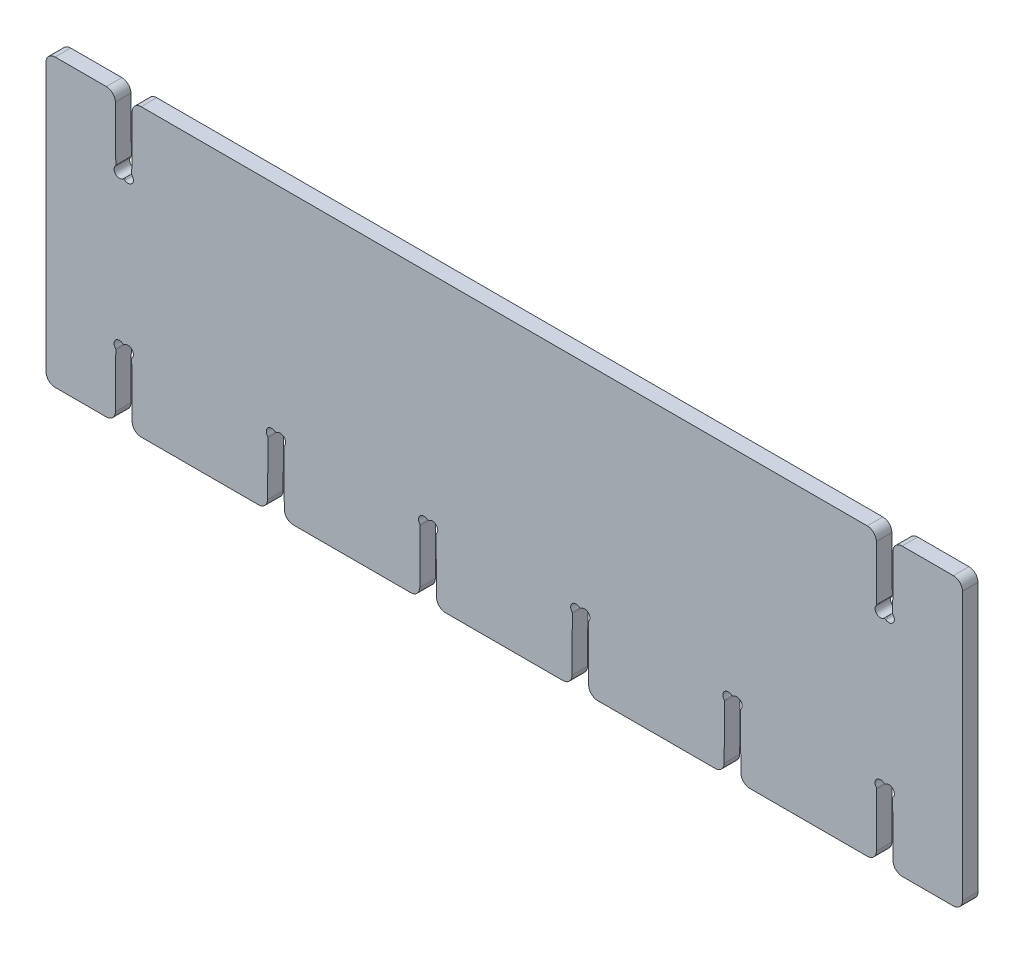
ISO-10303-21;
HEADER;
FILE_DESCRIPTION(('STEP AP214'),'2;1');
FILE_NAME('part.step','',(''),(''),'','','');
FILE_SCHEMA(('AUTOMOTIVE_DESIGN { 1 0 10303 214 1 1 1 1 }'));
ENDSEC;
DATA;
#1=APPLICATION_CONTEXT('core data for automotive mechanical design processes');
#2=APPLICATION_PROTOCOL_DEFINITION('international standard','automotive_design',2000,#1);
#3=PRODUCT_CONTEXT('',#1,'mechanical');
#4=PRODUCT('Part','Part','',(#3));
#5=PRODUCT_RELATED_PRODUCT_CATEGORY('part','',(#4));
#6=PRODUCT_DEFINITION_FORMATION('','',#4);
#7=PRODUCT_DEFINITION_CONTEXT('part definition',#1,'design');
#8=PRODUCT_DEFINITION('design','',#6,#7);
#9=PRODUCT_DEFINITION_SHAPE('','',#8);
#10=(LENGTH_UNIT() NAMED_UNIT(*) SI_UNIT(.MILLI.,.METRE.));
#11=(NAMED_UNIT(*) PLANE_ANGLE_UNIT() SI_UNIT($,.RADIAN.));
#12=(NAMED_UNIT(*) SI_UNIT($,.STERADIAN.) SOLID_ANGLE_UNIT());
#13=UNCERTAINTY_MEASURE_WITH_UNIT(LENGTH_MEASURE(1.E-05),#10,'distance_accuracy_value','');
#14=(GEOMETRIC_REPRESENTATION_CONTEXT(3) GLOBAL_UNCERTAINTY_ASSIGNED_CONTEXT((#13)) GLOBAL_UNIT_ASSIGNED_CONTEXT((#10,
#11,#12)) REPRESENTATION_CONTEXT('',''));
#15=CARTESIAN_POINT('',(0.,0.,0.));
#16=DIRECTION('',(0.,0.,1.));
#17=DIRECTION('',(1.,0.,0.));
#18=AXIS2_PLACEMENT_3D('',#15,#16,#17);
#19=CARTESIAN_POINT('',(0.,0.,12.));
#20=DIRECTION('',(0.,1.,0.));
#21=DIRECTION('',(0.,0.,1.));
#22=AXIS2_PLACEMENT_3D('',#19,#20,#21);
#23=PLANE('',#22);
#24=DIRECTION('',(1.,0.,0.));
#25=VECTOR('',#24,1.);
#26=CARTESIAN_POINT('',(0.,0.,12.));
#27=LINE('',#26,#25);
#28=CARTESIAN_POINT('',(190.89390358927,0.,12.));
#29=VERTEX_POINT('',#28);
#30=CARTESIAN_POINT('',(281.439429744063,0.,12.));
#31=VERTEX_POINT('',#30);
#32=EDGE_CURVE('E1369',#29,#31,#27,.T.);
#33=ORIENTED_EDGE('',*,*,#32,.F.);
#34=DIRECTION('',(0.,0.,1.));
#35=VECTOR('',#34,1.);
#36=CARTESIAN_POINT('',(190.89390358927,0.,12.));
#37=LINE('',#36,#35);
#38=CARTESIAN_POINT('',(190.89390358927,0.,0.));
#39=VERTEX_POINT('',#38);
#40=EDGE_CURVE('E1433',#29,#39,#37,.F.);
#41=ORIENTED_EDGE('',*,*,#40,.T.);
#42=DIRECTION('',(1.,0.,0.));
#43=VECTOR('',#42,1.);
#44=CARTESIAN_POINT('',(0.,0.,0.));
#45=LINE('',#44,#43);
#46=CARTESIAN_POINT('',(281.439429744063,0.,0.));
#47=VERTEX_POINT('',#46);
#48=EDGE_CURVE('E1499',#39,#47,#45,.T.);
#49=ORIENTED_EDGE('',*,*,#48,.T.);
#50=DIRECTION('',(0.,0.,1.));
#51=VECTOR('',#50,1.);
#52=CARTESIAN_POINT('',(281.439429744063,0.,12.));
#53=LINE('',#52,#51);
#54=EDGE_CURVE('E1430',#47,#31,#53,.T.);
#55=ORIENTED_EDGE('',*,*,#54,.T.);
#56=EDGE_LOOP('',(#33,#41,#49,#55));
#57=FACE_BOUND('',#56,.T.);
#58=ADVANCED_FACE('F33',(#57),#23,.F.);
#59=CARTESIAN_POINT('',(73.4494591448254,0.,12.));
#60=VERTEX_POINT('',#59);
#61=CARTESIAN_POINT('',(163.994985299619,0.,12.));
#62=VERTEX_POINT('',#61);
#63=EDGE_CURVE('E1365',#60,#62,#27,.T.);
#64=ORIENTED_EDGE('',*,*,#63,.F.);
#65=DIRECTION('',(0.,0.,1.));
#66=VECTOR('',#65,1.);
#67=CARTESIAN_POINT('',(73.4494591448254,0.,12.));
#68=LINE('',#67,#66);
#69=CARTESIAN_POINT('',(73.4494591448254,0.,0.));
#70=VERTEX_POINT('',#69);
#71=EDGE_CURVE('E1441',#60,#70,#68,.F.);
#72=ORIENTED_EDGE('',*,*,#71,.T.);
#73=CARTESIAN_POINT('',(163.994985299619,0.,0.));
#74=VERTEX_POINT('',#73);
#75=EDGE_CURVE('E1382',#70,#74,#45,.T.);
#76=ORIENTED_EDGE('',*,*,#75,.T.);
#77=DIRECTION('',(0.,0.,1.));
#78=VECTOR('',#77,1.);
#79=CARTESIAN_POINT('',(163.994985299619,0.,12.));
#80=LINE('',#79,#78);
#81=EDGE_CURVE('E1438',#74,#62,#80,.T.);
#82=ORIENTED_EDGE('',*,*,#81,.T.);
#83=EDGE_LOOP('',(#64,#72,#76,#82));
#84=FACE_BOUND('',#83,.T.);
#85=ADVANCED_FACE('F1541',(#84),#23,.F.);
#86=CARTESIAN_POINT('',(0.,220.8,12.));
#87=DIRECTION('',(0.,-1.,0.));
#88=DIRECTION('',(0.,0.,-1.));
#89=AXIS2_PLACEMENT_3D('',#86,#87,#88);
#90=PLANE('',#89);
#91=DIRECTION('',(-1.,0.,0.));
#92=VECTOR('',#91,1.);
#93=CARTESIAN_POINT('',(0.,220.8,0.));
#94=LINE('',#93,#92);
#95=CARTESIAN_POINT('',(633.772763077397,220.8,0.));
#96=VERTEX_POINT('',#95);
#97=CARTESIAN_POINT('',(73.4494591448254,220.8,0.));
#98=VERTEX_POINT('',#97);
#99=EDGE_CURVE('E1364',#96,#98,#94,.T.);
#100=ORIENTED_EDGE('',*,*,#99,.T.);
#101=DIRECTION('',(0.,0.,1.));
#102=VECTOR('',#101,1.);
#103=CARTESIAN_POINT('',(73.4494591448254,220.8,12.));
#104=LINE('',#103,#102);
#105=CARTESIAN_POINT('',(73.4494591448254,220.8,12.));
#106=VERTEX_POINT('',#105);
#107=EDGE_CURVE('E1443',#98,#106,#104,.T.);
#108=ORIENTED_EDGE('',*,*,#107,.T.);
#109=DIRECTION('',(-1.,0.,0.));
#110=VECTOR('',#109,1.);
#111=CARTESIAN_POINT('',(0.,220.8,12.));
#112=LINE('',#111,#110);
#113=CARTESIAN_POINT('',(633.772763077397,220.8,12.));
#114=VERTEX_POINT('',#113);
#115=EDGE_CURVE('E1370',#114,#106,#112,.T.);
#116=ORIENTED_EDGE('',*,*,#115,.F.);
#117=DIRECTION('',(0.,0.,1.));
#118=VECTOR('',#117,1.);
#119=CARTESIAN_POINT('',(633.772763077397,220.8,12.));
#120=LINE('',#119,#118);
#121=EDGE_CURVE('E1062',#96,#114,#120,.T.);
#122=ORIENTED_EDGE('',*,*,#121,.F.);
#123=EDGE_LOOP('',(#100,#108,#116,#122));
#124=FACE_BOUND('',#123,.T.);
#125=ADVANCED_FACE('F1601',(#124),#90,.F.);
#126=CARTESIAN_POINT('',(46.5505408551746,220.8,0.));
#127=VERTEX_POINT('',#126);
#128=CARTESIAN_POINT('',(7.,220.8,0.));
#129=VERTEX_POINT('',#128);
#130=EDGE_CURVE('E1381',#127,#129,#94,.T.);
#131=ORIENTED_EDGE('',*,*,#130,.T.);
#132=DIRECTION('',(0.,0.,-1.));
#133=VECTOR('',#132,1.);
#134=CARTESIAN_POINT('',(7.,220.8,12.));
#135=LINE('',#134,#133);
#136=CARTESIAN_POINT('',(7.,220.8,12.));
#137=VERTEX_POINT('',#136);
#138=EDGE_CURVE('E1454',#129,#137,#135,.F.);
#139=ORIENTED_EDGE('',*,*,#138,.T.);
#140=CARTESIAN_POINT('',(46.5505408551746,220.8,12.));
#141=VERTEX_POINT('',#140);
#142=EDGE_CURVE('E1374',#141,#137,#112,.T.);
#143=ORIENTED_EDGE('',*,*,#142,.F.);
#144=DIRECTION('',(0.,0.,1.));
#145=VECTOR('',#144,1.);
#146=CARTESIAN_POINT('',(46.5505408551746,220.8,0.));
#147=LINE('',#146,#145);
#148=EDGE_CURVE('E1452',#141,#127,#147,.F.);
#149=ORIENTED_EDGE('',*,*,#148,.T.);
#150=EDGE_LOOP('',(#131,#139,#143,#149));
#151=FACE_BOUND('',#150,.T.);
#152=ADVANCED_FACE('F1621',(#151),#90,.F.);
#153=CARTESIAN_POINT('',(0.,0.,12.));
#154=DIRECTION('',(0.,0.,-1.));
#155=DIRECTION('',(-1.,0.,0.));
#156=AXIS2_PLACEMENT_3D('',#153,#154,#155);
#157=PLANE('',#156);
#158=DIRECTION('',(-0.00724618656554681,0.999973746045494,0.));
#159=VECTOR('',#158,1.);
#160=CARTESIAN_POINT('',(301.035947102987,48.705966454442,12.));
#161=LINE('',#160,#159);
#162=CARTESIAN_POINT('',(301.338531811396,6.94927669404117,12.));
#163=VERTEX_POINT('',#162);
#164=CARTESIAN_POINT('',(301.035947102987,48.705966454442,12.));
#165=VERTEX_POINT('',#164);
#166=EDGE_CURVE('E1089',#163,#165,#161,.T.);
#167=ORIENTED_EDGE('',*,*,#166,.F.);
#168=CARTESIAN_POINT('',(308.338348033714,7.,12.));
#169=DIRECTION('',(0.,0.,-1.));
#170=DIRECTION('',(-1.,0.,0.));
#171=AXIS2_PLACEMENT_3D('',#168,#169,#170);
#172=CIRCLE('',#171,7.);
#173=CARTESIAN_POINT('',(308.338348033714,0.,12.));
#174=VERTEX_POINT('',#173);
#175=EDGE_CURVE('E1404',#163,#174,#172,.F.);
#176=ORIENTED_EDGE('',*,*,#175,.T.);
#177=CARTESIAN_POINT('',(398.883874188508,0.,12.));
#178=VERTEX_POINT('',#177);
#179=EDGE_CURVE('E1363',#174,#178,#27,.T.);
#180=ORIENTED_EDGE('',*,*,#179,.T.);
#181=CARTESIAN_POINT('',(398.883874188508,7.,12.));
#182=DIRECTION('',(0.,0.,1.));
#183=DIRECTION('',(1.,0.,0.));
#184=AXIS2_PLACEMENT_3D('',#181,#182,#183);
#185=CIRCLE('',#184,7.);
#186=CARTESIAN_POINT('',(405.883690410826,6.94927669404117,12.));
#187=VERTEX_POINT('',#186);
#188=EDGE_CURVE('E1014',#187,#178,#185,.F.);
#189=ORIENTED_EDGE('',*,*,#188,.F.);
#190=DIRECTION('',(0.00724618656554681,0.999973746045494,0.));
#191=VECTOR('',#190,1.);
#192=CARTESIAN_POINT('',(406.186275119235,48.705966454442,12.));
#193=LINE('',#192,#191);
#194=CARTESIAN_POINT('',(406.186275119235,48.705966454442,12.));
#195=VERTEX_POINT('',#194);
#196=EDGE_CURVE('E721',#187,#195,#193,.T.);
#197=ORIENTED_EDGE('',*,*,#196,.T.);
#198=CARTESIAN_POINT('',(404.986306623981,48.7146618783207,12.));
#199=DIRECTION('',(0.,0.,1.));
#200=DIRECTION('',(-1.,0.,0.));
#201=AXIS2_PLACEMENT_3D('',#198,#199,#200);
#202=CIRCLE('',#201,1.2);
#203=CARTESIAN_POINT('',(405.895256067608,49.4981227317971,12.));
#204=VERTEX_POINT('',#203);
#205=EDGE_CURVE('E681',#195,#204,#202,.T.);
#206=ORIENTED_EDGE('',*,*,#205,.T.);
#207=CARTESIAN_POINT('',(409.000833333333,52.1749473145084,12.));
#208=DIRECTION('',(0.,0.,-1.));
#209=DIRECTION('',(1.,0.,0.));
#210=AXIS2_PLACEMENT_3D('',#207,#208,#209);
#211=CIRCLE('',#210,4.1);
#212=CARTESIAN_POINT('',(411.476175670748,55.4433842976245,12.));
#213=VERTEX_POINT('',#212);
#214=EDGE_CURVE('E724',#204,#213,#211,.T.);
#215=ORIENTED_EDGE('',*,*,#214,.T.);
#216=CARTESIAN_POINT('',(412.200666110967,56.4,12.));
#217=DIRECTION('',(0.,0.,1.));
#218=DIRECTION('',(1.,0.,0.));
#219=AXIS2_PLACEMENT_3D('',#216,#217,#218);
#220=CIRCLE('',#219,1.2);
#221=CARTESIAN_POINT('',(412.200666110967,55.2,12.));
#222=VERTEX_POINT('',#221);
#223=EDGE_CURVE('E727',#213,#222,#220,.T.);
#224=ORIENTED_EDGE('',*,*,#223,.T.);
#225=DIRECTION('',(1.,0.,0.));
#226=VECTOR('',#225,1.);
#227=CARTESIAN_POINT('',(412.4660005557,55.2,12.));
#228=LINE('',#227,#226);
#229=CARTESIAN_POINT('',(412.4660005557,55.2,12.));
#230=VERTEX_POINT('',#229);
#231=EDGE_CURVE('E730',#222,#230,#228,.T.);
#232=ORIENTED_EDGE('',*,*,#231,.T.);
#233=CARTESIAN_POINT('',(412.4660005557,56.4,12.));
#234=DIRECTION('',(0.,0.,1.));
#235=DIRECTION('',(-1.,0.,0.));
#236=AXIS2_PLACEMENT_3D('',#233,#234,#235);
#237=CIRCLE('',#236,1.2);
#238=CARTESIAN_POINT('',(413.190490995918,55.4433842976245,12.));
#239=VERTEX_POINT('',#238);
#240=EDGE_CURVE('E733',#230,#239,#237,.T.);
#241=ORIENTED_EDGE('',*,*,#240,.T.);
#242=CARTESIAN_POINT('',(415.665833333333,52.1749473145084,12.));
#243=DIRECTION('',(0.,0.,-1.));
#244=DIRECTION('',(-1.,0.,0.));
#245=AXIS2_PLACEMENT_3D('',#242,#243,#244);
#246=CIRCLE('',#245,4.1);
#247=CARTESIAN_POINT('',(418.771410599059,49.4981227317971,12.));
#248=VERTEX_POINT('',#247);
#249=EDGE_CURVE('E736',#239,#248,#246,.T.);
#250=ORIENTED_EDGE('',*,*,#249,.T.);
#251=CARTESIAN_POINT('',(419.680360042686,48.7146618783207,12.));
#252=DIRECTION('',(0.,0.,1.));
#253=DIRECTION('',(1.,0.,0.));
#254=AXIS2_PLACEMENT_3D('',#251,#252,#253);
#255=CIRCLE('',#254,1.19999999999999);
#256=CARTESIAN_POINT('',(418.480391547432,48.705966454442,12.));
#257=VERTEX_POINT('',#256);
#258=EDGE_CURVE('E739',#248,#257,#255,.T.);
#259=ORIENTED_EDGE('',*,*,#258,.T.);
#260=DIRECTION('',(0.00724618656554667,-0.999973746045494,0.));
#261=VECTOR('',#260,1.);
#262=CARTESIAN_POINT('',(418.480391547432,48.705966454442,12.));
#263=LINE('',#262,#261);
#264=CARTESIAN_POINT('',(418.78297625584,6.94927669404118,12.));
#265=VERTEX_POINT('',#264);
#266=EDGE_CURVE('E694',#257,#265,#263,.T.);
#267=ORIENTED_EDGE('',*,*,#266,.T.);
#268=CARTESIAN_POINT('',(425.782792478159,7.,12.));
#269=DIRECTION('',(0.,0.,1.));
#270=DIRECTION('',(1.,0.,0.));
#271=AXIS2_PLACEMENT_3D('',#268,#269,#270);
#272=CIRCLE('',#271,7.);
#273=CARTESIAN_POINT('',(425.782792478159,0.,12.));
#274=VERTEX_POINT('',#273);
#275=EDGE_CURVE('E999',#274,#265,#272,.F.);
#276=ORIENTED_EDGE('',*,*,#275,.F.);
#277=DIRECTION('',(-1.,0.,0.));
#278=VECTOR('',#277,1.);
#279=CARTESIAN_POINT('',(707.222222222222,0.,12.));
#280=LINE('',#279,#278);
#281=CARTESIAN_POINT('',(516.328318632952,0.,12.));
#282=VERTEX_POINT('',#281);
#283=EDGE_CURVE('E971',#282,#274,#280,.T.);
#284=ORIENTED_EDGE('',*,*,#283,.F.);
#285=CARTESIAN_POINT('',(516.328318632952,7.,12.));
#286=DIRECTION('',(0.,0.,1.));
#287=DIRECTION('',(1.,0.,0.));
#288=AXIS2_PLACEMENT_3D('',#285,#286,#287);
#289=CIRCLE('',#288,7.);
#290=CARTESIAN_POINT('',(523.328134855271,6.94927669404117,12.));
#291=VERTEX_POINT('',#290);
#292=EDGE_CURVE('E1012',#291,#282,#289,.F.);
#293=ORIENTED_EDGE('',*,*,#292,.F.);
#294=DIRECTION('',(0.00724618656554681,0.999973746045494,0.));
#295=VECTOR('',#294,1.);
#296=CARTESIAN_POINT('',(523.63071956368,48.705966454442,12.));
#297=LINE('',#296,#295);
#298=CARTESIAN_POINT('',(523.63071956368,48.705966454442,12.));
#299=VERTEX_POINT('',#298);
#300=EDGE_CURVE('E746',#291,#299,#297,.T.);
#301=ORIENTED_EDGE('',*,*,#300,.T.);
#302=CARTESIAN_POINT('',(522.430751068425,48.7146618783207,12.));
#303=DIRECTION('',(0.,0.,1.));
#304=DIRECTION('',(-1.,0.,0.));
#305=AXIS2_PLACEMENT_3D('',#302,#303,#304);
#306=CIRCLE('',#305,1.2);
#307=CARTESIAN_POINT('',(523.339700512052,49.4981227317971,12.));
#308=VERTEX_POINT('',#307);
#309=EDGE_CURVE('E789',#299,#308,#306,.T.);
#310=ORIENTED_EDGE('',*,*,#309,.T.);
#311=CARTESIAN_POINT('',(526.445277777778,52.1749473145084,12.));
#312=DIRECTION('',(0.,0.,-1.));
#313=DIRECTION('',(1.,0.,0.));
#314=AXIS2_PLACEMENT_3D('',#311,#312,#313);
#315=CIRCLE('',#314,4.1);
#316=CARTESIAN_POINT('',(528.920620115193,55.4433842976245,12.));
#317=VERTEX_POINT('',#316);
#318=EDGE_CURVE('E792',#308,#317,#315,.T.);
#319=ORIENTED_EDGE('',*,*,#318,.T.);
#320=CARTESIAN_POINT('',(529.645110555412,56.4,12.));
#321=DIRECTION('',(0.,0.,1.));
#322=DIRECTION('',(1.,0.,0.));
#323=AXIS2_PLACEMENT_3D('',#320,#321,#322);
#324=CIRCLE('',#323,1.2);
#325=CARTESIAN_POINT('',(529.645110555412,55.2,12.));
#326=VERTEX_POINT('',#325);
#327=EDGE_CURVE('E795',#317,#326,#324,.T.);
#328=ORIENTED_EDGE('',*,*,#327,.T.);
#329=DIRECTION('',(1.,0.,0.));
#330=VECTOR('',#329,1.);
#331=CARTESIAN_POINT('',(529.910445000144,55.2,12.));
#332=LINE('',#331,#330);
#333=CARTESIAN_POINT('',(529.910445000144,55.2,12.));
#334=VERTEX_POINT('',#333);
#335=EDGE_CURVE('E798',#326,#334,#332,.T.);
#336=ORIENTED_EDGE('',*,*,#335,.T.);
#337=CARTESIAN_POINT('',(529.910445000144,56.4,12.));
#338=DIRECTION('',(0.,0.,1.));
#339=DIRECTION('',(-1.,0.,0.));
#340=AXIS2_PLACEMENT_3D('',#337,#338,#339);
#341=CIRCLE('',#340,1.2);
#342=CARTESIAN_POINT('',(530.634935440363,55.4433842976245,12.));
#343=VERTEX_POINT('',#342);
#344=EDGE_CURVE('E801',#334,#343,#341,.T.);
#345=ORIENTED_EDGE('',*,*,#344,.T.);
#346=CARTESIAN_POINT('',(533.110277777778,52.1749473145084,12.));
#347=DIRECTION('',(0.,0.,-1.));
#348=DIRECTION('',(-1.,0.,0.));
#349=AXIS2_PLACEMENT_3D('',#346,#347,#348);
#350=CIRCLE('',#349,4.1);
#351=CARTESIAN_POINT('',(536.215855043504,49.4981227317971,12.));
#352=VERTEX_POINT('',#351);
#353=EDGE_CURVE('E804',#343,#352,#350,.T.);
#354=ORIENTED_EDGE('',*,*,#353,.T.);
#355=CARTESIAN_POINT('',(537.124804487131,48.7146618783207,12.));
#356=DIRECTION('',(0.,0.,1.));
#357=DIRECTION('',(1.,0.,0.));
#358=AXIS2_PLACEMENT_3D('',#355,#356,#357);
#359=CIRCLE('',#358,1.19999999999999);
#360=CARTESIAN_POINT('',(535.924835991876,48.705966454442,12.));
#361=VERTEX_POINT('',#360);
#362=EDGE_CURVE('E807',#352,#361,#359,.T.);
#363=ORIENTED_EDGE('',*,*,#362,.T.);
#364=DIRECTION('',(0.00724618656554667,-0.999973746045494,0.));
#365=VECTOR('',#364,1.);
#366=CARTESIAN_POINT('',(535.924835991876,48.705966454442,12.));
#367=LINE('',#366,#365);
#368=CARTESIAN_POINT('',(536.227420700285,6.94927669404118,12.));
#369=VERTEX_POINT('',#368);
#370=EDGE_CURVE('E762',#361,#369,#367,.T.);
#371=ORIENTED_EDGE('',*,*,#370,.T.);
#372=CARTESIAN_POINT('',(543.227236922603,7.,12.));
#373=DIRECTION('',(0.,0.,1.));
#374=DIRECTION('',(1.,0.,0.));
#375=AXIS2_PLACEMENT_3D('',#372,#373,#374);
#376=CIRCLE('',#375,7.);
#377=CARTESIAN_POINT('',(543.227236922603,0.,12.));
#378=VERTEX_POINT('',#377);
#379=EDGE_CURVE('E996',#378,#369,#376,.F.);
#380=ORIENTED_EDGE('',*,*,#379,.F.);
#381=CARTESIAN_POINT('',(633.772763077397,0.,12.));
#382=VERTEX_POINT('',#381);
#383=EDGE_CURVE('E973',#382,#378,#280,.T.);
#384=ORIENTED_EDGE('',*,*,#383,.F.);
#385=CARTESIAN_POINT('',(633.772763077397,7.,12.));
#386=DIRECTION('',(0.,0.,1.));
#387=DIRECTION('',(1.,0.,0.));
#388=AXIS2_PLACEMENT_3D('',#385,#386,#387);
#389=CIRCLE('',#388,7.);
#390=CARTESIAN_POINT('',(640.772579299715,6.94927669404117,12.));
#391=VERTEX_POINT('',#390);
#392=EDGE_CURVE('E1010',#391,#382,#389,.F.);
#393=ORIENTED_EDGE('',*,*,#392,.F.);
#394=DIRECTION('',(0.00724618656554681,0.999973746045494,0.));
#395=VECTOR('',#394,1.);
#396=CARTESIAN_POINT('',(641.075164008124,48.705966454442,12.));
#397=LINE('',#396,#395);
#398=CARTESIAN_POINT('',(641.075164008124,48.705966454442,12.));
#399=VERTEX_POINT('',#398);
#400=EDGE_CURVE('E884',#391,#399,#397,.T.);
#401=ORIENTED_EDGE('',*,*,#400,.T.);
#402=CARTESIAN_POINT('',(639.875195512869,48.7146618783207,12.));
#403=DIRECTION('',(0.,0.,1.));
#404=DIRECTION('',(-1.,0.,0.));
#405=AXIS2_PLACEMENT_3D('',#402,#403,#404);
#406=CIRCLE('',#405,1.2);
#407=CARTESIAN_POINT('',(640.784144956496,49.4981227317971,12.));
#408=VERTEX_POINT('',#407);
#409=EDGE_CURVE('E929',#399,#408,#406,.T.);
#410=ORIENTED_EDGE('',*,*,#409,.T.);
#411=CARTESIAN_POINT('',(643.889722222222,52.1749473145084,12.));
#412=DIRECTION('',(0.,0.,-1.));
#413=DIRECTION('',(1.,0.,0.));
#414=AXIS2_PLACEMENT_3D('',#411,#412,#413);
#415=CIRCLE('',#414,4.1);
#416=CARTESIAN_POINT('',(646.365064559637,55.4433842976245,12.));
#417=VERTEX_POINT('',#416);
#418=EDGE_CURVE('E932',#408,#417,#415,.T.);
#419=ORIENTED_EDGE('',*,*,#418,.T.);
#420=CARTESIAN_POINT('',(647.089554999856,56.4,12.));
#421=DIRECTION('',(0.,0.,1.));
#422=DIRECTION('',(1.,0.,0.));
#423=AXIS2_PLACEMENT_3D('',#420,#421,#422);
#424=CIRCLE('',#423,1.2);
#425=CARTESIAN_POINT('',(647.089554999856,55.2,12.));
#426=VERTEX_POINT('',#425);
#427=EDGE_CURVE('E935',#417,#426,#424,.T.);
#428=ORIENTED_EDGE('',*,*,#427,.T.);
#429=DIRECTION('',(1.,0.,0.));
#430=VECTOR('',#429,1.);
#431=CARTESIAN_POINT('',(647.354889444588,55.2,12.));
#432=LINE('',#431,#430);
#433=CARTESIAN_POINT('',(647.354889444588,55.2,12.));
#434=VERTEX_POINT('',#433);
#435=EDGE_CURVE('E938',#426,#434,#432,.T.);
#436=ORIENTED_EDGE('',*,*,#435,.T.);
#437=CARTESIAN_POINT('',(647.354889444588,56.4,12.));
#438=DIRECTION('',(0.,0.,1.));
#439=DIRECTION('',(-1.,0.,0.));
#440=AXIS2_PLACEMENT_3D('',#437,#438,#439);
#441=CIRCLE('',#440,1.2);
#442=CARTESIAN_POINT('',(648.079379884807,55.4433842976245,12.));
#443=VERTEX_POINT('',#442);
#444=EDGE_CURVE('E941',#434,#443,#441,.T.);
#445=ORIENTED_EDGE('',*,*,#444,.T.);
#446=CARTESIAN_POINT('',(650.554722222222,52.1749473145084,12.));
#447=DIRECTION('',(0.,0.,-1.));
#448=DIRECTION('',(-1.,0.,0.));
#449=AXIS2_PLACEMENT_3D('',#446,#447,#448);
#450=CIRCLE('',#449,4.1);
#451=CARTESIAN_POINT('',(653.660299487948,49.4981227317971,12.));
#452=VERTEX_POINT('',#451);
#453=EDGE_CURVE('E944',#443,#452,#450,.T.);
#454=ORIENTED_EDGE('',*,*,#453,.T.);
#455=CARTESIAN_POINT('',(654.569248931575,48.7146618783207,12.));
#456=DIRECTION('',(0.,0.,1.));
#457=DIRECTION('',(1.,0.,0.));
#458=AXIS2_PLACEMENT_3D('',#455,#456,#457);
#459=CIRCLE('',#458,1.19999999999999);
#460=CARTESIAN_POINT('',(653.36928043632,48.705966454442,12.));
#461=VERTEX_POINT('',#460);
#462=EDGE_CURVE('E947',#452,#461,#459,.T.);
#463=ORIENTED_EDGE('',*,*,#462,.T.);
#464=DIRECTION('',(0.00724618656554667,-0.999973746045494,0.));
#465=VECTOR('',#464,1.);
#466=CARTESIAN_POINT('',(653.36928043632,48.705966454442,12.));
#467=LINE('',#466,#465);
#468=CARTESIAN_POINT('',(653.671865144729,6.94927669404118,12.));
#469=VERTEX_POINT('',#468);
#470=EDGE_CURVE('E902',#461,#469,#467,.T.);
#471=ORIENTED_EDGE('',*,*,#470,.T.);
#472=CARTESIAN_POINT('',(660.671681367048,7.,12.));
#473=DIRECTION('',(0.,0.,1.));
#474=DIRECTION('',(1.,0.,0.));
#475=AXIS2_PLACEMENT_3D('',#472,#473,#474);
#476=CIRCLE('',#475,7.);
#477=CARTESIAN_POINT('',(660.671681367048,0.,12.));
#478=VERTEX_POINT('',#477);
#479=EDGE_CURVE('E993',#478,#469,#476,.F.);
#480=ORIENTED_EDGE('',*,*,#479,.F.);
#481=CARTESIAN_POINT('',(700.222222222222,0.,12.));
#482=VERTEX_POINT('',#481);
#483=EDGE_CURVE('E976',#482,#478,#280,.T.);
#484=ORIENTED_EDGE('',*,*,#483,.F.);
#485=CARTESIAN_POINT('',(700.222222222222,7.,12.));
#486=DIRECTION('',(0.,0.,1.));
#487=DIRECTION('',(1.,0.,0.));
#488=AXIS2_PLACEMENT_3D('',#485,#486,#487);
#489=CIRCLE('',#488,7.);
#490=CARTESIAN_POINT('',(707.222222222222,7.,12.));
#491=VERTEX_POINT('',#490);
#492=EDGE_CURVE('E990',#491,#482,#489,.F.);
#493=ORIENTED_EDGE('',*,*,#492,.F.);
#494=DIRECTION('',(0.,-1.,0.));
#495=VECTOR('',#494,1.);
#496=CARTESIAN_POINT('',(707.222222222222,0.,12.));
#497=LINE('',#496,#495);
#498=CARTESIAN_POINT('',(707.222222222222,213.8,12.));
#499=VERTEX_POINT('',#498);
#500=EDGE_CURVE('E968',#499,#491,#497,.T.);
#501=ORIENTED_EDGE('',*,*,#500,.F.);
#502=CARTESIAN_POINT('',(700.222222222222,213.8,12.));
#503=DIRECTION('',(0.,0.,1.));
#504=DIRECTION('',(1.,0.,0.));
#505=AXIS2_PLACEMENT_3D('',#502,#503,#504);
#506=CIRCLE('',#505,7.);
#507=CARTESIAN_POINT('',(700.222222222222,220.8,12.));
#508=VERTEX_POINT('',#507);
#509=EDGE_CURVE('E1004',#508,#499,#506,.F.);
#510=ORIENTED_EDGE('',*,*,#509,.F.);
#511=DIRECTION('',(1.,0.,0.));
#512=VECTOR('',#511,1.);
#513=CARTESIAN_POINT('',(707.222222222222,220.8,12.));
#514=LINE('',#513,#512);
#515=CARTESIAN_POINT('',(660.671681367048,220.8,12.));
#516=VERTEX_POINT('',#515);
#517=EDGE_CURVE('E977',#516,#508,#514,.T.);
#518=ORIENTED_EDGE('',*,*,#517,.F.);
#519=CARTESIAN_POINT('',(660.671681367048,213.8,12.));
#520=DIRECTION('',(0.,0.,1.));
#521=DIRECTION('',(1.,0.,0.));
#522=AXIS2_PLACEMENT_3D('',#519,#520,#521);
#523=CIRCLE('',#522,7.);
#524=CARTESIAN_POINT('',(653.671865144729,213.850723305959,12.));
#525=VERTEX_POINT('',#524);
#526=EDGE_CURVE('E1002',#525,#516,#523,.F.);
#527=ORIENTED_EDGE('',*,*,#526,.F.);
#528=DIRECTION('',(0.00724618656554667,0.999973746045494,0.));
#529=VECTOR('',#528,1.);
#530=CARTESIAN_POINT('',(653.36928043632,172.094033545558,12.));
#531=LINE('',#530,#529);
#532=CARTESIAN_POINT('',(653.36928043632,172.094033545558,12.));
#533=VERTEX_POINT('',#532);
#534=EDGE_CURVE('E814',#533,#525,#531,.T.);
#535=ORIENTED_EDGE('',*,*,#534,.F.);
#536=CARTESIAN_POINT('',(654.569248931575,172.085338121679,12.));
#537=DIRECTION('',(0.,0.,-1.));
#538=DIRECTION('',(1.,0.,0.));
#539=AXIS2_PLACEMENT_3D('',#536,#537,#538);
#540=CIRCLE('',#539,1.19999999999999);
#541=CARTESIAN_POINT('',(653.660299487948,171.301877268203,12.));
#542=VERTEX_POINT('',#541);
#543=EDGE_CURVE('E859',#542,#533,#540,.T.);
#544=ORIENTED_EDGE('',*,*,#543,.F.);
#545=CARTESIAN_POINT('',(650.554722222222,168.625052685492,12.));
#546=DIRECTION('',(0.,0.,1.));
#547=DIRECTION('',(-1.,0.,0.));
#548=AXIS2_PLACEMENT_3D('',#545,#546,#547);
#549=CIRCLE('',#548,4.1);
#550=CARTESIAN_POINT('',(648.079379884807,165.356615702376,12.));
#551=VERTEX_POINT('',#550);
#552=EDGE_CURVE('E862',#551,#542,#549,.T.);
#553=ORIENTED_EDGE('',*,*,#552,.F.);
#554=CARTESIAN_POINT('',(647.354889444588,164.4,12.));
#555=DIRECTION('',(0.,0.,-1.));
#556=DIRECTION('',(-1.,0.,0.));
#557=AXIS2_PLACEMENT_3D('',#554,#555,#556);
#558=CIRCLE('',#557,1.2);
#559=CARTESIAN_POINT('',(647.354889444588,165.6,12.));
#560=VERTEX_POINT('',#559);
#561=EDGE_CURVE('E865',#560,#551,#558,.T.);
#562=ORIENTED_EDGE('',*,*,#561,.F.);
#563=DIRECTION('',(1.,0.,0.));
#564=VECTOR('',#563,1.);
#565=CARTESIAN_POINT('',(647.354889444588,165.6,12.));
#566=LINE('',#565,#564);
#567=CARTESIAN_POINT('',(647.089554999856,165.6,12.));
#568=VERTEX_POINT('',#567);
#569=EDGE_CURVE('E868',#568,#560,#566,.T.);
#570=ORIENTED_EDGE('',*,*,#569,.F.);
#571=CARTESIAN_POINT('',(647.089554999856,164.4,12.));
#572=DIRECTION('',(0.,0.,-1.));
#573=DIRECTION('',(1.,0.,0.));
#574=AXIS2_PLACEMENT_3D('',#571,#572,#573);
#575=CIRCLE('',#574,1.2);
#576=CARTESIAN_POINT('',(646.365064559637,165.356615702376,12.));
#577=VERTEX_POINT('',#576);
#578=EDGE_CURVE('E871',#577,#568,#575,.T.);
#579=ORIENTED_EDGE('',*,*,#578,.F.);
#580=CARTESIAN_POINT('',(643.889722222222,168.625052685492,12.));
#581=DIRECTION('',(0.,0.,1.));
#582=DIRECTION('',(1.,0.,0.));
#583=AXIS2_PLACEMENT_3D('',#580,#581,#582);
#584=CIRCLE('',#583,4.1);
#585=CARTESIAN_POINT('',(640.784144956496,171.301877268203,12.));
#586=VERTEX_POINT('',#585);
#587=EDGE_CURVE('E874',#586,#577,#584,.T.);
#588=ORIENTED_EDGE('',*,*,#587,.F.);
#589=CARTESIAN_POINT('',(639.875195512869,172.085338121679,12.));
#590=DIRECTION('',(0.,0.,-1.));
#591=DIRECTION('',(-1.,0.,0.));
#592=AXIS2_PLACEMENT_3D('',#589,#590,#591);
#593=CIRCLE('',#592,1.2);
#594=CARTESIAN_POINT('',(641.075164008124,172.094033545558,12.));
#595=VERTEX_POINT('',#594);
#596=EDGE_CURVE('E877',#595,#586,#593,.T.);
#597=ORIENTED_EDGE('',*,*,#596,.F.);
#598=DIRECTION('',(0.00724618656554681,-0.999973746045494,0.));
#599=VECTOR('',#598,1.);
#600=CARTESIAN_POINT('',(641.075164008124,172.094033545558,12.));
#601=LINE('',#600,#599);
#602=CARTESIAN_POINT('',(640.772579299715,213.850723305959,12.));
#603=VERTEX_POINT('',#602);
#604=EDGE_CURVE('E832',#603,#595,#601,.T.);
#605=ORIENTED_EDGE('',*,*,#604,.F.);
#606=CARTESIAN_POINT('',(633.772763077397,213.8,12.));
#607=DIRECTION('',(0.,0.,1.));
#608=DIRECTION('',(1.,0.,0.));
#609=AXIS2_PLACEMENT_3D('',#606,#607,#608);
#610=CIRCLE('',#609,7.);
#611=EDGE_CURVE('E1007',#114,#603,#610,.F.);
#612=ORIENTED_EDGE('',*,*,#611,.F.);
#613=ORIENTED_EDGE('',*,*,#115,.T.);
#614=CARTESIAN_POINT('',(73.4494591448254,213.8,12.));
#615=DIRECTION('',(0.,0.,-1.));
#616=DIRECTION('',(-1.,0.,0.));
#617=AXIS2_PLACEMENT_3D('',#614,#615,#616);
#618=CIRCLE('',#617,7.);
#619=CARTESIAN_POINT('',(66.449642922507,213.850723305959,12.));
#620=VERTEX_POINT('',#619);
#621=EDGE_CURVE('E1398',#106,#620,#618,.F.);
#622=ORIENTED_EDGE('',*,*,#621,.T.);
#623=DIRECTION('',(-0.00724618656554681,-0.999973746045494,0.));
#624=VECTOR('',#623,1.);
#625=CARTESIAN_POINT('',(66.1470582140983,172.094033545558,12.));
#626=LINE('',#625,#624);
#627=CARTESIAN_POINT('',(66.1470582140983,172.094033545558,12.));
#628=VERTEX_POINT('',#627);
#629=EDGE_CURVE('E1232',#620,#628,#626,.T.);
#630=ORIENTED_EDGE('',*,*,#629,.T.);
#631=CARTESIAN_POINT('',(67.3470267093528,172.085338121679,12.));
#632=DIRECTION('',(0.,0.,1.));
#633=DIRECTION('',(1.,0.,0.));
#634=AXIS2_PLACEMENT_3D('',#631,#632,#633);
#635=CIRCLE('',#634,1.2);
#636=CARTESIAN_POINT('',(66.4380772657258,171.301877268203,12.));
#637=VERTEX_POINT('',#636);
#638=EDGE_CURVE('E1270',#628,#637,#635,.T.);
#639=ORIENTED_EDGE('',*,*,#638,.T.);
#640=CARTESIAN_POINT('',(63.3325,168.625052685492,12.));
#641=DIRECTION('',(0.,0.,-1.));
#642=DIRECTION('',(-1.,0.,0.));
#643=AXIS2_PLACEMENT_3D('',#640,#641,#642);
#644=CIRCLE('',#643,4.1);
#645=CARTESIAN_POINT('',(60.8571576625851,165.356615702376,12.));
#646=VERTEX_POINT('',#645);
#647=EDGE_CURVE('E1267',#637,#646,#644,.T.);
#648=ORIENTED_EDGE('',*,*,#647,.T.);
#649=CARTESIAN_POINT('',(60.1326672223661,164.4,12.));
#650=DIRECTION('',(0.,0.,1.));
#651=DIRECTION('',(-1.,0.,0.));
#652=AXIS2_PLACEMENT_3D('',#649,#650,#651);
#653=CIRCLE('',#652,1.2);
#654=CARTESIAN_POINT('',(60.1326672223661,165.6,12.));
#655=VERTEX_POINT('',#654);
#656=EDGE_CURVE('E1264',#646,#655,#653,.T.);
#657=ORIENTED_EDGE('',*,*,#656,.T.);
#658=DIRECTION('',(-1.,0.,0.));
#659=VECTOR('',#658,1.);
#660=CARTESIAN_POINT('',(59.8673327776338,165.6,12.));
#661=LINE('',#660,#659);
#662=CARTESIAN_POINT('',(59.8673327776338,165.6,12.));
#663=VERTEX_POINT('',#662);
#664=EDGE_CURVE('E1261',#655,#663,#661,.T.);
#665=ORIENTED_EDGE('',*,*,#664,.T.);
#666=CARTESIAN_POINT('',(59.8673327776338,164.4,12.));
#667=DIRECTION('',(0.,0.,1.));
#668=DIRECTION('',(1.,0.,0.));
#669=AXIS2_PLACEMENT_3D('',#666,#667,#668);
#670=CIRCLE('',#669,1.2);
#671=CARTESIAN_POINT('',(59.1428423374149,165.356615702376,12.));
#672=VERTEX_POINT('',#671);
#673=EDGE_CURVE('E1258',#663,#672,#670,.T.);
#674=ORIENTED_EDGE('',*,*,#673,.T.);
#675=CARTESIAN_POINT('',(56.6675,168.625052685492,12.));
#676=DIRECTION('',(0.,0.,-1.));
#677=DIRECTION('',(1.,0.,0.));
#678=AXIS2_PLACEMENT_3D('',#675,#676,#677);
#679=CIRCLE('',#678,4.1);
#680=CARTESIAN_POINT('',(53.5619227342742,171.301877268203,12.));
#681=VERTEX_POINT('',#680);
#682=EDGE_CURVE('E1255',#672,#681,#679,.T.);
#683=ORIENTED_EDGE('',*,*,#682,.T.);
#684=CARTESIAN_POINT('',(52.6529732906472,172.085338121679,12.));
#685=DIRECTION('',(0.,0.,1.));
#686=DIRECTION('',(-1.,0.,0.));
#687=AXIS2_PLACEMENT_3D('',#684,#685,#686);
#688=CIRCLE('',#687,1.19999999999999);
#689=CARTESIAN_POINT('',(53.8529417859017,172.094033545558,12.));
#690=VERTEX_POINT('',#689);
#691=EDGE_CURVE('E1252',#681,#690,#688,.T.);
#692=ORIENTED_EDGE('',*,*,#691,.T.);
#693=DIRECTION('',(-0.00724618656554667,0.999973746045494,0.));
#694=VECTOR('',#693,1.);
#695=CARTESIAN_POINT('',(53.8529417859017,172.094033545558,12.));
#696=LINE('',#695,#694);
#697=CARTESIAN_POINT('',(53.5503570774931,213.850723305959,12.));
#698=VERTEX_POINT('',#697);
#699=EDGE_CURVE('E1213',#690,#698,#696,.T.);
#700=ORIENTED_EDGE('',*,*,#699,.T.);
#701=CARTESIAN_POINT('',(46.5505408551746,213.8,12.));
#702=DIRECTION('',(0.,0.,-1.));
#703=DIRECTION('',(-1.,0.,0.));
#704=AXIS2_PLACEMENT_3D('',#701,#702,#703);
#705=CIRCLE('',#704,7.);
#706=EDGE_CURVE('E1394',#698,#141,#705,.F.);
#707=ORIENTED_EDGE('',*,*,#706,.T.);
#708=ORIENTED_EDGE('',*,*,#142,.T.);
#709=CARTESIAN_POINT('',(7.,213.8,12.));
#710=DIRECTION('',(0.,0.,-1.));
#711=DIRECTION('',(-1.,0.,0.));
#712=AXIS2_PLACEMENT_3D('',#709,#710,#711);
#713=CIRCLE('',#712,7.);
#714=CARTESIAN_POINT('',(0.,213.8,12.));
#715=VERTEX_POINT('',#714);
#716=EDGE_CURVE('E1396',#137,#715,#713,.F.);
#717=ORIENTED_EDGE('',*,*,#716,.T.);
#718=DIRECTION('',(0.,-1.,0.));
#719=VECTOR('',#718,1.);
#720=CARTESIAN_POINT('',(0.,0.,12.));
#721=LINE('',#720,#719);
#722=CARTESIAN_POINT('',(0.,7.,12.));
#723=VERTEX_POINT('',#722);
#724=EDGE_CURVE('E1360',#715,#723,#721,.T.);
#725=ORIENTED_EDGE('',*,*,#724,.T.);
#726=CARTESIAN_POINT('',(7.,7.,12.));
#727=DIRECTION('',(0.,0.,-1.));
#728=DIRECTION('',(-1.,0.,0.));
#729=AXIS2_PLACEMENT_3D('',#726,#727,#728);
#730=CIRCLE('',#729,7.);
#731=CARTESIAN_POINT('',(7.,0.,12.));
#732=VERTEX_POINT('',#731);
#733=EDGE_CURVE('E1386',#723,#732,#730,.F.);
#734=ORIENTED_EDGE('',*,*,#733,.T.);
#735=CARTESIAN_POINT('',(46.5505408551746,0.,12.));
#736=VERTEX_POINT('',#735);
#737=EDGE_CURVE('E1368',#732,#736,#27,.T.);
#738=ORIENTED_EDGE('',*,*,#737,.T.);
#739=CARTESIAN_POINT('',(46.5505408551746,7.,12.));
#740=DIRECTION('',(0.,0.,-1.));
#741=DIRECTION('',(-1.,0.,0.));
#742=AXIS2_PLACEMENT_3D('',#739,#740,#741);
#743=CIRCLE('',#742,7.);
#744=CARTESIAN_POINT('',(53.5503570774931,6.94927669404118,12.));
#745=VERTEX_POINT('',#744);
#746=EDGE_CURVE('E1388',#736,#745,#743,.F.);
#747=ORIENTED_EDGE('',*,*,#746,.T.);
#748=DIRECTION('',(-0.00724618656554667,-0.999973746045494,0.));
#749=VECTOR('',#748,1.);
#750=CARTESIAN_POINT('',(53.8529417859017,48.705966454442,12.));
#751=LINE('',#750,#749);
#752=CARTESIAN_POINT('',(53.8529417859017,48.705966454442,12.));
#753=VERTEX_POINT('',#752);
#754=EDGE_CURVE('E1294',#753,#745,#751,.T.);
#755=ORIENTED_EDGE('',*,*,#754,.F.);
#756=CARTESIAN_POINT('',(52.6529732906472,48.7146618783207,12.));
#757=DIRECTION('',(0.,0.,-1.));
#758=DIRECTION('',(-1.,0.,0.));
#759=AXIS2_PLACEMENT_3D('',#756,#757,#758);
#760=CIRCLE('',#759,1.19999999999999);
#761=CARTESIAN_POINT('',(53.5619227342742,49.4981227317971,12.));
#762=VERTEX_POINT('',#761);
#763=EDGE_CURVE('E1338',#762,#753,#760,.T.);
#764=ORIENTED_EDGE('',*,*,#763,.F.);
#765=CARTESIAN_POINT('',(56.6675,52.1749473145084,12.));
#766=DIRECTION('',(0.,0.,1.));
#767=DIRECTION('',(1.,0.,0.));
#768=AXIS2_PLACEMENT_3D('',#765,#766,#767);
#769=CIRCLE('',#768,4.1);
#770=CARTESIAN_POINT('',(59.1428423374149,55.4433842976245,12.));
#771=VERTEX_POINT('',#770);
#772=EDGE_CURVE('E1335',#771,#762,#769,.T.);
#773=ORIENTED_EDGE('',*,*,#772,.F.);
#774=CARTESIAN_POINT('',(59.8673327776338,56.4,12.));
#775=DIRECTION('',(0.,0.,-1.));
#776=DIRECTION('',(1.,0.,0.));
#777=AXIS2_PLACEMENT_3D('',#774,#775,#776);
#778=CIRCLE('',#777,1.2);
#779=CARTESIAN_POINT('',(59.8673327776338,55.2,12.));
#780=VERTEX_POINT('',#779);
#781=EDGE_CURVE('E1332',#780,#771,#778,.T.);
#782=ORIENTED_EDGE('',*,*,#781,.F.);
#783=DIRECTION('',(-1.,0.,0.));
#784=VECTOR('',#783,1.);
#785=CARTESIAN_POINT('',(59.8673327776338,55.2,12.));
#786=LINE('',#785,#784);
#787=CARTESIAN_POINT('',(60.1326672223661,55.2,12.));
#788=VERTEX_POINT('',#787);
#789=EDGE_CURVE('E1329',#788,#780,#786,.T.);
#790=ORIENTED_EDGE('',*,*,#789,.F.);
#791=CARTESIAN_POINT('',(60.1326672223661,56.4,12.));
#792=DIRECTION('',(0.,0.,-1.));
#793=DIRECTION('',(-1.,0.,0.));
#794=AXIS2_PLACEMENT_3D('',#791,#792,#793);
#795=CIRCLE('',#794,1.2);
#796=CARTESIAN_POINT('',(60.8571576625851,55.4433842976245,12.));
#797=VERTEX_POINT('',#796);
#798=EDGE_CURVE('E1326',#797,#788,#795,.T.);
#799=ORIENTED_EDGE('',*,*,#798,.F.);
#800=CARTESIAN_POINT('',(63.3325,52.1749473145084,12.));
#801=DIRECTION('',(0.,0.,1.));
#802=DIRECTION('',(-1.,0.,0.));
#803=AXIS2_PLACEMENT_3D('',#800,#801,#802);
#804=CIRCLE('',#803,4.1);
#805=CARTESIAN_POINT('',(66.4380772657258,49.4981227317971,12.));
#806=VERTEX_POINT('',#805);
#807=EDGE_CURVE('E1323',#806,#797,#804,.T.);
#808=ORIENTED_EDGE('',*,*,#807,.F.);
#809=CARTESIAN_POINT('',(67.3470267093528,48.7146618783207,12.));
#810=DIRECTION('',(0.,0.,-1.));
#811=DIRECTION('',(1.,0.,0.));
#812=AXIS2_PLACEMENT_3D('',#809,#810,#811);
#813=CIRCLE('',#812,1.2);
#814=CARTESIAN_POINT('',(66.1470582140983,48.705966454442,12.));
#815=VERTEX_POINT('',#814);
#816=EDGE_CURVE('E1320',#815,#806,#813,.T.);
#817=ORIENTED_EDGE('',*,*,#816,.F.);
#818=DIRECTION('',(-0.00724618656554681,0.999973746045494,0.));
#819=VECTOR('',#818,1.);
#820=CARTESIAN_POINT('',(66.1470582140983,48.705966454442,12.));
#821=LINE('',#820,#819);
#822=CARTESIAN_POINT('',(66.449642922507,6.94927669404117,12.));
#823=VERTEX_POINT('',#822);
#824=EDGE_CURVE('E1277',#823,#815,#821,.T.);
#825=ORIENTED_EDGE('',*,*,#824,.F.);
#826=CARTESIAN_POINT('',(73.4494591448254,7.,12.));
#827=DIRECTION('',(0.,0.,-1.));
#828=DIRECTION('',(-1.,0.,0.));
#829=AXIS2_PLACEMENT_3D('',#826,#827,#828);
#830=CIRCLE('',#829,7.);
#831=EDGE_CURVE('E1400',#823,#60,#830,.F.);
#832=ORIENTED_EDGE('',*,*,#831,.T.);
#833=ORIENTED_EDGE('',*,*,#63,.T.);
#834=CARTESIAN_POINT('',(163.994985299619,7.,12.));
#835=DIRECTION('',(0.,0.,-1.));
#836=DIRECTION('',(-1.,0.,0.));
#837=AXIS2_PLACEMENT_3D('',#834,#835,#836);
#838=CIRCLE('',#837,7.);
#839=CARTESIAN_POINT('',(170.994801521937,6.94927669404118,12.));
#840=VERTEX_POINT('',#839);
#841=EDGE_CURVE('E1390',#62,#840,#838,.F.);
#842=ORIENTED_EDGE('',*,*,#841,.T.);
#843=DIRECTION('',(-0.00724618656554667,-0.999973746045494,0.));
#844=VECTOR('',#843,1.);
#845=CARTESIAN_POINT('',(171.297386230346,48.705966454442,12.));
#846=LINE('',#845,#844);
#847=CARTESIAN_POINT('',(171.297386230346,48.705966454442,12.));
#848=VERTEX_POINT('',#847);
#849=EDGE_CURVE('E1162',#848,#840,#846,.T.);
#850=ORIENTED_EDGE('',*,*,#849,.F.);
#851=CARTESIAN_POINT('',(170.097417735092,48.7146618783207,12.));
#852=DIRECTION('',(0.,0.,-1.));
#853=DIRECTION('',(-1.,0.,0.));
#854=AXIS2_PLACEMENT_3D('',#851,#852,#853);
#855=CIRCLE('',#854,1.19999999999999);
#856=CARTESIAN_POINT('',(171.006367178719,49.4981227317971,12.));
#857=VERTEX_POINT('',#856);
#858=EDGE_CURVE('E1206',#857,#848,#855,.T.);
#859=ORIENTED_EDGE('',*,*,#858,.F.);
#860=CARTESIAN_POINT('',(174.111944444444,52.1749473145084,12.));
#861=DIRECTION('',(0.,0.,1.));
#862=DIRECTION('',(1.,0.,0.));
#863=AXIS2_PLACEMENT_3D('',#860,#861,#862);
#864=CIRCLE('',#863,4.1);
#865=CARTESIAN_POINT('',(176.587286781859,55.4433842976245,12.));
#866=VERTEX_POINT('',#865);
#867=EDGE_CURVE('E1203',#866,#857,#864,.T.);
#868=ORIENTED_EDGE('',*,*,#867,.F.);
#869=CARTESIAN_POINT('',(177.311777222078,56.4,12.));
#870=DIRECTION('',(0.,0.,-1.));
#871=DIRECTION('',(1.,0.,0.));
#872=AXIS2_PLACEMENT_3D('',#869,#870,#871);
#873=CIRCLE('',#872,1.2);
#874=CARTESIAN_POINT('',(177.311777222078,55.2,12.));
#875=VERTEX_POINT('',#874);
#876=EDGE_CURVE('E1200',#875,#866,#873,.T.);
#877=ORIENTED_EDGE('',*,*,#876,.F.);
#878=DIRECTION('',(-1.,0.,0.));
#879=VECTOR('',#878,1.);
#880=CARTESIAN_POINT('',(177.311777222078,55.2,12.));
#881=LINE('',#880,#879);
#882=CARTESIAN_POINT('',(177.577111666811,55.2,12.));
#883=VERTEX_POINT('',#882);
#884=EDGE_CURVE('E1197',#883,#875,#881,.T.);
#885=ORIENTED_EDGE('',*,*,#884,.F.);
#886=CARTESIAN_POINT('',(177.577111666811,56.4,12.));
#887=DIRECTION('',(0.,0.,-1.));
#888=DIRECTION('',(-1.,0.,0.));
#889=AXIS2_PLACEMENT_3D('',#886,#887,#888);
#890=CIRCLE('',#889,1.2);
#891=CARTESIAN_POINT('',(178.30160210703,55.4433842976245,12.));
#892=VERTEX_POINT('',#891);
#893=EDGE_CURVE('E1194',#892,#883,#890,.T.);
#894=ORIENTED_EDGE('',*,*,#893,.F.);
#895=CARTESIAN_POINT('',(180.776944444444,52.1749473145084,12.));
#896=DIRECTION('',(0.,0.,1.));
#897=DIRECTION('',(-1.,0.,0.));
#898=AXIS2_PLACEMENT_3D('',#895,#896,#897);
#899=CIRCLE('',#898,4.1);
#900=CARTESIAN_POINT('',(183.88252171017,49.4981227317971,12.));
#901=VERTEX_POINT('',#900);
#902=EDGE_CURVE('E1191',#901,#892,#899,.T.);
#903=ORIENTED_EDGE('',*,*,#902,.F.);
#904=CARTESIAN_POINT('',(184.791471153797,48.7146618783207,12.));
#905=DIRECTION('',(0.,0.,-1.));
#906=DIRECTION('',(1.,0.,0.));
#907=AXIS2_PLACEMENT_3D('',#904,#905,#906);
#908=CIRCLE('',#907,1.2);
#909=CARTESIAN_POINT('',(183.591502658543,48.705966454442,12.));
#910=VERTEX_POINT('',#909);
#911=EDGE_CURVE('E1188',#910,#901,#908,.T.);
#912=ORIENTED_EDGE('',*,*,#911,.F.);
#913=DIRECTION('',(-0.00724618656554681,0.999973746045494,0.));
#914=VECTOR('',#913,1.);
#915=CARTESIAN_POINT('',(183.591502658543,48.705966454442,12.));
#916=LINE('',#915,#914);
#917=CARTESIAN_POINT('',(183.894087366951,6.94927669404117,12.));
#918=VERTEX_POINT('',#917);
#919=EDGE_CURVE('E1144',#918,#910,#916,.T.);
#920=ORIENTED_EDGE('',*,*,#919,.F.);
#921=CARTESIAN_POINT('',(190.89390358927,7.,12.));
#922=DIRECTION('',(0.,0.,-1.));
#923=DIRECTION('',(-1.,0.,0.));
#924=AXIS2_PLACEMENT_3D('',#921,#922,#923);
#925=CIRCLE('',#924,7.);
#926=EDGE_CURVE('E1402',#918,#29,#925,.F.);
#927=ORIENTED_EDGE('',*,*,#926,.T.);
#928=ORIENTED_EDGE('',*,*,#32,.T.);
#929=CARTESIAN_POINT('',(281.439429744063,7.,12.));
#930=DIRECTION('',(0.,0.,-1.));
#931=DIRECTION('',(-1.,0.,0.));
#932=AXIS2_PLACEMENT_3D('',#929,#930,#931);
#933=CIRCLE('',#932,7.);
#934=CARTESIAN_POINT('',(288.439245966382,6.94927669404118,12.));
#935=VERTEX_POINT('',#934);
#936=EDGE_CURVE('E1392',#31,#935,#933,.F.);
#937=ORIENTED_EDGE('',*,*,#936,.T.);
#938=DIRECTION('',(-0.00724618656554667,-0.999973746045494,0.));
#939=VECTOR('',#938,1.);
#940=CARTESIAN_POINT('',(288.741830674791,48.705966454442,12.));
#941=LINE('',#940,#939);
#942=CARTESIAN_POINT('',(288.741830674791,48.705966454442,12.));
#943=VERTEX_POINT('',#942);
#944=EDGE_CURVE('E1093',#943,#935,#941,.T.);
#945=ORIENTED_EDGE('',*,*,#944,.F.);
#946=CARTESIAN_POINT('',(287.541862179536,48.7146618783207,12.));
#947=DIRECTION('',(0.,0.,-1.));
#948=DIRECTION('',(-1.,0.,0.));
#949=AXIS2_PLACEMENT_3D('',#946,#947,#948);
#950=CIRCLE('',#949,1.19999999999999);
#951=CARTESIAN_POINT('',(288.450811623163,49.4981227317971,12.));
#952=VERTEX_POINT('',#951);
#953=EDGE_CURVE('E1137',#952,#943,#950,.T.);
#954=ORIENTED_EDGE('',*,*,#953,.F.);
#955=CARTESIAN_POINT('',(291.556388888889,52.1749473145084,12.));
#956=DIRECTION('',(0.,0.,1.));
#957=DIRECTION('',(1.,0.,0.));
#958=AXIS2_PLACEMENT_3D('',#955,#956,#957);
#959=CIRCLE('',#958,4.1);
#960=CARTESIAN_POINT('',(294.031731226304,55.4433842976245,12.));
#961=VERTEX_POINT('',#960);
#962=EDGE_CURVE('E1134',#961,#952,#959,.T.);
#963=ORIENTED_EDGE('',*,*,#962,.F.);
#964=CARTESIAN_POINT('',(294.756221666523,56.4,12.));
#965=DIRECTION('',(0.,0.,-1.));
#966=DIRECTION('',(1.,0.,0.));
#967=AXIS2_PLACEMENT_3D('',#964,#965,#966);
#968=CIRCLE('',#967,1.2);
#969=CARTESIAN_POINT('',(294.756221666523,55.2,12.));
#970=VERTEX_POINT('',#969);
#971=EDGE_CURVE('E1131',#970,#961,#968,.T.);
#972=ORIENTED_EDGE('',*,*,#971,.F.);
#973=DIRECTION('',(-1.,0.,0.));
#974=VECTOR('',#973,1.);
#975=CARTESIAN_POINT('',(294.756221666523,55.2,12.));
#976=LINE('',#975,#974);
#977=CARTESIAN_POINT('',(295.021556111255,55.2,12.));
#978=VERTEX_POINT('',#977);
#979=EDGE_CURVE('E1128',#978,#970,#976,.T.);
#980=ORIENTED_EDGE('',*,*,#979,.F.);
#981=CARTESIAN_POINT('',(295.021556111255,56.4,12.));
#982=DIRECTION('',(0.,0.,-1.));
#983=DIRECTION('',(-1.,0.,0.));
#984=AXIS2_PLACEMENT_3D('',#981,#982,#983);
#985=CIRCLE('',#984,1.2);
#986=CARTESIAN_POINT('',(295.746046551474,55.4433842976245,12.));
#987=VERTEX_POINT('',#986);
#988=EDGE_CURVE('E1125',#987,#978,#985,.T.);
#989=ORIENTED_EDGE('',*,*,#988,.F.);
#990=CARTESIAN_POINT('',(298.221388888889,52.1749473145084,12.));
#991=DIRECTION('',(0.,0.,1.));
#992=DIRECTION('',(-1.,0.,0.));
#993=AXIS2_PLACEMENT_3D('',#990,#991,#992);
#994=CIRCLE('',#993,4.1);
#995=CARTESIAN_POINT('',(301.326966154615,49.4981227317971,12.));
#996=VERTEX_POINT('',#995);
#997=EDGE_CURVE('E1122',#996,#987,#994,.T.);
#998=ORIENTED_EDGE('',*,*,#997,.F.);
#999=CARTESIAN_POINT('',(302.235915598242,48.7146618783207,12.));
#1000=DIRECTION('',(0.,0.,-1.));
#1001=DIRECTION('',(1.,0.,0.));
#1002=AXIS2_PLACEMENT_3D('',#999,#1000,#1001);
#1003=CIRCLE('',#1002,1.2);
#1004=EDGE_CURVE('E1119',#165,#996,#1003,.T.);
#1005=ORIENTED_EDGE('',*,*,#1004,.F.);
#1006=EDGE_LOOP('',(#167,#176,#180,#189,#197,#206,#215,#224,#232,#241,#250,#259,#267,#276,#284,
#293,#301,#310,#319,#328,#336,#345,#354,#363,#371,#380,#384,#393,#401,#410,#419,#428,#436,#445,
#454,#463,#471,#480,#484,#493,#501,#510,#518,#527,#535,#544,#553,#562,#570,#579,#588,#597,#605,
#612,#613,#622,#630,#639,#648,#657,#665,#674,#683,#692,#700,#707,#708,#717,#725,#734,#738,#747,
#755,#764,#773,#782,#790,#799,#808,#817,#825,#832,#833,#842,#850,#859,#868,#877,#885,#894,#903,
#912,#920,#927,#928,#937,#945,#954,#963,#972,#980,#989,#998,#1005));
#1007=FACE_BOUND('',#1006,.T.);
#1008=ADVANCED_FACE('F1477',(#1007),#157,.F.);
#1009=CARTESIAN_POINT('',(0.,0.,0.));
#1010=DIRECTION('',(0.,0.,-1.));
#1011=DIRECTION('',(-1.,0.,0.));
#1012=AXIS2_PLACEMENT_3D('',#1009,#1010,#1011);
#1013=PLANE('',#1012);
#1014=CARTESIAN_POINT('',(308.338348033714,0.,0.));
#1015=VERTEX_POINT('',#1014);
#1016=CARTESIAN_POINT('',(398.883874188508,0.,0.));
#1017=VERTEX_POINT('',#1016);
#1018=EDGE_CURVE('E1377',#1015,#1017,#45,.T.);
#1019=ORIENTED_EDGE('',*,*,#1018,.F.);
#1020=CARTESIAN_POINT('',(308.338348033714,7.,0.));
#1021=DIRECTION('',(0.,0.,-1.));
#1022=DIRECTION('',(-1.,0.,0.));
#1023=AXIS2_PLACEMENT_3D('',#1020,#1021,#1022);
#1024=CIRCLE('',#1023,7.);
#1025=CARTESIAN_POINT('',(301.338531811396,6.94927669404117,0.));
#1026=VERTEX_POINT('',#1025);
#1027=EDGE_CURVE('E1425',#1015,#1026,#1024,.T.);
#1028=ORIENTED_EDGE('',*,*,#1027,.T.);
#1029=DIRECTION('',(-0.00724618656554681,0.999973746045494,0.));
#1030=VECTOR('',#1029,1.);
#1031=CARTESIAN_POINT('',(301.035947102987,48.705966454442,0.));
#1032=LINE('',#1031,#1030);
#1033=CARTESIAN_POINT('',(301.035947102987,48.705966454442,0.));
#1034=VERTEX_POINT('',#1033);
#1035=EDGE_CURVE('E1090',#1026,#1034,#1032,.T.);
#1036=ORIENTED_EDGE('',*,*,#1035,.T.);
#1037=CARTESIAN_POINT('',(302.235915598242,48.7146618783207,0.));
#1038=DIRECTION('',(0.,0.,-1.));
#1039=DIRECTION('',(1.,0.,0.));
#1040=AXIS2_PLACEMENT_3D('',#1037,#1038,#1039);
#1041=CIRCLE('',#1040,1.2);
#1042=CARTESIAN_POINT('',(301.326966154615,49.4981227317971,0.));
#1043=VERTEX_POINT('',#1042);
#1044=EDGE_CURVE('E1092',#1034,#1043,#1041,.T.);
#1045=ORIENTED_EDGE('',*,*,#1044,.T.);
#1046=CARTESIAN_POINT('',(298.221388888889,52.1749473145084,0.));
#1047=DIRECTION('',(0.,0.,1.));
#1048=DIRECTION('',(-1.,0.,0.));
#1049=AXIS2_PLACEMENT_3D('',#1046,#1047,#1048);
#1050=CIRCLE('',#1049,4.1);
#1051=CARTESIAN_POINT('',(295.746046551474,55.4433842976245,0.));
#1052=VERTEX_POINT('',#1051);
#1053=EDGE_CURVE('E1096',#1043,#1052,#1050,.T.);
#1054=ORIENTED_EDGE('',*,*,#1053,.T.);
#1055=CARTESIAN_POINT('',(295.021556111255,56.4,0.));
#1056=DIRECTION('',(0.,0.,-1.));
#1057=DIRECTION('',(-1.,0.,0.));
#1058=AXIS2_PLACEMENT_3D('',#1055,#1056,#1057);
#1059=CIRCLE('',#1058,1.2);
#1060=CARTESIAN_POINT('',(295.021556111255,55.2,0.));
#1061=VERTEX_POINT('',#1060);
#1062=EDGE_CURVE('E1099',#1052,#1061,#1059,.T.);
#1063=ORIENTED_EDGE('',*,*,#1062,.T.);
#1064=DIRECTION('',(-1.,0.,0.));
#1065=VECTOR('',#1064,1.);
#1066=CARTESIAN_POINT('',(294.756221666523,55.2,0.));
#1067=LINE('',#1066,#1065);
#1068=CARTESIAN_POINT('',(294.756221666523,55.2,0.));
#1069=VERTEX_POINT('',#1068);
#1070=EDGE_CURVE('E1102',#1061,#1069,#1067,.T.);
#1071=ORIENTED_EDGE('',*,*,#1070,.T.);
#1072=CARTESIAN_POINT('',(294.756221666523,56.4,0.));
#1073=DIRECTION('',(0.,0.,-1.));
#1074=DIRECTION('',(1.,0.,0.));
#1075=AXIS2_PLACEMENT_3D('',#1072,#1073,#1074);
#1076=CIRCLE('',#1075,1.2);
#1077=CARTESIAN_POINT('',(294.031731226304,55.4433842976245,0.));
#1078=VERTEX_POINT('',#1077);
#1079=EDGE_CURVE('E1105',#1069,#1078,#1076,.T.);
#1080=ORIENTED_EDGE('',*,*,#1079,.T.);
#1081=CARTESIAN_POINT('',(291.556388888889,52.1749473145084,0.));
#1082=DIRECTION('',(0.,0.,1.));
#1083=DIRECTION('',(1.,0.,0.));
#1084=AXIS2_PLACEMENT_3D('',#1081,#1082,#1083);
#1085=CIRCLE('',#1084,4.1);
#1086=CARTESIAN_POINT('',(288.450811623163,49.4981227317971,0.));
#1087=VERTEX_POINT('',#1086);
#1088=EDGE_CURVE('E1108',#1078,#1087,#1085,.T.);
#1089=ORIENTED_EDGE('',*,*,#1088,.T.);
#1090=CARTESIAN_POINT('',(287.541862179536,48.7146618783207,0.));
#1091=DIRECTION('',(0.,0.,-1.));
#1092=DIRECTION('',(-1.,0.,0.));
#1093=AXIS2_PLACEMENT_3D('',#1090,#1091,#1092);
#1094=CIRCLE('',#1093,1.19999999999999);
#1095=CARTESIAN_POINT('',(288.741830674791,48.705966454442,0.));
#1096=VERTEX_POINT('',#1095);
#1097=EDGE_CURVE('E1111',#1087,#1096,#1094,.T.);
#1098=ORIENTED_EDGE('',*,*,#1097,.T.);
#1099=DIRECTION('',(-0.00724618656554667,-0.999973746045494,0.));
#1100=VECTOR('',#1099,1.);
#1101=CARTESIAN_POINT('',(288.741830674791,48.705966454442,0.));
#1102=LINE('',#1101,#1100);
#1103=CARTESIAN_POINT('',(288.439245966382,6.94927669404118,0.));
#1104=VERTEX_POINT('',#1103);
#1105=EDGE_CURVE('E1114',#1096,#1104,#1102,.T.);
#1106=ORIENTED_EDGE('',*,*,#1105,.T.);
#1107=CARTESIAN_POINT('',(281.439429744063,7.,0.));
#1108=DIRECTION('',(0.,0.,-1.));
#1109=DIRECTION('',(-1.,0.,0.));
#1110=AXIS2_PLACEMENT_3D('',#1107,#1108,#1109);
#1111=CIRCLE('',#1110,7.);
#1112=EDGE_CURVE('E1414',#1104,#47,#1111,.T.);
#1113=ORIENTED_EDGE('',*,*,#1112,.T.);
#1114=ORIENTED_EDGE('',*,*,#48,.F.);
#1115=CARTESIAN_POINT('',(190.89390358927,7.,0.));
#1116=DIRECTION('',(0.,0.,-1.));
#1117=DIRECTION('',(-1.,0.,0.));
#1118=AXIS2_PLACEMENT_3D('',#1115,#1116,#1117);
#1119=CIRCLE('',#1118,7.);
#1120=CARTESIAN_POINT('',(183.894087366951,6.94927669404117,0.));
#1121=VERTEX_POINT('',#1120);
#1122=EDGE_CURVE('E1423',#39,#1121,#1119,.T.);
#1123=ORIENTED_EDGE('',*,*,#1122,.T.);
#1124=DIRECTION('',(-0.00724618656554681,0.999973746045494,0.));
#1125=VECTOR('',#1124,1.);
#1126=CARTESIAN_POINT('',(183.591502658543,48.705966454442,0.));
#1127=LINE('',#1126,#1125);
#1128=CARTESIAN_POINT('',(183.591502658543,48.705966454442,0.));
#1129=VERTEX_POINT('',#1128);
#1130=EDGE_CURVE('E1159',#1121,#1129,#1127,.T.);
#1131=ORIENTED_EDGE('',*,*,#1130,.T.);
#1132=CARTESIAN_POINT('',(184.791471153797,48.7146618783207,0.));
#1133=DIRECTION('',(0.,0.,-1.));
#1134=DIRECTION('',(1.,0.,0.));
#1135=AXIS2_PLACEMENT_3D('',#1132,#1133,#1134);
#1136=CIRCLE('',#1135,1.2);
#1137=CARTESIAN_POINT('',(183.88252171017,49.4981227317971,0.));
#1138=VERTEX_POINT('',#1137);
#1139=EDGE_CURVE('E1161',#1129,#1138,#1136,.T.);
#1140=ORIENTED_EDGE('',*,*,#1139,.T.);
#1141=CARTESIAN_POINT('',(180.776944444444,52.1749473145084,0.));
#1142=DIRECTION('',(0.,0.,1.));
#1143=DIRECTION('',(-1.,0.,0.));
#1144=AXIS2_PLACEMENT_3D('',#1141,#1142,#1143);
#1145=CIRCLE('',#1144,4.1);
#1146=CARTESIAN_POINT('',(178.30160210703,55.4433842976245,0.));
#1147=VERTEX_POINT('',#1146);
#1148=EDGE_CURVE('E1165',#1138,#1147,#1145,.T.);
#1149=ORIENTED_EDGE('',*,*,#1148,.T.);
#1150=CARTESIAN_POINT('',(177.577111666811,56.4,0.));
#1151=DIRECTION('',(0.,0.,-1.));
#1152=DIRECTION('',(-1.,0.,0.));
#1153=AXIS2_PLACEMENT_3D('',#1150,#1151,#1152);
#1154=CIRCLE('',#1153,1.2);
#1155=CARTESIAN_POINT('',(177.577111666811,55.2,0.));
#1156=VERTEX_POINT('',#1155);
#1157=EDGE_CURVE('E1168',#1147,#1156,#1154,.T.);
#1158=ORIENTED_EDGE('',*,*,#1157,.T.);
#1159=DIRECTION('',(-1.,0.,0.));
#1160=VECTOR('',#1159,1.);
#1161=CARTESIAN_POINT('',(177.311777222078,55.2,0.));
#1162=LINE('',#1161,#1160);
#1163=CARTESIAN_POINT('',(177.311777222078,55.2,0.));
#1164=VERTEX_POINT('',#1163);
#1165=EDGE_CURVE('E1171',#1156,#1164,#1162,.T.);
#1166=ORIENTED_EDGE('',*,*,#1165,.T.);
#1167=CARTESIAN_POINT('',(177.311777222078,56.4,0.));
#1168=DIRECTION('',(0.,0.,-1.));
#1169=DIRECTION('',(1.,0.,0.));
#1170=AXIS2_PLACEMENT_3D('',#1167,#1168,#1169);
#1171=CIRCLE('',#1170,1.2);
#1172=CARTESIAN_POINT('',(176.587286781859,55.4433842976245,0.));
#1173=VERTEX_POINT('',#1172);
#1174=EDGE_CURVE('E1174',#1164,#1173,#1171,.T.);
#1175=ORIENTED_EDGE('',*,*,#1174,.T.);
#1176=CARTESIAN_POINT('',(174.111944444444,52.1749473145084,0.));
#1177=DIRECTION('',(0.,0.,1.));
#1178=DIRECTION('',(1.,0.,0.));
#1179=AXIS2_PLACEMENT_3D('',#1176,#1177,#1178);
#1180=CIRCLE('',#1179,4.1);
#1181=CARTESIAN_POINT('',(171.006367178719,49.4981227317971,0.));
#1182=VERTEX_POINT('',#1181);
#1183=EDGE_CURVE('E1177',#1173,#1182,#1180,.T.);
#1184=ORIENTED_EDGE('',*,*,#1183,.T.);
#1185=CARTESIAN_POINT('',(170.097417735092,48.7146618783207,0.));
#1186=DIRECTION('',(0.,0.,-1.));
#1187=DIRECTION('',(-1.,0.,0.));
#1188=AXIS2_PLACEMENT_3D('',#1185,#1186,#1187);
#1189=CIRCLE('',#1188,1.19999999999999);
#1190=CARTESIAN_POINT('',(171.297386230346,48.705966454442,0.));
#1191=VERTEX_POINT('',#1190);
#1192=EDGE_CURVE('E1180',#1182,#1191,#1189,.T.);
#1193=ORIENTED_EDGE('',*,*,#1192,.T.);
#1194=DIRECTION('',(-0.00724618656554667,-0.999973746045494,0.));
#1195=VECTOR('',#1194,1.);
#1196=CARTESIAN_POINT('',(171.297386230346,48.705966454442,0.));
#1197=LINE('',#1196,#1195);
#1198=CARTESIAN_POINT('',(170.994801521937,6.94927669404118,0.));
#1199=VERTEX_POINT('',#1198);
#1200=EDGE_CURVE('E1183',#1191,#1199,#1197,.T.);
#1201=ORIENTED_EDGE('',*,*,#1200,.T.);
#1202=CARTESIAN_POINT('',(163.994985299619,7.,0.));
#1203=DIRECTION('',(0.,0.,-1.));
#1204=DIRECTION('',(-1.,0.,0.));
#1205=AXIS2_PLACEMENT_3D('',#1202,#1203,#1204);
#1206=CIRCLE('',#1205,7.);
#1207=EDGE_CURVE('E1412',#1199,#74,#1206,.T.);
#1208=ORIENTED_EDGE('',*,*,#1207,.T.);
#1209=ORIENTED_EDGE('',*,*,#75,.F.);
#1210=CARTESIAN_POINT('',(73.4494591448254,7.,0.));
#1211=DIRECTION('',(0.,0.,-1.));
#1212=DIRECTION('',(-1.,0.,0.));
#1213=AXIS2_PLACEMENT_3D('',#1210,#1211,#1212);
#1214=CIRCLE('',#1213,7.);
#1215=CARTESIAN_POINT('',(66.449642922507,6.94927669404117,0.));
#1216=VERTEX_POINT('',#1215);
#1217=EDGE_CURVE('E1421',#70,#1216,#1214,.T.);
#1218=ORIENTED_EDGE('',*,*,#1217,.T.);
#1219=DIRECTION('',(-0.00724618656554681,0.999973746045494,0.));
#1220=VECTOR('',#1219,1.);
#1221=CARTESIAN_POINT('',(66.1470582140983,48.705966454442,0.));
#1222=LINE('',#1221,#1220);
#1223=CARTESIAN_POINT('',(66.1470582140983,48.705966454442,0.));
#1224=VERTEX_POINT('',#1223);
#1225=EDGE_CURVE('E1291',#1216,#1224,#1222,.T.);
#1226=ORIENTED_EDGE('',*,*,#1225,.T.);
#1227=CARTESIAN_POINT('',(67.3470267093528,48.7146618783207,0.));
#1228=DIRECTION('',(0.,0.,-1.));
#1229=DIRECTION('',(1.,0.,0.));
#1230=AXIS2_PLACEMENT_3D('',#1227,#1228,#1229);
#1231=CIRCLE('',#1230,1.2);
#1232=CARTESIAN_POINT('',(66.4380772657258,49.4981227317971,0.));
#1233=VERTEX_POINT('',#1232);
#1234=EDGE_CURVE('E1293',#1224,#1233,#1231,.T.);
#1235=ORIENTED_EDGE('',*,*,#1234,.T.);
#1236=CARTESIAN_POINT('',(63.3325,52.1749473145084,0.));
#1237=DIRECTION('',(0.,0.,1.));
#1238=DIRECTION('',(-1.,0.,0.));
#1239=AXIS2_PLACEMENT_3D('',#1236,#1237,#1238);
#1240=CIRCLE('',#1239,4.1);
#1241=CARTESIAN_POINT('',(60.8571576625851,55.4433842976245,0.));
#1242=VERTEX_POINT('',#1241);
#1243=EDGE_CURVE('E1297',#1233,#1242,#1240,.T.);
#1244=ORIENTED_EDGE('',*,*,#1243,.T.);
#1245=CARTESIAN_POINT('',(60.1326672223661,56.4,0.));
#1246=DIRECTION('',(0.,0.,-1.));
#1247=DIRECTION('',(-1.,0.,0.));
#1248=AXIS2_PLACEMENT_3D('',#1245,#1246,#1247);
#1249=CIRCLE('',#1248,1.2);
#1250=CARTESIAN_POINT('',(60.1326672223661,55.2,0.));
#1251=VERTEX_POINT('',#1250);
#1252=EDGE_CURVE('E1300',#1242,#1251,#1249,.T.);
#1253=ORIENTED_EDGE('',*,*,#1252,.T.);
#1254=DIRECTION('',(-1.,0.,0.));
#1255=VECTOR('',#1254,1.);
#1256=CARTESIAN_POINT('',(59.8673327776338,55.2,0.));
#1257=LINE('',#1256,#1255);
#1258=CARTESIAN_POINT('',(59.8673327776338,55.2,0.));
#1259=VERTEX_POINT('',#1258);
#1260=EDGE_CURVE('E1303',#1251,#1259,#1257,.T.);
#1261=ORIENTED_EDGE('',*,*,#1260,.T.);
#1262=CARTESIAN_POINT('',(59.8673327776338,56.4,0.));
#1263=DIRECTION('',(0.,0.,-1.));
#1264=DIRECTION('',(1.,0.,0.));
#1265=AXIS2_PLACEMENT_3D('',#1262,#1263,#1264);
#1266=CIRCLE('',#1265,1.2);
#1267=CARTESIAN_POINT('',(59.1428423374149,55.4433842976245,0.));
#1268=VERTEX_POINT('',#1267);
#1269=EDGE_CURVE('E1306',#1259,#1268,#1266,.T.);
#1270=ORIENTED_EDGE('',*,*,#1269,.T.);
#1271=CARTESIAN_POINT('',(56.6675,52.1749473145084,0.));
#1272=DIRECTION('',(0.,0.,1.));
#1273=DIRECTION('',(1.,0.,0.));
#1274=AXIS2_PLACEMENT_3D('',#1271,#1272,#1273);
#1275=CIRCLE('',#1274,4.1);
#1276=CARTESIAN_POINT('',(53.5619227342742,49.4981227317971,0.));
#1277=VERTEX_POINT('',#1276);
#1278=EDGE_CURVE('E1309',#1268,#1277,#1275,.T.);
#1279=ORIENTED_EDGE('',*,*,#1278,.T.);
#1280=CARTESIAN_POINT('',(52.6529732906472,48.7146618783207,0.));
#1281=DIRECTION('',(0.,0.,-1.));
#1282=DIRECTION('',(-1.,0.,0.));
#1283=AXIS2_PLACEMENT_3D('',#1280,#1281,#1282);
#1284=CIRCLE('',#1283,1.19999999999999);
#1285=CARTESIAN_POINT('',(53.8529417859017,48.705966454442,0.));
#1286=VERTEX_POINT('',#1285);
#1287=EDGE_CURVE('E1312',#1277,#1286,#1284,.T.);
#1288=ORIENTED_EDGE('',*,*,#1287,.T.);
#1289=DIRECTION('',(-0.00724618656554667,-0.999973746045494,0.));
#1290=VECTOR('',#1289,1.);
#1291=CARTESIAN_POINT('',(53.8529417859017,48.705966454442,0.));
#1292=LINE('',#1291,#1290);
#1293=CARTESIAN_POINT('',(53.5503570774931,6.94927669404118,0.));
#1294=VERTEX_POINT('',#1293);
#1295=EDGE_CURVE('E1315',#1286,#1294,#1292,.T.);
#1296=ORIENTED_EDGE('',*,*,#1295,.T.);
#1297=CARTESIAN_POINT('',(46.5505408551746,7.,0.));
#1298=DIRECTION('',(0.,0.,-1.));
#1299=DIRECTION('',(-1.,0.,0.));
#1300=AXIS2_PLACEMENT_3D('',#1297,#1298,#1299);
#1301=CIRCLE('',#1300,7.);
#1302=CARTESIAN_POINT('',(46.5505408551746,0.,0.));
#1303=VERTEX_POINT('',#1302);
#1304=EDGE_CURVE('E1410',#1294,#1303,#1301,.T.);
#1305=ORIENTED_EDGE('',*,*,#1304,.T.);
#1306=CARTESIAN_POINT('',(7.,0.,0.));
#1307=VERTEX_POINT('',#1306);
#1308=EDGE_CURVE('E1378',#1307,#1303,#45,.T.);
#1309=ORIENTED_EDGE('',*,*,#1308,.F.);
#1310=CARTESIAN_POINT('',(7.,7.,0.));
#1311=DIRECTION('',(0.,0.,-1.));
#1312=DIRECTION('',(-1.,0.,0.));
#1313=AXIS2_PLACEMENT_3D('',#1310,#1311,#1312);
#1314=CIRCLE('',#1313,7.);
#1315=CARTESIAN_POINT('',(0.,7.,0.));
#1316=VERTEX_POINT('',#1315);
#1317=EDGE_CURVE('E1408',#1307,#1316,#1314,.T.);
#1318=ORIENTED_EDGE('',*,*,#1317,.T.);
#1319=DIRECTION('',(0.,-1.,0.));
#1320=VECTOR('',#1319,1.);
#1321=CARTESIAN_POINT('',(0.,0.,0.));
#1322=LINE('',#1321,#1320);
#1323=CARTESIAN_POINT('',(0.,213.8,0.));
#1324=VERTEX_POINT('',#1323);
#1325=EDGE_CURVE('E1345',#1324,#1316,#1322,.T.);
#1326=ORIENTED_EDGE('',*,*,#1325,.F.);
#1327=CARTESIAN_POINT('',(7.,213.8,0.));
#1328=DIRECTION('',(0.,0.,-1.));
#1329=DIRECTION('',(-1.,0.,0.));
#1330=AXIS2_PLACEMENT_3D('',#1327,#1328,#1329);
#1331=CIRCLE('',#1330,7.);
#1332=EDGE_CURVE('E1418',#1324,#129,#1331,.T.);
#1333=ORIENTED_EDGE('',*,*,#1332,.T.);
#1334=ORIENTED_EDGE('',*,*,#130,.F.);
#1335=CARTESIAN_POINT('',(46.5505408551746,213.8,0.));
#1336=DIRECTION('',(0.,0.,-1.));
#1337=DIRECTION('',(-1.,0.,0.));
#1338=AXIS2_PLACEMENT_3D('',#1335,#1336,#1337);
#1339=CIRCLE('',#1338,7.);
#1340=CARTESIAN_POINT('',(53.5503570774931,213.850723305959,0.));
#1341=VERTEX_POINT('',#1340);
#1342=EDGE_CURVE('E1416',#127,#1341,#1339,.T.);
#1343=ORIENTED_EDGE('',*,*,#1342,.T.);
#1344=DIRECTION('',(-0.00724618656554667,0.999973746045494,0.));
#1345=VECTOR('',#1344,1.);
#1346=CARTESIAN_POINT('',(53.8529417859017,172.094033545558,0.));
#1347=LINE('',#1346,#1345);
#1348=CARTESIAN_POINT('',(53.8529417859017,172.094033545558,0.));
#1349=VERTEX_POINT('',#1348);
#1350=EDGE_CURVE('E1228',#1349,#1341,#1347,.T.);
#1351=ORIENTED_EDGE('',*,*,#1350,.F.);
#1352=CARTESIAN_POINT('',(52.6529732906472,172.085338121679,0.));
#1353=DIRECTION('',(0.,0.,1.));
#1354=DIRECTION('',(-1.,0.,0.));
#1355=AXIS2_PLACEMENT_3D('',#1352,#1353,#1354);
#1356=CIRCLE('',#1355,1.19999999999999);
#1357=CARTESIAN_POINT('',(53.5619227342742,171.301877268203,0.));
#1358=VERTEX_POINT('',#1357);
#1359=EDGE_CURVE('E1231',#1358,#1349,#1356,.T.);
#1360=ORIENTED_EDGE('',*,*,#1359,.F.);
#1361=CARTESIAN_POINT('',(56.6675,168.625052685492,0.));
#1362=DIRECTION('',(0.,0.,-1.));
#1363=DIRECTION('',(1.,0.,0.));
#1364=AXIS2_PLACEMENT_3D('',#1361,#1362,#1363);
#1365=CIRCLE('',#1364,4.1);
#1366=CARTESIAN_POINT('',(59.1428423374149,165.356615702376,0.));
#1367=VERTEX_POINT('',#1366);
#1368=EDGE_CURVE('E1235',#1367,#1358,#1365,.T.);
#1369=ORIENTED_EDGE('',*,*,#1368,.F.);
#1370=CARTESIAN_POINT('',(59.8673327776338,164.4,0.));
#1371=DIRECTION('',(0.,0.,1.));
#1372=DIRECTION('',(1.,0.,0.));
#1373=AXIS2_PLACEMENT_3D('',#1370,#1371,#1372);
#1374=CIRCLE('',#1373,1.2);
#1375=CARTESIAN_POINT('',(59.8673327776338,165.6,0.));
#1376=VERTEX_POINT('',#1375);
#1377=EDGE_CURVE('E1237',#1376,#1367,#1374,.T.);
#1378=ORIENTED_EDGE('',*,*,#1377,.F.);
#1379=DIRECTION('',(-1.,0.,0.));
#1380=VECTOR('',#1379,1.);
#1381=CARTESIAN_POINT('',(59.8673327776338,165.6,0.));
#1382=LINE('',#1381,#1380);
#1383=CARTESIAN_POINT('',(60.1326672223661,165.6,0.));
#1384=VERTEX_POINT('',#1383);
#1385=EDGE_CURVE('E1239',#1384,#1376,#1382,.T.);
#1386=ORIENTED_EDGE('',*,*,#1385,.F.);
#1387=CARTESIAN_POINT('',(60.1326672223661,164.4,0.));
#1388=DIRECTION('',(0.,0.,1.));
#1389=DIRECTION('',(-1.,0.,0.));
#1390=AXIS2_PLACEMENT_3D('',#1387,#1388,#1389);
#1391=CIRCLE('',#1390,1.2);
#1392=CARTESIAN_POINT('',(60.8571576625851,165.356615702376,0.));
#1393=VERTEX_POINT('',#1392);
#1394=EDGE_CURVE('E1241',#1393,#1384,#1391,.T.);
#1395=ORIENTED_EDGE('',*,*,#1394,.F.);
#1396=CARTESIAN_POINT('',(63.3325,168.625052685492,0.));
#1397=DIRECTION('',(0.,0.,-1.));
#1398=DIRECTION('',(-1.,0.,0.));
#1399=AXIS2_PLACEMENT_3D('',#1396,#1397,#1398);
#1400=CIRCLE('',#1399,4.1);
#1401=CARTESIAN_POINT('',(66.4380772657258,171.301877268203,0.));
#1402=VERTEX_POINT('',#1401);
#1403=EDGE_CURVE('E1243',#1402,#1393,#1400,.T.);
#1404=ORIENTED_EDGE('',*,*,#1403,.F.);
#1405=CARTESIAN_POINT('',(67.3470267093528,172.085338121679,0.));
#1406=DIRECTION('',(0.,0.,1.));
#1407=DIRECTION('',(1.,0.,0.));
#1408=AXIS2_PLACEMENT_3D('',#1405,#1406,#1407);
#1409=CIRCLE('',#1408,1.2);
#1410=CARTESIAN_POINT('',(66.1470582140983,172.094033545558,0.));
#1411=VERTEX_POINT('',#1410);
#1412=EDGE_CURVE('E1245',#1411,#1402,#1409,.T.);
#1413=ORIENTED_EDGE('',*,*,#1412,.F.);
#1414=DIRECTION('',(-0.00724618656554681,-0.999973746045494,0.));
#1415=VECTOR('',#1414,1.);
#1416=CARTESIAN_POINT('',(66.1470582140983,172.094033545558,0.));
#1417=LINE('',#1416,#1415);
#1418=CARTESIAN_POINT('',(66.449642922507,213.850723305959,0.));
#1419=VERTEX_POINT('',#1418);
#1420=EDGE_CURVE('E1247',#1419,#1411,#1417,.T.);
#1421=ORIENTED_EDGE('',*,*,#1420,.F.);
#1422=CARTESIAN_POINT('',(73.4494591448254,213.8,0.));
#1423=DIRECTION('',(0.,0.,-1.));
#1424=DIRECTION('',(-1.,0.,0.));
#1425=AXIS2_PLACEMENT_3D('',#1422,#1423,#1424);
#1426=CIRCLE('',#1425,7.);
#1427=EDGE_CURVE('E48',#1419,#98,#1426,.T.);
#1428=ORIENTED_EDGE('',*,*,#1427,.T.);
#1429=ORIENTED_EDGE('',*,*,#99,.F.);
#1430=CARTESIAN_POINT('',(633.772763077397,213.8,0.));
#1431=DIRECTION('',(0.,0.,1.));
#1432=DIRECTION('',(1.,0.,0.));
#1433=AXIS2_PLACEMENT_3D('',#1430,#1431,#1432);
#1434=CIRCLE('',#1433,7.);
#1435=CARTESIAN_POINT('',(640.772579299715,213.850723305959,0.));
#1436=VERTEX_POINT('',#1435);
#1437=EDGE_CURVE('E1035',#1436,#96,#1434,.T.);
#1438=ORIENTED_EDGE('',*,*,#1437,.F.);
#1439=DIRECTION('',(0.00724618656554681,-0.999973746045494,0.));
#1440=VECTOR('',#1439,1.);
#1441=CARTESIAN_POINT('',(641.075164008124,172.094033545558,0.));
#1442=LINE('',#1441,#1440);
#1443=CARTESIAN_POINT('',(641.075164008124,172.094033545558,0.));
#1444=VERTEX_POINT('',#1443);
#1445=EDGE_CURVE('E853',#1436,#1444,#1442,.T.);
#1446=ORIENTED_EDGE('',*,*,#1445,.T.);
#1447=CARTESIAN_POINT('',(639.875195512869,172.085338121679,0.));
#1448=DIRECTION('',(0.,0.,-1.));
#1449=DIRECTION('',(-1.,0.,0.));
#1450=AXIS2_PLACEMENT_3D('',#1447,#1448,#1449);
#1451=CIRCLE('',#1450,1.2);
#1452=CARTESIAN_POINT('',(640.784144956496,171.301877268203,0.));
#1453=VERTEX_POINT('',#1452);
#1454=EDGE_CURVE('E850',#1444,#1453,#1451,.T.);
#1455=ORIENTED_EDGE('',*,*,#1454,.T.);
#1456=CARTESIAN_POINT('',(643.889722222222,168.625052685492,0.));
#1457=DIRECTION('',(0.,0.,1.));
#1458=DIRECTION('',(1.,0.,0.));
#1459=AXIS2_PLACEMENT_3D('',#1456,#1457,#1458);
#1460=CIRCLE('',#1459,4.1);
#1461=CARTESIAN_POINT('',(646.365064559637,165.356615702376,0.));
#1462=VERTEX_POINT('',#1461);
#1463=EDGE_CURVE('E847',#1453,#1462,#1460,.T.);
#1464=ORIENTED_EDGE('',*,*,#1463,.T.);
#1465=CARTESIAN_POINT('',(647.089554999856,164.4,0.));
#1466=DIRECTION('',(0.,0.,-1.));
#1467=DIRECTION('',(1.,0.,0.));
#1468=AXIS2_PLACEMENT_3D('',#1465,#1466,#1467);
#1469=CIRCLE('',#1468,1.2);
#1470=CARTESIAN_POINT('',(647.089554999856,165.6,0.));
#1471=VERTEX_POINT('',#1470);
#1472=EDGE_CURVE('E844',#1462,#1471,#1469,.T.);
#1473=ORIENTED_EDGE('',*,*,#1472,.T.);
#1474=DIRECTION('',(1.,0.,0.));
#1475=VECTOR('',#1474,1.);
#1476=CARTESIAN_POINT('',(647.354889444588,165.6,0.));
#1477=LINE('',#1476,#1475);
#1478=CARTESIAN_POINT('',(647.354889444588,165.6,0.));
#1479=VERTEX_POINT('',#1478);
#1480=EDGE_CURVE('E841',#1471,#1479,#1477,.T.);
#1481=ORIENTED_EDGE('',*,*,#1480,.T.);
#1482=CARTESIAN_POINT('',(647.354889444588,164.4,0.));
#1483=DIRECTION('',(0.,0.,-1.));
#1484=DIRECTION('',(-1.,0.,0.));
#1485=AXIS2_PLACEMENT_3D('',#1482,#1483,#1484);
#1486=CIRCLE('',#1485,1.2);
#1487=CARTESIAN_POINT('',(648.079379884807,165.356615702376,0.));
#1488=VERTEX_POINT('',#1487);
#1489=EDGE_CURVE('E838',#1479,#1488,#1486,.T.);
#1490=ORIENTED_EDGE('',*,*,#1489,.T.);
#1491=CARTESIAN_POINT('',(650.554722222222,168.625052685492,0.));
#1492=DIRECTION('',(0.,0.,1.));
#1493=DIRECTION('',(-1.,0.,0.));
#1494=AXIS2_PLACEMENT_3D('',#1491,#1492,#1493);
#1495=CIRCLE('',#1494,4.1);
#1496=CARTESIAN_POINT('',(653.660299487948,171.301877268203,0.));
#1497=VERTEX_POINT('',#1496);
#1498=EDGE_CURVE('E835',#1488,#1497,#1495,.T.);
#1499=ORIENTED_EDGE('',*,*,#1498,.T.);
#1500=CARTESIAN_POINT('',(654.569248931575,172.085338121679,0.));
#1501=DIRECTION('',(0.,0.,-1.));
#1502=DIRECTION('',(1.,0.,0.));
#1503=AXIS2_PLACEMENT_3D('',#1500,#1501,#1502);
#1504=CIRCLE('',#1503,1.19999999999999);
#1505=CARTESIAN_POINT('',(653.36928043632,172.094033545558,0.));
#1506=VERTEX_POINT('',#1505);
#1507=EDGE_CURVE('E831',#1497,#1506,#1504,.T.);
#1508=ORIENTED_EDGE('',*,*,#1507,.T.);
#1509=DIRECTION('',(0.00724618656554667,0.999973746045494,0.));
#1510=VECTOR('',#1509,1.);
#1511=CARTESIAN_POINT('',(653.36928043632,172.094033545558,0.));
#1512=LINE('',#1511,#1510);
#1513=CARTESIAN_POINT('',(653.671865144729,213.850723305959,0.));
#1514=VERTEX_POINT('',#1513);
#1515=EDGE_CURVE('E828',#1506,#1514,#1512,.T.);
#1516=ORIENTED_EDGE('',*,*,#1515,.T.);
#1517=CARTESIAN_POINT('',(660.671681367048,213.8,0.));
#1518=DIRECTION('',(0.,0.,1.));
#1519=DIRECTION('',(1.,0.,0.));
#1520=AXIS2_PLACEMENT_3D('',#1517,#1518,#1519);
#1521=CIRCLE('',#1520,7.);
#1522=CARTESIAN_POINT('',(660.671681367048,220.8,0.));
#1523=VERTEX_POINT('',#1522);
#1524=EDGE_CURVE('E1030',#1523,#1514,#1521,.T.);
#1525=ORIENTED_EDGE('',*,*,#1524,.F.);
#1526=DIRECTION('',(1.,0.,0.));
#1527=VECTOR('',#1526,1.);
#1528=CARTESIAN_POINT('',(707.222222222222,220.8,0.));
#1529=LINE('',#1528,#1527);
#1530=CARTESIAN_POINT('',(700.222222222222,220.8,0.));
#1531=VERTEX_POINT('',#1530);
#1532=EDGE_CURVE('E972',#1523,#1531,#1529,.T.);
#1533=ORIENTED_EDGE('',*,*,#1532,.T.);
#1534=CARTESIAN_POINT('',(700.222222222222,213.8,0.));
#1535=DIRECTION('',(0.,0.,1.));
#1536=DIRECTION('',(1.,0.,0.));
#1537=AXIS2_PLACEMENT_3D('',#1534,#1535,#1536);
#1538=CIRCLE('',#1537,7.);
#1539=CARTESIAN_POINT('',(707.222222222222,213.8,0.));
#1540=VERTEX_POINT('',#1539);
#1541=EDGE_CURVE('E1033',#1540,#1531,#1538,.T.);
#1542=ORIENTED_EDGE('',*,*,#1541,.F.);
#1543=DIRECTION('',(0.,-1.,0.));
#1544=VECTOR('',#1543,1.);
#1545=CARTESIAN_POINT('',(707.222222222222,0.,0.));
#1546=LINE('',#1545,#1544);
#1547=CARTESIAN_POINT('',(707.222222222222,7.,0.));
#1548=VERTEX_POINT('',#1547);
#1549=EDGE_CURVE('E954',#1540,#1548,#1546,.T.);
#1550=ORIENTED_EDGE('',*,*,#1549,.T.);
#1551=CARTESIAN_POINT('',(700.222222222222,7.,0.));
#1552=DIRECTION('',(0.,0.,1.));
#1553=DIRECTION('',(1.,0.,0.));
#1554=AXIS2_PLACEMENT_3D('',#1551,#1552,#1553);
#1555=CIRCLE('',#1554,7.);
#1556=CARTESIAN_POINT('',(700.222222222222,0.,0.));
#1557=VERTEX_POINT('',#1556);
#1558=EDGE_CURVE('E1020',#1557,#1548,#1555,.T.);
#1559=ORIENTED_EDGE('',*,*,#1558,.F.);
#1560=DIRECTION('',(-1.,0.,0.));
#1561=VECTOR('',#1560,1.);
#1562=CARTESIAN_POINT('',(707.222222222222,0.,0.));
#1563=LINE('',#1562,#1561);
#1564=CARTESIAN_POINT('',(660.671681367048,0.,0.));
#1565=VERTEX_POINT('',#1564);
#1566=EDGE_CURVE('E983',#1557,#1565,#1563,.T.);
#1567=ORIENTED_EDGE('',*,*,#1566,.T.);
#1568=CARTESIAN_POINT('',(660.671681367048,7.,0.));
#1569=DIRECTION('',(0.,0.,1.));
#1570=DIRECTION('',(1.,0.,0.));
#1571=AXIS2_PLACEMENT_3D('',#1568,#1569,#1570);
#1572=CIRCLE('',#1571,7.);
#1573=CARTESIAN_POINT('',(653.671865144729,6.94927669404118,0.));
#1574=VERTEX_POINT('',#1573);
#1575=EDGE_CURVE('E1023',#1574,#1565,#1572,.T.);
#1576=ORIENTED_EDGE('',*,*,#1575,.F.);
#1577=DIRECTION('',(0.00724618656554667,-0.999973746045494,0.));
#1578=VECTOR('',#1577,1.);
#1579=CARTESIAN_POINT('',(653.36928043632,48.705966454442,0.));
#1580=LINE('',#1579,#1578);
#1581=CARTESIAN_POINT('',(653.36928043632,48.705966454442,0.));
#1582=VERTEX_POINT('',#1581);
#1583=EDGE_CURVE('E923',#1582,#1574,#1580,.T.);
#1584=ORIENTED_EDGE('',*,*,#1583,.F.);
#1585=CARTESIAN_POINT('',(654.569248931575,48.7146618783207,0.));
#1586=DIRECTION('',(0.,0.,1.));
#1587=DIRECTION('',(1.,0.,0.));
#1588=AXIS2_PLACEMENT_3D('',#1585,#1586,#1587);
#1589=CIRCLE('',#1588,1.19999999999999);
#1590=CARTESIAN_POINT('',(653.660299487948,49.4981227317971,0.));
#1591=VERTEX_POINT('',#1590);
#1592=EDGE_CURVE('E920',#1591,#1582,#1589,.T.);
#1593=ORIENTED_EDGE('',*,*,#1592,.F.);
#1594=CARTESIAN_POINT('',(650.554722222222,52.1749473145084,0.));
#1595=DIRECTION('',(0.,0.,-1.));
#1596=DIRECTION('',(-1.,0.,0.));
#1597=AXIS2_PLACEMENT_3D('',#1594,#1595,#1596);
#1598=CIRCLE('',#1597,4.1);
#1599=CARTESIAN_POINT('',(648.079379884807,55.4433842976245,0.));
#1600=VERTEX_POINT('',#1599);
#1601=EDGE_CURVE('E917',#1600,#1591,#1598,.T.);
#1602=ORIENTED_EDGE('',*,*,#1601,.F.);
#1603=CARTESIAN_POINT('',(647.354889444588,56.4,0.));
#1604=DIRECTION('',(0.,0.,1.));
#1605=DIRECTION('',(-1.,0.,0.));
#1606=AXIS2_PLACEMENT_3D('',#1603,#1604,#1605);
#1607=CIRCLE('',#1606,1.2);
#1608=CARTESIAN_POINT('',(647.354889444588,55.2,0.));
#1609=VERTEX_POINT('',#1608);
#1610=EDGE_CURVE('E914',#1609,#1600,#1607,.T.);
#1611=ORIENTED_EDGE('',*,*,#1610,.F.);
#1612=DIRECTION('',(1.,0.,0.));
#1613=VECTOR('',#1612,1.);
#1614=CARTESIAN_POINT('',(647.354889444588,55.2,0.));
#1615=LINE('',#1614,#1613);
#1616=CARTESIAN_POINT('',(647.089554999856,55.2,0.));
#1617=VERTEX_POINT('',#1616);
#1618=EDGE_CURVE('E911',#1617,#1609,#1615,.T.);
#1619=ORIENTED_EDGE('',*,*,#1618,.F.);
#1620=CARTESIAN_POINT('',(647.089554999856,56.4,0.));
#1621=DIRECTION('',(0.,0.,1.));
#1622=DIRECTION('',(1.,0.,0.));
#1623=AXIS2_PLACEMENT_3D('',#1620,#1621,#1622);
#1624=CIRCLE('',#1623,1.2);
#1625=CARTESIAN_POINT('',(646.365064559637,55.4433842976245,0.));
#1626=VERTEX_POINT('',#1625);
#1627=EDGE_CURVE('E908',#1626,#1617,#1624,.T.);
#1628=ORIENTED_EDGE('',*,*,#1627,.F.);
#1629=CARTESIAN_POINT('',(643.889722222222,52.1749473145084,0.));
#1630=DIRECTION('',(0.,0.,-1.));
#1631=DIRECTION('',(1.,0.,0.));
#1632=AXIS2_PLACEMENT_3D('',#1629,#1630,#1631);
#1633=CIRCLE('',#1632,4.1);
#1634=CARTESIAN_POINT('',(640.784144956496,49.4981227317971,0.));
#1635=VERTEX_POINT('',#1634);
#1636=EDGE_CURVE('E905',#1635,#1626,#1633,.T.);
#1637=ORIENTED_EDGE('',*,*,#1636,.F.);
#1638=CARTESIAN_POINT('',(639.875195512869,48.7146618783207,0.));
#1639=DIRECTION('',(0.,0.,1.));
#1640=DIRECTION('',(-1.,0.,0.));
#1641=AXIS2_PLACEMENT_3D('',#1638,#1639,#1640);
#1642=CIRCLE('',#1641,1.2);
#1643=CARTESIAN_POINT('',(641.075164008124,48.705966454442,0.));
#1644=VERTEX_POINT('',#1643);
#1645=EDGE_CURVE('E901',#1644,#1635,#1642,.T.);
#1646=ORIENTED_EDGE('',*,*,#1645,.F.);
#1647=DIRECTION('',(0.00724618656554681,0.999973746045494,0.));
#1648=VECTOR('',#1647,1.);
#1649=CARTESIAN_POINT('',(641.075164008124,48.705966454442,0.));
#1650=LINE('',#1649,#1648);
#1651=CARTESIAN_POINT('',(640.772579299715,6.94927669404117,0.));
#1652=VERTEX_POINT('',#1651);
#1653=EDGE_CURVE('E898',#1652,#1644,#1650,.T.);
#1654=ORIENTED_EDGE('',*,*,#1653,.F.);
#1655=CARTESIAN_POINT('',(633.772763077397,7.,0.));
#1656=DIRECTION('',(0.,0.,1.));
#1657=DIRECTION('',(1.,0.,0.));
#1658=AXIS2_PLACEMENT_3D('',#1655,#1656,#1657);
#1659=CIRCLE('',#1658,7.);
#1660=CARTESIAN_POINT('',(633.772763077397,0.,0.));
#1661=VERTEX_POINT('',#1660);
#1662=EDGE_CURVE('E1038',#1661,#1652,#1659,.T.);
#1663=ORIENTED_EDGE('',*,*,#1662,.F.);
#1664=CARTESIAN_POINT('',(543.227236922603,0.,0.));
#1665=VERTEX_POINT('',#1664);
#1666=EDGE_CURVE('E986',#1661,#1665,#1563,.T.);
#1667=ORIENTED_EDGE('',*,*,#1666,.T.);
#1668=CARTESIAN_POINT('',(543.227236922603,7.,0.));
#1669=DIRECTION('',(0.,0.,1.));
#1670=DIRECTION('',(1.,0.,0.));
#1671=AXIS2_PLACEMENT_3D('',#1668,#1669,#1670);
#1672=CIRCLE('',#1671,7.);
#1673=CARTESIAN_POINT('',(536.227420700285,6.94927669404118,0.));
#1674=VERTEX_POINT('',#1673);
#1675=EDGE_CURVE('E1026',#1674,#1665,#1672,.T.);
#1676=ORIENTED_EDGE('',*,*,#1675,.F.);
#1677=DIRECTION('',(0.00724618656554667,-0.999973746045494,0.));
#1678=VECTOR('',#1677,1.);
#1679=CARTESIAN_POINT('',(535.924835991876,48.705966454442,0.));
#1680=LINE('',#1679,#1678);
#1681=CARTESIAN_POINT('',(535.924835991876,48.705966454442,0.));
#1682=VERTEX_POINT('',#1681);
#1683=EDGE_CURVE('E783',#1682,#1674,#1680,.T.);
#1684=ORIENTED_EDGE('',*,*,#1683,.F.);
#1685=CARTESIAN_POINT('',(537.124804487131,48.7146618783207,0.));
#1686=DIRECTION('',(0.,0.,1.));
#1687=DIRECTION('',(1.,0.,0.));
#1688=AXIS2_PLACEMENT_3D('',#1685,#1686,#1687);
#1689=CIRCLE('',#1688,1.19999999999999);
#1690=CARTESIAN_POINT('',(536.215855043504,49.4981227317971,0.));
#1691=VERTEX_POINT('',#1690);
#1692=EDGE_CURVE('E780',#1691,#1682,#1689,.T.);
#1693=ORIENTED_EDGE('',*,*,#1692,.F.);
#1694=CARTESIAN_POINT('',(533.110277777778,52.1749473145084,0.));
#1695=DIRECTION('',(0.,0.,-1.));
#1696=DIRECTION('',(-1.,0.,0.));
#1697=AXIS2_PLACEMENT_3D('',#1694,#1695,#1696);
#1698=CIRCLE('',#1697,4.1);
#1699=CARTESIAN_POINT('',(530.634935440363,55.4433842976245,0.));
#1700=VERTEX_POINT('',#1699);
#1701=EDGE_CURVE('E777',#1700,#1691,#1698,.T.);
#1702=ORIENTED_EDGE('',*,*,#1701,.F.);
#1703=CARTESIAN_POINT('',(529.910445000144,56.4,0.));
#1704=DIRECTION('',(0.,0.,1.));
#1705=DIRECTION('',(-1.,0.,0.));
#1706=AXIS2_PLACEMENT_3D('',#1703,#1704,#1705);
#1707=CIRCLE('',#1706,1.2);
#1708=CARTESIAN_POINT('',(529.910445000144,55.2,0.));
#1709=VERTEX_POINT('',#1708);
#1710=EDGE_CURVE('E774',#1709,#1700,#1707,.T.);
#1711=ORIENTED_EDGE('',*,*,#1710,.F.);
#1712=DIRECTION('',(1.,0.,0.));
#1713=VECTOR('',#1712,1.);
#1714=CARTESIAN_POINT('',(529.910445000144,55.2,0.));
#1715=LINE('',#1714,#1713);
#1716=CARTESIAN_POINT('',(529.645110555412,55.2,0.));
#1717=VERTEX_POINT('',#1716);
#1718=EDGE_CURVE('E771',#1717,#1709,#1715,.T.);
#1719=ORIENTED_EDGE('',*,*,#1718,.F.);
#1720=CARTESIAN_POINT('',(529.645110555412,56.4,0.));
#1721=DIRECTION('',(0.,0.,1.));
#1722=DIRECTION('',(1.,0.,0.));
#1723=AXIS2_PLACEMENT_3D('',#1720,#1721,#1722);
#1724=CIRCLE('',#1723,1.2);
#1725=CARTESIAN_POINT('',(528.920620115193,55.4433842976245,0.));
#1726=VERTEX_POINT('',#1725);
#1727=EDGE_CURVE('E768',#1726,#1717,#1724,.T.);
#1728=ORIENTED_EDGE('',*,*,#1727,.F.);
#1729=CARTESIAN_POINT('',(526.445277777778,52.1749473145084,0.));
#1730=DIRECTION('',(0.,0.,-1.));
#1731=DIRECTION('',(1.,0.,0.));
#1732=AXIS2_PLACEMENT_3D('',#1729,#1730,#1731);
#1733=CIRCLE('',#1732,4.1);
#1734=CARTESIAN_POINT('',(523.339700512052,49.4981227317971,0.));
#1735=VERTEX_POINT('',#1734);
#1736=EDGE_CURVE('E765',#1735,#1726,#1733,.T.);
#1737=ORIENTED_EDGE('',*,*,#1736,.F.);
#1738=CARTESIAN_POINT('',(522.430751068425,48.7146618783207,0.));
#1739=DIRECTION('',(0.,0.,1.));
#1740=DIRECTION('',(-1.,0.,0.));
#1741=AXIS2_PLACEMENT_3D('',#1738,#1739,#1740);
#1742=CIRCLE('',#1741,1.2);
#1743=CARTESIAN_POINT('',(523.63071956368,48.705966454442,0.));
#1744=VERTEX_POINT('',#1743);
#1745=EDGE_CURVE('E761',#1744,#1735,#1742,.T.);
#1746=ORIENTED_EDGE('',*,*,#1745,.F.);
#1747=DIRECTION('',(0.00724618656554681,0.999973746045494,0.));
#1748=VECTOR('',#1747,1.);
#1749=CARTESIAN_POINT('',(523.63071956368,48.705966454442,0.));
#1750=LINE('',#1749,#1748);
#1751=CARTESIAN_POINT('',(523.328134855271,6.94927669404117,0.));
#1752=VERTEX_POINT('',#1751);
#1753=EDGE_CURVE('E758',#1752,#1744,#1750,.T.);
#1754=ORIENTED_EDGE('',*,*,#1753,.F.);
#1755=CARTESIAN_POINT('',(516.328318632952,7.,0.));
#1756=DIRECTION('',(0.,0.,1.));
#1757=DIRECTION('',(1.,0.,0.));
#1758=AXIS2_PLACEMENT_3D('',#1755,#1756,#1757);
#1759=CIRCLE('',#1758,7.);
#1760=CARTESIAN_POINT('',(516.328318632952,0.,0.));
#1761=VERTEX_POINT('',#1760);
#1762=EDGE_CURVE('E1041',#1761,#1752,#1759,.T.);
#1763=ORIENTED_EDGE('',*,*,#1762,.F.);
#1764=CARTESIAN_POINT('',(425.782792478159,0.,0.));
#1765=VERTEX_POINT('',#1764);
#1766=EDGE_CURVE('E982',#1761,#1765,#1563,.T.);
#1767=ORIENTED_EDGE('',*,*,#1766,.T.);
#1768=CARTESIAN_POINT('',(425.782792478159,7.,0.));
#1769=DIRECTION('',(0.,0.,1.));
#1770=DIRECTION('',(1.,0.,0.));
#1771=AXIS2_PLACEMENT_3D('',#1768,#1769,#1770);
#1772=CIRCLE('',#1771,7.);
#1773=CARTESIAN_POINT('',(418.78297625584,6.94927669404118,0.));
#1774=VERTEX_POINT('',#1773);
#1775=EDGE_CURVE('E1028',#1774,#1765,#1772,.T.);
#1776=ORIENTED_EDGE('',*,*,#1775,.F.);
#1777=DIRECTION('',(0.00724618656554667,-0.999973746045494,0.));
#1778=VECTOR('',#1777,1.);
#1779=CARTESIAN_POINT('',(418.480391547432,48.705966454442,0.));
#1780=LINE('',#1779,#1778);
#1781=CARTESIAN_POINT('',(418.480391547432,48.705966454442,0.));
#1782=VERTEX_POINT('',#1781);
#1783=EDGE_CURVE('E686',#1782,#1774,#1780,.T.);
#1784=ORIENTED_EDGE('',*,*,#1783,.F.);
#1785=CARTESIAN_POINT('',(419.680360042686,48.7146618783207,0.));
#1786=DIRECTION('',(0.,0.,1.));
#1787=DIRECTION('',(1.,0.,0.));
#1788=AXIS2_PLACEMENT_3D('',#1785,#1786,#1787);
#1789=CIRCLE('',#1788,1.19999999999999);
#1790=CARTESIAN_POINT('',(418.771410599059,49.4981227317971,0.));
#1791=VERTEX_POINT('',#1790);
#1792=EDGE_CURVE('E716',#1791,#1782,#1789,.T.);
#1793=ORIENTED_EDGE('',*,*,#1792,.F.);
#1794=CARTESIAN_POINT('',(415.665833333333,52.1749473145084,0.));
#1795=DIRECTION('',(0.,0.,-1.));
#1796=DIRECTION('',(-1.,0.,0.));
#1797=AXIS2_PLACEMENT_3D('',#1794,#1795,#1796);
#1798=CIRCLE('',#1797,4.1);
#1799=CARTESIAN_POINT('',(413.190490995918,55.4433842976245,0.));
#1800=VERTEX_POINT('',#1799);
#1801=EDGE_CURVE('E713',#1800,#1791,#1798,.T.);
#1802=ORIENTED_EDGE('',*,*,#1801,.F.);
#1803=CARTESIAN_POINT('',(412.4660005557,56.4,0.));
#1804=DIRECTION('',(0.,0.,1.));
#1805=DIRECTION('',(-1.,0.,0.));
#1806=AXIS2_PLACEMENT_3D('',#1803,#1804,#1805);
#1807=CIRCLE('',#1806,1.2);
#1808=CARTESIAN_POINT('',(412.4660005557,55.2,0.));
#1809=VERTEX_POINT('',#1808);
#1810=EDGE_CURVE('E710',#1809,#1800,#1807,.T.);
#1811=ORIENTED_EDGE('',*,*,#1810,.F.);
#1812=DIRECTION('',(1.,0.,0.));
#1813=VECTOR('',#1812,1.);
#1814=CARTESIAN_POINT('',(412.4660005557,55.2,0.));
#1815=LINE('',#1814,#1813);
#1816=CARTESIAN_POINT('',(412.200666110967,55.2,0.));
#1817=VERTEX_POINT('',#1816);
#1818=EDGE_CURVE('E707',#1817,#1809,#1815,.T.);
#1819=ORIENTED_EDGE('',*,*,#1818,.F.);
#1820=CARTESIAN_POINT('',(412.200666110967,56.4,0.));
#1821=DIRECTION('',(0.,0.,1.));
#1822=DIRECTION('',(1.,0.,0.));
#1823=AXIS2_PLACEMENT_3D('',#1820,#1821,#1822);
#1824=CIRCLE('',#1823,1.2);
#1825=CARTESIAN_POINT('',(411.476175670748,55.4433842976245,0.));
#1826=VERTEX_POINT('',#1825);
#1827=EDGE_CURVE('E702',#1826,#1817,#1824,.T.);
#1828=ORIENTED_EDGE('',*,*,#1827,.F.);
#1829=CARTESIAN_POINT('',(409.000833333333,52.1749473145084,0.));
#1830=DIRECTION('',(0.,0.,-1.));
#1831=DIRECTION('',(1.,0.,0.));
#1832=AXIS2_PLACEMENT_3D('',#1829,#1830,#1831);
#1833=CIRCLE('',#1832,4.1);
#1834=CARTESIAN_POINT('',(405.895256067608,49.4981227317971,0.));
#1835=VERTEX_POINT('',#1834);
#1836=EDGE_CURVE('E700',#1835,#1826,#1833,.T.);
#1837=ORIENTED_EDGE('',*,*,#1836,.F.);
#1838=CARTESIAN_POINT('',(404.986306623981,48.7146618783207,0.));
#1839=DIRECTION('',(0.,0.,1.));
#1840=DIRECTION('',(-1.,0.,0.));
#1841=AXIS2_PLACEMENT_3D('',#1838,#1839,#1840);
#1842=CIRCLE('',#1841,1.2);
#1843=CARTESIAN_POINT('',(406.186275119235,48.705966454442,0.));
#1844=VERTEX_POINT('',#1843);
#1845=EDGE_CURVE('E678',#1844,#1835,#1842,.T.);
#1846=ORIENTED_EDGE('',*,*,#1845,.F.);
#1847=DIRECTION('',(0.00724618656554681,0.999973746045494,0.));
#1848=VECTOR('',#1847,1.);
#1849=CARTESIAN_POINT('',(406.186275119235,48.705966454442,0.));
#1850=LINE('',#1849,#1848);
#1851=CARTESIAN_POINT('',(405.883690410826,6.94927669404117,0.));
#1852=VERTEX_POINT('',#1851);
#1853=EDGE_CURVE('E689',#1852,#1844,#1850,.T.);
#1854=ORIENTED_EDGE('',*,*,#1853,.F.);
#1855=CARTESIAN_POINT('',(398.883874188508,7.,0.));
#1856=DIRECTION('',(0.,0.,1.));
#1857=DIRECTION('',(1.,0.,0.));
#1858=AXIS2_PLACEMENT_3D('',#1855,#1856,#1857);
#1859=CIRCLE('',#1858,7.);
#1860=EDGE_CURVE('E1044',#1017,#1852,#1859,.T.);
#1861=ORIENTED_EDGE('',*,*,#1860,.F.);
#1862=EDGE_LOOP('',(#1019,#1028,#1036,#1045,#1054,#1063,#1071,#1080,#1089,#1098,#1106,#1113,
#1114,#1123,#1131,#1140,#1149,#1158,#1166,#1175,#1184,#1193,#1201,#1208,#1209,#1218,#1226,#1235,
#1244,#1253,#1261,#1270,#1279,#1288,#1296,#1305,#1309,#1318,#1326,#1333,#1334,#1343,#1351,#1360,
#1369,#1378,#1386,#1395,#1404,#1413,#1421,#1428,#1429,#1438,#1446,#1455,#1464,#1473,#1481,#1490,
#1499,#1508,#1516,#1525,#1533,#1542,#1550,#1559,#1567,#1576,#1584,#1593,#1602,#1611,#1619,#1628,
#1637,#1646,#1654,#1663,#1667,#1676,#1684,#1693,#1702,#1711,#1719,#1728,#1737,#1746,#1754,#1763,
#1767,#1776,#1784,#1793,#1802,#1811,#1819,#1828,#1837,#1846,#1854,#1861));
#1863=FACE_BOUND('',#1862,.T.);
#1864=ADVANCED_FACE('F697',(#1863),#1013,.T.);
#1865=ORIENTED_EDGE('',*,*,#1308,.T.);
#1866=DIRECTION('',(0.,0.,1.));
#1867=VECTOR('',#1866,1.);
#1868=CARTESIAN_POINT('',(46.5505408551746,0.,12.));
#1869=LINE('',#1868,#1867);
#1870=EDGE_CURVE('E41',#1303,#736,#1869,.T.);
#1871=ORIENTED_EDGE('',*,*,#1870,.T.);
#1872=ORIENTED_EDGE('',*,*,#737,.F.);
#1873=DIRECTION('',(0.,0.,-1.));
#1874=VECTOR('',#1873,1.);
#1875=CARTESIAN_POINT('',(7.,0.,12.));
#1876=LINE('',#1875,#1874);
#1877=EDGE_CURVE('E1463',#732,#1307,#1876,.T.);
#1878=ORIENTED_EDGE('',*,*,#1877,.T.);
#1879=EDGE_LOOP('',(#1865,#1871,#1872,#1878));
#1880=FACE_BOUND('',#1879,.T.);
#1881=ADVANCED_FACE('F1470',(#1880),#23,.F.);
#1882=CARTESIAN_POINT('',(0.,0.,12.));
#1883=DIRECTION('',(1.,0.,0.));
#1884=DIRECTION('',(0.,0.,-1.));
#1885=AXIS2_PLACEMENT_3D('',#1882,#1883,#1884);
#1886=PLANE('',#1885);
#1887=ORIENTED_EDGE('',*,*,#724,.F.);
#1888=DIRECTION('',(0.,0.,-1.));
#1889=VECTOR('',#1888,1.);
#1890=CARTESIAN_POINT('',(0.,213.8,12.));
#1891=LINE('',#1890,#1889);
#1892=EDGE_CURVE('E1449',#715,#1324,#1891,.T.);
#1893=ORIENTED_EDGE('',*,*,#1892,.T.);
#1894=ORIENTED_EDGE('',*,*,#1325,.T.);
#1895=DIRECTION('',(0.,0.,-1.));
#1896=VECTOR('',#1895,1.);
#1897=CARTESIAN_POINT('',(0.,7.,12.));
#1898=LINE('',#1897,#1896);
#1899=EDGE_CURVE('E1447',#1316,#723,#1898,.F.);
#1900=ORIENTED_EDGE('',*,*,#1899,.T.);
#1901=EDGE_LOOP('',(#1887,#1893,#1894,#1900));
#1902=FACE_BOUND('',#1901,.T.);
#1903=ADVANCED_FACE('F1605',(#1902),#1886,.F.);
#1904=ORIENTED_EDGE('',*,*,#179,.F.);
#1905=DIRECTION('',(0.,0.,1.));
#1906=VECTOR('',#1905,1.);
#1907=CARTESIAN_POINT('',(308.338348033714,0.,12.));
#1908=LINE('',#1907,#1906);
#1909=EDGE_CURVE('E1406',#174,#1015,#1908,.F.);
#1910=ORIENTED_EDGE('',*,*,#1909,.T.);
#1911=ORIENTED_EDGE('',*,*,#1018,.T.);
#1912=DIRECTION('',(0.,0.,1.));
#1913=VECTOR('',#1912,1.);
#1914=CARTESIAN_POINT('',(398.883874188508,0.,12.));
#1915=LINE('',#1914,#1913);
#1916=EDGE_CURVE('E1017',#178,#1017,#1915,.F.);
#1917=ORIENTED_EDGE('',*,*,#1916,.F.);
#1918=EDGE_LOOP('',(#1904,#1910,#1911,#1917));
#1919=FACE_BOUND('',#1918,.T.);
#1920=ADVANCED_FACE('F1597',(#1919),#23,.F.);
#1921=CARTESIAN_POINT('',(53.8529417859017,48.705966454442,0.));
#1922=DIRECTION('',(-0.999973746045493,0.00724618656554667,0.));
#1923=DIRECTION('',(-0.00724618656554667,-0.999973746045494,0.));
#1924=AXIS2_PLACEMENT_3D('',#1921,#1922,#1923);
#1925=PLANE('',#1924);
#1926=ORIENTED_EDGE('',*,*,#754,.T.);
#1927=DIRECTION('',(0.,0.,1.));
#1928=VECTOR('',#1927,1.);
#1929=CARTESIAN_POINT('',(53.5503570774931,6.94927669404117,0.));
#1930=LINE('',#1929,#1928);
#1931=EDGE_CURVE('E11',#745,#1294,#1930,.F.);
#1932=ORIENTED_EDGE('',*,*,#1931,.T.);
#1933=ORIENTED_EDGE('',*,*,#1295,.F.);
#1934=DIRECTION('',(0.,0.,1.));
#1935=VECTOR('',#1934,1.);
#1936=CARTESIAN_POINT('',(53.8529417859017,48.705966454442,0.));
#1937=LINE('',#1936,#1935);
#1938=EDGE_CURVE('E1343',#1286,#753,#1937,.T.);
#1939=ORIENTED_EDGE('',*,*,#1938,.T.);
#1940=EDGE_LOOP('',(#1926,#1932,#1933,#1939));
#1941=FACE_BOUND('',#1940,.T.);
#1942=ADVANCED_FACE('F1583',(#1941),#1925,.F.);
#1943=CARTESIAN_POINT('',(52.6529732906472,48.7146618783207,0.));
#1944=DIRECTION('',(0.,0.,1.));
#1945=DIRECTION('',(1.,0.,0.));
#1946=AXIS2_PLACEMENT_3D('',#1943,#1944,#1945);
#1947=CYLINDRICAL_SURFACE('',#1946,1.19999999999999);
#1948=ORIENTED_EDGE('',*,*,#763,.T.);
#1949=ORIENTED_EDGE('',*,*,#1938,.F.);
#1950=ORIENTED_EDGE('',*,*,#1287,.F.);
#1951=DIRECTION('',(0.,0.,1.));
#1952=VECTOR('',#1951,1.);
#1953=CARTESIAN_POINT('',(53.5619227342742,49.4981227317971,0.));
#1954=LINE('',#1953,#1952);
#1955=EDGE_CURVE('E1346',#1277,#762,#1954,.T.);
#1956=ORIENTED_EDGE('',*,*,#1955,.T.);
#1957=EDGE_LOOP('',(#1948,#1949,#1950,#1956));
#1958=FACE_BOUND('',#1957,.T.);
#1959=ADVANCED_FACE('F1580',(#1958),#1947,.T.);
#1960=CARTESIAN_POINT('',(56.6675,52.1749473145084,0.));
#1961=DIRECTION('',(0.,0.,1.));
#1962=DIRECTION('',(1.,0.,0.));
#1963=AXIS2_PLACEMENT_3D('',#1960,#1961,#1962);
#1964=CYLINDRICAL_SURFACE('',#1963,4.1);
#1965=ORIENTED_EDGE('',*,*,#772,.T.);
#1966=ORIENTED_EDGE('',*,*,#1955,.F.);
#1967=ORIENTED_EDGE('',*,*,#1278,.F.);
#1968=DIRECTION('',(0.,0.,1.));
#1969=VECTOR('',#1968,1.);
#1970=CARTESIAN_POINT('',(59.1428423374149,55.4433842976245,0.));
#1971=LINE('',#1970,#1969);
#1972=EDGE_CURVE('E1348',#1268,#771,#1971,.T.);
#1973=ORIENTED_EDGE('',*,*,#1972,.T.);
#1974=EDGE_LOOP('',(#1965,#1966,#1967,#1973));
#1975=FACE_BOUND('',#1974,.T.);
#1976=ADVANCED_FACE('F1576',(#1975),#1964,.F.);
#1977=CARTESIAN_POINT('',(59.8673327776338,56.4,0.));
#1978=DIRECTION('',(0.,0.,1.));
#1979=DIRECTION('',(1.,0.,0.));
#1980=AXIS2_PLACEMENT_3D('',#1977,#1978,#1979);
#1981=CYLINDRICAL_SURFACE('',#1980,1.2);
#1982=ORIENTED_EDGE('',*,*,#781,.T.);
#1983=ORIENTED_EDGE('',*,*,#1972,.F.);
#1984=ORIENTED_EDGE('',*,*,#1269,.F.);
#1985=DIRECTION('',(0.,0.,1.));
#1986=VECTOR('',#1985,1.);
#1987=CARTESIAN_POINT('',(59.8673327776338,55.2,0.));
#1988=LINE('',#1987,#1986);
#1989=EDGE_CURVE('E1350',#1259,#780,#1988,.T.);
#1990=ORIENTED_EDGE('',*,*,#1989,.T.);
#1991=EDGE_LOOP('',(#1982,#1983,#1984,#1990));
#1992=FACE_BOUND('',#1991,.T.);
#1993=ADVANCED_FACE('F1572',(#1992),#1981,.T.);
#1994=CARTESIAN_POINT('',(59.8673327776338,55.2,0.));
#1995=DIRECTION('',(0.,1.,0.));
#1996=DIRECTION('',(0.,0.,1.));
#1997=AXIS2_PLACEMENT_3D('',#1994,#1995,#1996);
#1998=PLANE('',#1997);
#1999=ORIENTED_EDGE('',*,*,#789,.T.);
#2000=ORIENTED_EDGE('',*,*,#1989,.F.);
#2001=ORIENTED_EDGE('',*,*,#1260,.F.);
#2002=DIRECTION('',(0.,0.,1.));
#2003=VECTOR('',#2002,1.);
#2004=CARTESIAN_POINT('',(60.1326672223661,55.2,0.));
#2005=LINE('',#2004,#2003);
#2006=EDGE_CURVE('E1352',#1251,#788,#2005,.T.);
#2007=ORIENTED_EDGE('',*,*,#2006,.T.);
#2008=EDGE_LOOP('',(#1999,#2000,#2001,#2007));
#2009=FACE_BOUND('',#2008,.T.);
#2010=ADVANCED_FACE('F1568',(#2009),#1998,.F.);
#2011=CARTESIAN_POINT('',(60.1326672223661,56.4,0.));
#2012=DIRECTION('',(0.,0.,1.));
#2013=DIRECTION('',(1.,0.,0.));
#2014=AXIS2_PLACEMENT_3D('',#2011,#2012,#2013);
#2015=CYLINDRICAL_SURFACE('',#2014,1.2);
#2016=ORIENTED_EDGE('',*,*,#798,.T.);
#2017=ORIENTED_EDGE('',*,*,#2006,.F.);
#2018=ORIENTED_EDGE('',*,*,#1252,.F.);
#2019=DIRECTION('',(0.,0.,1.));
#2020=VECTOR('',#2019,1.);
#2021=CARTESIAN_POINT('',(60.8571576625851,55.4433842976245,0.));
#2022=LINE('',#2021,#2020);
#2023=EDGE_CURVE('E1354',#1242,#797,#2022,.T.);
#2024=ORIENTED_EDGE('',*,*,#2023,.T.);
#2025=EDGE_LOOP('',(#2016,#2017,#2018,#2024));
#2026=FACE_BOUND('',#2025,.T.);
#2027=ADVANCED_FACE('F1564',(#2026),#2015,.T.);
#2028=CARTESIAN_POINT('',(63.3325,52.1749473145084,0.));
#2029=DIRECTION('',(0.,0.,1.));
#2030=DIRECTION('',(1.,0.,0.));
#2031=AXIS2_PLACEMENT_3D('',#2028,#2029,#2030);
#2032=CYLINDRICAL_SURFACE('',#2031,4.1);
#2033=ORIENTED_EDGE('',*,*,#807,.T.);
#2034=ORIENTED_EDGE('',*,*,#2023,.F.);
#2035=ORIENTED_EDGE('',*,*,#1243,.F.);
#2036=DIRECTION('',(0.,0.,1.));
#2037=VECTOR('',#2036,1.);
#2038=CARTESIAN_POINT('',(66.4380772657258,49.4981227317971,0.));
#2039=LINE('',#2038,#2037);
#2040=EDGE_CURVE('E1356',#1233,#806,#2039,.T.);
#2041=ORIENTED_EDGE('',*,*,#2040,.T.);
#2042=EDGE_LOOP('',(#2033,#2034,#2035,#2041));
#2043=FACE_BOUND('',#2042,.T.);
#2044=ADVANCED_FACE('F1560',(#2043),#2032,.F.);
#2045=CARTESIAN_POINT('',(67.3470267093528,48.7146618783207,0.));
#2046=DIRECTION('',(0.,0.,1.));
#2047=DIRECTION('',(1.,0.,0.));
#2048=AXIS2_PLACEMENT_3D('',#2045,#2046,#2047);
#2049=CYLINDRICAL_SURFACE('',#2048,1.2);
#2050=ORIENTED_EDGE('',*,*,#816,.T.);
#2051=ORIENTED_EDGE('',*,*,#2040,.F.);
#2052=ORIENTED_EDGE('',*,*,#1234,.F.);
#2053=DIRECTION('',(0.,0.,1.));
#2054=VECTOR('',#2053,1.);
#2055=CARTESIAN_POINT('',(66.1470582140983,48.705966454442,0.));
#2056=LINE('',#2055,#2054);
#2057=EDGE_CURVE('E1318',#1224,#815,#2056,.T.);
#2058=ORIENTED_EDGE('',*,*,#2057,.T.);
#2059=EDGE_LOOP('',(#2050,#2051,#2052,#2058));
#2060=FACE_BOUND('',#2059,.T.);
#2061=ADVANCED_FACE('F1556',(#2060),#2049,.T.);
#2062=CARTESIAN_POINT('',(66.1470582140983,48.705966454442,0.));
#2063=DIRECTION('',(0.999973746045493,0.00724618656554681,0.));
#2064=DIRECTION('',(-0.00724618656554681,0.999973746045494,0.));
#2065=AXIS2_PLACEMENT_3D('',#2062,#2063,#2064);
#2066=PLANE('',#2065);
#2067=ORIENTED_EDGE('',*,*,#1225,.F.);
#2068=DIRECTION('',(0.,0.,1.));
#2069=VECTOR('',#2068,1.);
#2070=CARTESIAN_POINT('',(66.449642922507,6.94927669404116,0.));
#2071=LINE('',#2070,#2069);
#2072=EDGE_CURVE('E1435',#1216,#823,#2071,.T.);
#2073=ORIENTED_EDGE('',*,*,#2072,.T.);
#2074=ORIENTED_EDGE('',*,*,#824,.T.);
#2075=ORIENTED_EDGE('',*,*,#2057,.F.);
#2076=EDGE_LOOP('',(#2067,#2073,#2074,#2075));
#2077=FACE_BOUND('',#2076,.T.);
#2078=ADVANCED_FACE('F1552',(#2077),#2066,.F.);
#2079=CARTESIAN_POINT('',(66.1470582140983,172.094033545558,0.));
#2080=DIRECTION('',(-0.999973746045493,0.00724618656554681,0.));
#2081=DIRECTION('',(-0.00724618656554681,-0.999973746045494,0.));
#2082=AXIS2_PLACEMENT_3D('',#2079,#2080,#2081);
#2083=PLANE('',#2082);
#2084=ORIENTED_EDGE('',*,*,#629,.F.);
#2085=DIRECTION('',(0.,0.,1.));
#2086=VECTOR('',#2085,1.);
#2087=CARTESIAN_POINT('',(66.449642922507,213.850723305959,0.));
#2088=LINE('',#2087,#2086);
#2089=EDGE_CURVE('E56',#620,#1419,#2088,.F.);
#2090=ORIENTED_EDGE('',*,*,#2089,.T.);
#2091=ORIENTED_EDGE('',*,*,#1420,.T.);
#2092=DIRECTION('',(0.,0.,1.));
#2093=VECTOR('',#2092,1.);
#2094=CARTESIAN_POINT('',(66.1470582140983,172.094033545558,0.));
#2095=LINE('',#2094,#2093);
#2096=EDGE_CURVE('E1274',#1411,#628,#2095,.T.);
#2097=ORIENTED_EDGE('',*,*,#2096,.T.);
#2098=EDGE_LOOP('',(#2084,#2090,#2091,#2097));
#2099=FACE_BOUND('',#2098,.T.);
#2100=ADVANCED_FACE('F1636',(#2099),#2083,.T.);
#2101=CARTESIAN_POINT('',(67.3470267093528,172.085338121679,0.));
#2102=DIRECTION('',(0.,0.,1.));
#2103=DIRECTION('',(1.,0.,0.));
#2104=AXIS2_PLACEMENT_3D('',#2101,#2102,#2103);
#2105=CYLINDRICAL_SURFACE('',#2104,1.2);
#2106=ORIENTED_EDGE('',*,*,#638,.F.);
#2107=ORIENTED_EDGE('',*,*,#2096,.F.);
#2108=ORIENTED_EDGE('',*,*,#1412,.T.);
#2109=DIRECTION('',(0.,0.,1.));
#2110=VECTOR('',#2109,1.);
#2111=CARTESIAN_POINT('',(66.4380772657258,171.301877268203,0.));
#2112=LINE('',#2111,#2110);
#2113=EDGE_CURVE('E1278',#1402,#637,#2112,.T.);
#2114=ORIENTED_EDGE('',*,*,#2113,.T.);
#2115=EDGE_LOOP('',(#2106,#2107,#2108,#2114));
#2116=FACE_BOUND('',#2115,.T.);
#2117=ADVANCED_FACE('F1641',(#2116),#2105,.T.);
#2118=CARTESIAN_POINT('',(63.3325,168.625052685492,0.));
#2119=DIRECTION('',(0.,0.,1.));
#2120=DIRECTION('',(1.,0.,0.));
#2121=AXIS2_PLACEMENT_3D('',#2118,#2119,#2120);
#2122=CYLINDRICAL_SURFACE('',#2121,4.1);
#2123=ORIENTED_EDGE('',*,*,#647,.F.);
#2124=ORIENTED_EDGE('',*,*,#2113,.F.);
#2125=ORIENTED_EDGE('',*,*,#1403,.T.);
#2126=DIRECTION('',(0.,0.,1.));
#2127=VECTOR('',#2126,1.);
#2128=CARTESIAN_POINT('',(60.8571576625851,165.356615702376,0.));
#2129=LINE('',#2128,#2127);
#2130=EDGE_CURVE('E1280',#1393,#646,#2129,.T.);
#2131=ORIENTED_EDGE('',*,*,#2130,.T.);
#2132=EDGE_LOOP('',(#2123,#2124,#2125,#2131));
#2133=FACE_BOUND('',#2132,.T.);
#2134=ADVANCED_FACE('F1646',(#2133),#2122,.F.);
#2135=CARTESIAN_POINT('',(60.1326672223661,164.4,0.));
#2136=DIRECTION('',(0.,0.,1.));
#2137=DIRECTION('',(1.,0.,0.));
#2138=AXIS2_PLACEMENT_3D('',#2135,#2136,#2137);
#2139=CYLINDRICAL_SURFACE('',#2138,1.2);
#2140=ORIENTED_EDGE('',*,*,#656,.F.);
#2141=ORIENTED_EDGE('',*,*,#2130,.F.);
#2142=ORIENTED_EDGE('',*,*,#1394,.T.);
#2143=DIRECTION('',(0.,0.,1.));
#2144=VECTOR('',#2143,1.);
#2145=CARTESIAN_POINT('',(60.1326672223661,165.6,0.));
#2146=LINE('',#2145,#2144);
#2147=EDGE_CURVE('E1282',#1384,#655,#2146,.T.);
#2148=ORIENTED_EDGE('',*,*,#2147,.T.);
#2149=EDGE_LOOP('',(#2140,#2141,#2142,#2148));
#2150=FACE_BOUND('',#2149,.T.);
#2151=ADVANCED_FACE('F1651',(#2150),#2139,.T.);
#2152=CARTESIAN_POINT('',(59.8673327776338,165.6,0.));
#2153=DIRECTION('',(0.,1.,0.));
#2154=DIRECTION('',(0.,0.,1.));
#2155=AXIS2_PLACEMENT_3D('',#2152,#2153,#2154);
#2156=PLANE('',#2155);
#2157=ORIENTED_EDGE('',*,*,#664,.F.);
#2158=ORIENTED_EDGE('',*,*,#2147,.F.);
#2159=ORIENTED_EDGE('',*,*,#1385,.T.);
#2160=DIRECTION('',(0.,0.,1.));
#2161=VECTOR('',#2160,1.);
#2162=CARTESIAN_POINT('',(59.8673327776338,165.6,0.));
#2163=LINE('',#2162,#2161);
#2164=EDGE_CURVE('E1284',#1376,#663,#2163,.T.);
#2165=ORIENTED_EDGE('',*,*,#2164,.T.);
#2166=EDGE_LOOP('',(#2157,#2158,#2159,#2165));
#2167=FACE_BOUND('',#2166,.T.);
#2168=ADVANCED_FACE('F1656',(#2167),#2156,.T.);
#2169=CARTESIAN_POINT('',(59.8673327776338,164.4,0.));
#2170=DIRECTION('',(0.,0.,1.));
#2171=DIRECTION('',(1.,0.,0.));
#2172=AXIS2_PLACEMENT_3D('',#2169,#2170,#2171);
#2173=CYLINDRICAL_SURFACE('',#2172,1.2);
#2174=ORIENTED_EDGE('',*,*,#673,.F.);
#2175=ORIENTED_EDGE('',*,*,#2164,.F.);
#2176=ORIENTED_EDGE('',*,*,#1377,.T.);
#2177=DIRECTION('',(0.,0.,1.));
#2178=VECTOR('',#2177,1.);
#2179=CARTESIAN_POINT('',(59.1428423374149,165.356615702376,0.));
#2180=LINE('',#2179,#2178);
#2181=EDGE_CURVE('E1286',#1367,#672,#2180,.T.);
#2182=ORIENTED_EDGE('',*,*,#2181,.T.);
#2183=EDGE_LOOP('',(#2174,#2175,#2176,#2182));
#2184=FACE_BOUND('',#2183,.T.);
#2185=ADVANCED_FACE('F1661',(#2184),#2173,.T.);
#2186=CARTESIAN_POINT('',(56.6675,168.625052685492,0.));
#2187=DIRECTION('',(0.,0.,1.));
#2188=DIRECTION('',(1.,0.,0.));
#2189=AXIS2_PLACEMENT_3D('',#2186,#2187,#2188);
#2190=CYLINDRICAL_SURFACE('',#2189,4.1);
#2191=ORIENTED_EDGE('',*,*,#682,.F.);
#2192=ORIENTED_EDGE('',*,*,#2181,.F.);
#2193=ORIENTED_EDGE('',*,*,#1368,.T.);
#2194=DIRECTION('',(0.,0.,1.));
#2195=VECTOR('',#2194,1.);
#2196=CARTESIAN_POINT('',(53.5619227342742,171.301877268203,0.));
#2197=LINE('',#2196,#2195);
#2198=EDGE_CURVE('E1288',#1358,#681,#2197,.T.);
#2199=ORIENTED_EDGE('',*,*,#2198,.T.);
#2200=EDGE_LOOP('',(#2191,#2192,#2193,#2199));
#2201=FACE_BOUND('',#2200,.T.);
#2202=ADVANCED_FACE('F1666',(#2201),#2190,.F.);
#2203=CARTESIAN_POINT('',(52.6529732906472,172.085338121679,0.));
#2204=DIRECTION('',(0.,0.,1.));
#2205=DIRECTION('',(1.,0.,0.));
#2206=AXIS2_PLACEMENT_3D('',#2203,#2204,#2205);
#2207=CYLINDRICAL_SURFACE('',#2206,1.19999999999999);
#2208=ORIENTED_EDGE('',*,*,#691,.F.);
#2209=ORIENTED_EDGE('',*,*,#2198,.F.);
#2210=ORIENTED_EDGE('',*,*,#1359,.T.);
#2211=DIRECTION('',(0.,0.,1.));
#2212=VECTOR('',#2211,1.);
#2213=CARTESIAN_POINT('',(53.8529417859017,172.094033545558,0.));
#2214=LINE('',#2213,#2212);
#2215=EDGE_CURVE('E1249',#1349,#690,#2214,.T.);
#2216=ORIENTED_EDGE('',*,*,#2215,.T.);
#2217=EDGE_LOOP('',(#2208,#2209,#2210,#2216));
#2218=FACE_BOUND('',#2217,.T.);
#2219=ADVANCED_FACE('F1671',(#2218),#2207,.T.);
#2220=CARTESIAN_POINT('',(53.8529417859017,172.094033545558,0.));
#2221=DIRECTION('',(0.999973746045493,0.00724618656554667,0.));
#2222=DIRECTION('',(-0.00724618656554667,0.999973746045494,0.));
#2223=AXIS2_PLACEMENT_3D('',#2220,#2221,#2222);
#2224=PLANE('',#2223);
#2225=ORIENTED_EDGE('',*,*,#1350,.T.);
#2226=DIRECTION('',(0.,0.,1.));
#2227=VECTOR('',#2226,1.);
#2228=CARTESIAN_POINT('',(53.5503570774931,213.850723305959,12.));
#2229=LINE('',#2228,#2227);
#2230=EDGE_CURVE('E1456',#1341,#698,#2229,.T.);
#2231=ORIENTED_EDGE('',*,*,#2230,.T.);
#2232=ORIENTED_EDGE('',*,*,#699,.F.);
#2233=ORIENTED_EDGE('',*,*,#2215,.F.);
#2234=EDGE_LOOP('',(#2225,#2231,#2232,#2233));
#2235=FACE_BOUND('',#2234,.T.);
#2236=ADVANCED_FACE('F1675',(#2235),#2224,.T.);
#2237=CARTESIAN_POINT('',(171.297386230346,48.705966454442,0.));
#2238=DIRECTION('',(-0.999973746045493,0.00724618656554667,0.));
#2239=DIRECTION('',(-0.00724618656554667,-0.999973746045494,0.));
#2240=AXIS2_PLACEMENT_3D('',#2237,#2238,#2239);
#2241=PLANE('',#2240);
#2242=ORIENTED_EDGE('',*,*,#849,.T.);
#2243=DIRECTION('',(0.,0.,1.));
#2244=VECTOR('',#2243,1.);
#2245=CARTESIAN_POINT('',(170.994801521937,6.94927669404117,0.));
#2246=LINE('',#2245,#2244);
#2247=EDGE_CURVE('E1461',#840,#1199,#2246,.F.);
#2248=ORIENTED_EDGE('',*,*,#2247,.T.);
#2249=ORIENTED_EDGE('',*,*,#1200,.F.);
#2250=DIRECTION('',(0.,0.,1.));
#2251=VECTOR('',#2250,1.);
#2252=CARTESIAN_POINT('',(171.297386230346,48.705966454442,0.));
#2253=LINE('',#2252,#2251);
#2254=EDGE_CURVE('E1211',#1191,#848,#2253,.T.);
#2255=ORIENTED_EDGE('',*,*,#2254,.T.);
#2256=EDGE_LOOP('',(#2242,#2248,#2249,#2255));
#2257=FACE_BOUND('',#2256,.T.);
#2258=ADVANCED_FACE('F1881',(#2257),#2241,.F.);
#2259=CARTESIAN_POINT('',(170.097417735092,48.7146618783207,0.));
#2260=DIRECTION('',(0.,0.,1.));
#2261=DIRECTION('',(1.,0.,0.));
#2262=AXIS2_PLACEMENT_3D('',#2259,#2260,#2261);
#2263=CYLINDRICAL_SURFACE('',#2262,1.19999999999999);
#2264=ORIENTED_EDGE('',*,*,#858,.T.);
#2265=ORIENTED_EDGE('',*,*,#2254,.F.);
#2266=ORIENTED_EDGE('',*,*,#1192,.F.);
#2267=DIRECTION('',(0.,0.,1.));
#2268=VECTOR('',#2267,1.);
#2269=CARTESIAN_POINT('',(171.006367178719,49.4981227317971,0.));
#2270=LINE('',#2269,#2268);
#2271=EDGE_CURVE('E1214',#1182,#857,#2270,.T.);
#2272=ORIENTED_EDGE('',*,*,#2271,.T.);
#2273=EDGE_LOOP('',(#2264,#2265,#2266,#2272));
#2274=FACE_BOUND('',#2273,.T.);
#2275=ADVANCED_FACE('F1529',(#2274),#2263,.T.);
#2276=CARTESIAN_POINT('',(174.111944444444,52.1749473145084,0.));
#2277=DIRECTION('',(0.,0.,1.));
#2278=DIRECTION('',(1.,0.,0.));
#2279=AXIS2_PLACEMENT_3D('',#2276,#2277,#2278);
#2280=CYLINDRICAL_SURFACE('',#2279,4.1);
#2281=ORIENTED_EDGE('',*,*,#867,.T.);
#2282=ORIENTED_EDGE('',*,*,#2271,.F.);
#2283=ORIENTED_EDGE('',*,*,#1183,.F.);
#2284=DIRECTION('',(0.,0.,1.));
#2285=VECTOR('',#2284,1.);
#2286=CARTESIAN_POINT('',(176.587286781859,55.4433842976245,0.));
#2287=LINE('',#2286,#2285);
#2288=EDGE_CURVE('E1216',#1173,#866,#2287,.T.);
#2289=ORIENTED_EDGE('',*,*,#2288,.T.);
#2290=EDGE_LOOP('',(#2281,#2282,#2283,#2289));
#2291=FACE_BOUND('',#2290,.T.);
#2292=ADVANCED_FACE('F1525',(#2291),#2280,.F.);
#2293=CARTESIAN_POINT('',(177.311777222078,56.4,0.));
#2294=DIRECTION('',(0.,0.,1.));
#2295=DIRECTION('',(1.,0.,0.));
#2296=AXIS2_PLACEMENT_3D('',#2293,#2294,#2295);
#2297=CYLINDRICAL_SURFACE('',#2296,1.2);
#2298=ORIENTED_EDGE('',*,*,#876,.T.);
#2299=ORIENTED_EDGE('',*,*,#2288,.F.);
#2300=ORIENTED_EDGE('',*,*,#1174,.F.);
#2301=DIRECTION('',(0.,0.,1.));
#2302=VECTOR('',#2301,1.);
#2303=CARTESIAN_POINT('',(177.311777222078,55.2,0.));
#2304=LINE('',#2303,#2302);
#2305=EDGE_CURVE('E1218',#1164,#875,#2304,.T.);
#2306=ORIENTED_EDGE('',*,*,#2305,.T.);
#2307=EDGE_LOOP('',(#2298,#2299,#2300,#2306));
#2308=FACE_BOUND('',#2307,.T.);
#2309=ADVANCED_FACE('F1521',(#2308),#2297,.T.);
#2310=CARTESIAN_POINT('',(177.311777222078,55.2,0.));
#2311=DIRECTION('',(0.,1.,0.));
#2312=DIRECTION('',(0.,0.,1.));
#2313=AXIS2_PLACEMENT_3D('',#2310,#2311,#2312);
#2314=PLANE('',#2313);
#2315=ORIENTED_EDGE('',*,*,#884,.T.);
#2316=ORIENTED_EDGE('',*,*,#2305,.F.);
#2317=ORIENTED_EDGE('',*,*,#1165,.F.);
#2318=DIRECTION('',(0.,0.,1.));
#2319=VECTOR('',#2318,1.);
#2320=CARTESIAN_POINT('',(177.577111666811,55.2,0.));
#2321=LINE('',#2320,#2319);
#2322=EDGE_CURVE('E1220',#1156,#883,#2321,.T.);
#2323=ORIENTED_EDGE('',*,*,#2322,.T.);
#2324=EDGE_LOOP('',(#2315,#2316,#2317,#2323));
#2325=FACE_BOUND('',#2324,.T.);
#2326=ADVANCED_FACE('F1517',(#2325),#2314,.F.);
#2327=CARTESIAN_POINT('',(177.577111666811,56.4,0.));
#2328=DIRECTION('',(0.,0.,1.));
#2329=DIRECTION('',(1.,0.,0.));
#2330=AXIS2_PLACEMENT_3D('',#2327,#2328,#2329);
#2331=CYLINDRICAL_SURFACE('',#2330,1.2);
#2332=ORIENTED_EDGE('',*,*,#893,.T.);
#2333=ORIENTED_EDGE('',*,*,#2322,.F.);
#2334=ORIENTED_EDGE('',*,*,#1157,.F.);
#2335=DIRECTION('',(0.,0.,1.));
#2336=VECTOR('',#2335,1.);
#2337=CARTESIAN_POINT('',(178.30160210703,55.4433842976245,0.));
#2338=LINE('',#2337,#2336);
#2339=EDGE_CURVE('E1222',#1147,#892,#2338,.T.);
#2340=ORIENTED_EDGE('',*,*,#2339,.T.);
#2341=EDGE_LOOP('',(#2332,#2333,#2334,#2340));
#2342=FACE_BOUND('',#2341,.T.);
#2343=ADVANCED_FACE('F1513',(#2342),#2331,.T.);
#2344=CARTESIAN_POINT('',(180.776944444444,52.1749473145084,0.));
#2345=DIRECTION('',(0.,0.,1.));
#2346=DIRECTION('',(1.,0.,0.));
#2347=AXIS2_PLACEMENT_3D('',#2344,#2345,#2346);
#2348=CYLINDRICAL_SURFACE('',#2347,4.1);
#2349=ORIENTED_EDGE('',*,*,#902,.T.);
#2350=ORIENTED_EDGE('',*,*,#2339,.F.);
#2351=ORIENTED_EDGE('',*,*,#1148,.F.);
#2352=DIRECTION('',(0.,0.,1.));
#2353=VECTOR('',#2352,1.);
#2354=CARTESIAN_POINT('',(183.88252171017,49.4981227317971,0.));
#2355=LINE('',#2354,#2353);
#2356=EDGE_CURVE('E1224',#1138,#901,#2355,.T.);
#2357=ORIENTED_EDGE('',*,*,#2356,.T.);
#2358=EDGE_LOOP('',(#2349,#2350,#2351,#2357));
#2359=FACE_BOUND('',#2358,.T.);
#2360=ADVANCED_FACE('F1509',(#2359),#2348,.F.);
#2361=CARTESIAN_POINT('',(184.791471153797,48.7146618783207,0.));
#2362=DIRECTION('',(0.,0.,1.));
#2363=DIRECTION('',(1.,0.,0.));
#2364=AXIS2_PLACEMENT_3D('',#2361,#2362,#2363);
#2365=CYLINDRICAL_SURFACE('',#2364,1.2);
#2366=ORIENTED_EDGE('',*,*,#911,.T.);
#2367=ORIENTED_EDGE('',*,*,#2356,.F.);
#2368=ORIENTED_EDGE('',*,*,#1139,.F.);
#2369=DIRECTION('',(0.,0.,1.));
#2370=VECTOR('',#2369,1.);
#2371=CARTESIAN_POINT('',(183.591502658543,48.705966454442,0.));
#2372=LINE('',#2371,#2370);
#2373=EDGE_CURVE('E1186',#1129,#910,#2372,.T.);
#2374=ORIENTED_EDGE('',*,*,#2373,.T.);
#2375=EDGE_LOOP('',(#2366,#2367,#2368,#2374));
#2376=FACE_BOUND('',#2375,.T.);
#2377=ADVANCED_FACE('F1505',(#2376),#2365,.T.);
#2378=CARTESIAN_POINT('',(183.591502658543,48.705966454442,0.));
#2379=DIRECTION('',(0.999973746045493,0.00724618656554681,0.));
#2380=DIRECTION('',(-0.00724618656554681,0.999973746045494,0.));
#2381=AXIS2_PLACEMENT_3D('',#2378,#2379,#2380);
#2382=PLANE('',#2381);
#2383=ORIENTED_EDGE('',*,*,#1130,.F.);
#2384=DIRECTION('',(0.,0.,1.));
#2385=VECTOR('',#2384,1.);
#2386=CARTESIAN_POINT('',(183.894087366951,6.94927669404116,0.));
#2387=LINE('',#2386,#2385);
#2388=EDGE_CURVE('E1427',#1121,#918,#2387,.T.);
#2389=ORIENTED_EDGE('',*,*,#2388,.T.);
#2390=ORIENTED_EDGE('',*,*,#919,.T.);
#2391=ORIENTED_EDGE('',*,*,#2373,.F.);
#2392=EDGE_LOOP('',(#2383,#2389,#2390,#2391));
#2393=FACE_BOUND('',#2392,.T.);
#2394=ADVANCED_FACE('F1501',(#2393),#2382,.F.);
#2395=CARTESIAN_POINT('',(288.741830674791,48.705966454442,0.));
#2396=DIRECTION('',(-0.999973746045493,0.00724618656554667,0.));
#2397=DIRECTION('',(-0.00724618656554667,-0.999973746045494,0.));
#2398=AXIS2_PLACEMENT_3D('',#2395,#2396,#2397);
#2399=PLANE('',#2398);
#2400=ORIENTED_EDGE('',*,*,#944,.T.);
#2401=DIRECTION('',(0.,0.,1.));
#2402=VECTOR('',#2401,1.);
#2403=CARTESIAN_POINT('',(288.439245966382,6.94927669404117,0.));
#2404=LINE('',#2403,#2402);
#2405=EDGE_CURVE('E1459',#935,#1104,#2404,.F.);
#2406=ORIENTED_EDGE('',*,*,#2405,.T.);
#2407=ORIENTED_EDGE('',*,*,#1105,.F.);
#2408=DIRECTION('',(0.,0.,1.));
#2409=VECTOR('',#2408,1.);
#2410=CARTESIAN_POINT('',(288.741830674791,48.705966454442,0.));
#2411=LINE('',#2410,#2409);
#2412=EDGE_CURVE('E1142',#1096,#943,#2411,.T.);
#2413=ORIENTED_EDGE('',*,*,#2412,.T.);
#2414=EDGE_LOOP('',(#2400,#2406,#2407,#2413));
#2415=FACE_BOUND('',#2414,.T.);
#2416=ADVANCED_FACE('F1844',(#2415),#2399,.F.);
#2417=CARTESIAN_POINT('',(287.541862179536,48.7146618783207,0.));
#2418=DIRECTION('',(0.,0.,1.));
#2419=DIRECTION('',(1.,0.,0.));
#2420=AXIS2_PLACEMENT_3D('',#2417,#2418,#2419);
#2421=CYLINDRICAL_SURFACE('',#2420,1.19999999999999);
#2422=ORIENTED_EDGE('',*,*,#953,.T.);
#2423=ORIENTED_EDGE('',*,*,#2412,.F.);
#2424=ORIENTED_EDGE('',*,*,#1097,.F.);
#2425=DIRECTION('',(0.,0.,1.));
#2426=VECTOR('',#2425,1.);
#2427=CARTESIAN_POINT('',(288.450811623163,49.4981227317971,0.));
#2428=LINE('',#2427,#2426);
#2429=EDGE_CURVE('E1145',#1087,#952,#2428,.T.);
#2430=ORIENTED_EDGE('',*,*,#2429,.T.);
#2431=EDGE_LOOP('',(#2422,#2423,#2424,#2430));
#2432=FACE_BOUND('',#2431,.T.);
#2433=ADVANCED_FACE('F1847',(#2432),#2421,.T.);
#2434=CARTESIAN_POINT('',(291.556388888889,52.1749473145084,0.));
#2435=DIRECTION('',(0.,0.,1.));
#2436=DIRECTION('',(1.,0.,0.));
#2437=AXIS2_PLACEMENT_3D('',#2434,#2435,#2436);
#2438=CYLINDRICAL_SURFACE('',#2437,4.1);
#2439=ORIENTED_EDGE('',*,*,#962,.T.);
#2440=ORIENTED_EDGE('',*,*,#2429,.F.);
#2441=ORIENTED_EDGE('',*,*,#1088,.F.);
#2442=DIRECTION('',(0.,0.,1.));
#2443=VECTOR('',#2442,1.);
#2444=CARTESIAN_POINT('',(294.031731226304,55.4433842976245,0.));
#2445=LINE('',#2444,#2443);
#2446=EDGE_CURVE('E1147',#1078,#961,#2445,.T.);
#2447=ORIENTED_EDGE('',*,*,#2446,.T.);
#2448=EDGE_LOOP('',(#2439,#2440,#2441,#2447));
#2449=FACE_BOUND('',#2448,.T.);
#2450=ADVANCED_FACE('F1851',(#2449),#2438,.F.);
#2451=CARTESIAN_POINT('',(294.756221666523,56.4,0.));
#2452=DIRECTION('',(0.,0.,1.));
#2453=DIRECTION('',(1.,0.,0.));
#2454=AXIS2_PLACEMENT_3D('',#2451,#2452,#2453);
#2455=CYLINDRICAL_SURFACE('',#2454,1.2);
#2456=ORIENTED_EDGE('',*,*,#971,.T.);
#2457=ORIENTED_EDGE('',*,*,#2446,.F.);
#2458=ORIENTED_EDGE('',*,*,#1079,.F.);
#2459=DIRECTION('',(0.,0.,1.));
#2460=VECTOR('',#2459,1.);
#2461=CARTESIAN_POINT('',(294.756221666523,55.2,0.));
#2462=LINE('',#2461,#2460);
#2463=EDGE_CURVE('E1149',#1069,#970,#2462,.T.);
#2464=ORIENTED_EDGE('',*,*,#2463,.T.);
#2465=EDGE_LOOP('',(#2456,#2457,#2458,#2464));
#2466=FACE_BOUND('',#2465,.T.);
#2467=ADVANCED_FACE('F1855',(#2466),#2455,.T.);
#2468=CARTESIAN_POINT('',(294.756221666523,55.2,0.));
#2469=DIRECTION('',(0.,1.,0.));
#2470=DIRECTION('',(0.,0.,1.));
#2471=AXIS2_PLACEMENT_3D('',#2468,#2469,#2470);
#2472=PLANE('',#2471);
#2473=ORIENTED_EDGE('',*,*,#979,.T.);
#2474=ORIENTED_EDGE('',*,*,#2463,.F.);
#2475=ORIENTED_EDGE('',*,*,#1070,.F.);
#2476=DIRECTION('',(0.,0.,1.));
#2477=VECTOR('',#2476,1.);
#2478=CARTESIAN_POINT('',(295.021556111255,55.2,0.));
#2479=LINE('',#2478,#2477);
#2480=EDGE_CURVE('E1151',#1061,#978,#2479,.T.);
#2481=ORIENTED_EDGE('',*,*,#2480,.T.);
#2482=EDGE_LOOP('',(#2473,#2474,#2475,#2481));
#2483=FACE_BOUND('',#2482,.T.);
#2484=ADVANCED_FACE('F1859',(#2483),#2472,.F.);
#2485=CARTESIAN_POINT('',(295.021556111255,56.4,0.));
#2486=DIRECTION('',(0.,0.,1.));
#2487=DIRECTION('',(1.,0.,0.));
#2488=AXIS2_PLACEMENT_3D('',#2485,#2486,#2487);
#2489=CYLINDRICAL_SURFACE('',#2488,1.2);
#2490=ORIENTED_EDGE('',*,*,#988,.T.);
#2491=ORIENTED_EDGE('',*,*,#2480,.F.);
#2492=ORIENTED_EDGE('',*,*,#1062,.F.);
#2493=DIRECTION('',(0.,0.,1.));
#2494=VECTOR('',#2493,1.);
#2495=CARTESIAN_POINT('',(295.746046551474,55.4433842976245,0.));
#2496=LINE('',#2495,#2494);
#2497=EDGE_CURVE('E1153',#1052,#987,#2496,.T.);
#2498=ORIENTED_EDGE('',*,*,#2497,.T.);
#2499=EDGE_LOOP('',(#2490,#2491,#2492,#2498));
#2500=FACE_BOUND('',#2499,.T.);
#2501=ADVANCED_FACE('F1863',(#2500),#2489,.T.);
#2502=CARTESIAN_POINT('',(298.221388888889,52.1749473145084,0.));
#2503=DIRECTION('',(0.,0.,1.));
#2504=DIRECTION('',(1.,0.,0.));
#2505=AXIS2_PLACEMENT_3D('',#2502,#2503,#2504);
#2506=CYLINDRICAL_SURFACE('',#2505,4.1);
#2507=ORIENTED_EDGE('',*,*,#997,.T.);
#2508=ORIENTED_EDGE('',*,*,#2497,.F.);
#2509=ORIENTED_EDGE('',*,*,#1053,.F.);
#2510=DIRECTION('',(0.,0.,1.));
#2511=VECTOR('',#2510,1.);
#2512=CARTESIAN_POINT('',(301.326966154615,49.4981227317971,0.));
#2513=LINE('',#2512,#2511);
#2514=EDGE_CURVE('E1155',#1043,#996,#2513,.T.);
#2515=ORIENTED_EDGE('',*,*,#2514,.T.);
#2516=EDGE_LOOP('',(#2507,#2508,#2509,#2515));
#2517=FACE_BOUND('',#2516,.T.);
#2518=ADVANCED_FACE('F1867',(#2517),#2506,.F.);
#2519=CARTESIAN_POINT('',(302.235915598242,48.7146618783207,0.));
#2520=DIRECTION('',(0.,0.,1.));
#2521=DIRECTION('',(1.,0.,0.));
#2522=AXIS2_PLACEMENT_3D('',#2519,#2520,#2521);
#2523=CYLINDRICAL_SURFACE('',#2522,1.2);
#2524=ORIENTED_EDGE('',*,*,#1004,.T.);
#2525=ORIENTED_EDGE('',*,*,#2514,.F.);
#2526=ORIENTED_EDGE('',*,*,#1044,.F.);
#2527=DIRECTION('',(0.,0.,1.));
#2528=VECTOR('',#2527,1.);
#2529=CARTESIAN_POINT('',(301.035947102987,48.705966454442,0.));
#2530=LINE('',#2529,#2528);
#2531=EDGE_CURVE('E1117',#1034,#165,#2530,.T.);
#2532=ORIENTED_EDGE('',*,*,#2531,.T.);
#2533=EDGE_LOOP('',(#2524,#2525,#2526,#2532));
#2534=FACE_BOUND('',#2533,.T.);
#2535=ADVANCED_FACE('F1871',(#2534),#2523,.T.);
#2536=CARTESIAN_POINT('',(301.035947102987,48.705966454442,0.));
#2537=DIRECTION('',(0.999973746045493,0.00724618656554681,0.));
#2538=DIRECTION('',(-0.00724618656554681,0.999973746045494,0.));
#2539=AXIS2_PLACEMENT_3D('',#2536,#2537,#2538);
#2540=PLANE('',#2539);
#2541=ORIENTED_EDGE('',*,*,#1035,.F.);
#2542=DIRECTION('',(0.,0.,1.));
#2543=VECTOR('',#2542,1.);
#2544=CARTESIAN_POINT('',(301.338531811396,6.94927669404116,0.));
#2545=LINE('',#2544,#2543);
#2546=EDGE_CURVE('E1373',#1026,#163,#2545,.T.);
#2547=ORIENTED_EDGE('',*,*,#2546,.T.);
#2548=ORIENTED_EDGE('',*,*,#166,.T.);
#2549=ORIENTED_EDGE('',*,*,#2531,.F.);
#2550=EDGE_LOOP('',(#2541,#2547,#2548,#2549));
#2551=FACE_BOUND('',#2550,.T.);
#2552=ADVANCED_FACE('F1875',(#2551),#2540,.F.);
#2553=CARTESIAN_POINT('',(308.338348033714,7.,0.));
#2554=DIRECTION('',(0.,0.,1.));
#2555=DIRECTION('',(1.,0.,0.));
#2556=AXIS2_PLACEMENT_3D('',#2553,#2554,#2555);
#2557=CYLINDRICAL_SURFACE('',#2556,7.);
#2558=ORIENTED_EDGE('',*,*,#1027,.F.);
#2559=ORIENTED_EDGE('',*,*,#1909,.F.);
#2560=ORIENTED_EDGE('',*,*,#175,.F.);
#2561=ORIENTED_EDGE('',*,*,#2546,.F.);
#2562=EDGE_LOOP('',(#2558,#2559,#2560,#2561));
#2563=FACE_BOUND('',#2562,.T.);
#2564=ADVANCED_FACE('F1879',(#2563),#2557,.T.);
#2565=CARTESIAN_POINT('',(190.89390358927,7.,0.));
#2566=DIRECTION('',(0.,0.,1.));
#2567=DIRECTION('',(1.,0.,0.));
#2568=AXIS2_PLACEMENT_3D('',#2565,#2566,#2567);
#2569=CYLINDRICAL_SURFACE('',#2568,7.);
#2570=ORIENTED_EDGE('',*,*,#1122,.F.);
#2571=ORIENTED_EDGE('',*,*,#40,.F.);
#2572=ORIENTED_EDGE('',*,*,#926,.F.);
#2573=ORIENTED_EDGE('',*,*,#2388,.F.);
#2574=EDGE_LOOP('',(#2570,#2571,#2572,#2573));
#2575=FACE_BOUND('',#2574,.T.);
#2576=ADVANCED_FACE('F1495',(#2575),#2569,.T.);
#2577=CARTESIAN_POINT('',(73.4494591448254,7.,0.));
#2578=DIRECTION('',(0.,0.,1.));
#2579=DIRECTION('',(1.,0.,0.));
#2580=AXIS2_PLACEMENT_3D('',#2577,#2578,#2579);
#2581=CYLINDRICAL_SURFACE('',#2580,7.);
#2582=ORIENTED_EDGE('',*,*,#1217,.F.);
#2583=ORIENTED_EDGE('',*,*,#71,.F.);
#2584=ORIENTED_EDGE('',*,*,#831,.F.);
#2585=ORIENTED_EDGE('',*,*,#2072,.F.);
#2586=EDGE_LOOP('',(#2582,#2583,#2584,#2585));
#2587=FACE_BOUND('',#2586,.T.);
#2588=ADVANCED_FACE('F1549',(#2587),#2581,.T.);
#2589=CARTESIAN_POINT('',(73.4494591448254,213.8,12.));
#2590=DIRECTION('',(0.,0.,-1.));
#2591=DIRECTION('',(-1.,0.,0.));
#2592=AXIS2_PLACEMENT_3D('',#2589,#2590,#2591);
#2593=CYLINDRICAL_SURFACE('',#2592,7.);
#2594=ORIENTED_EDGE('',*,*,#1427,.F.);
#2595=ORIENTED_EDGE('',*,*,#2089,.F.);
#2596=ORIENTED_EDGE('',*,*,#621,.F.);
#2597=ORIENTED_EDGE('',*,*,#107,.F.);
#2598=EDGE_LOOP('',(#2594,#2595,#2596,#2597));
#2599=FACE_BOUND('',#2598,.T.);
#2600=ADVANCED_FACE('F1634',(#2599),#2593,.T.);
#2601=CARTESIAN_POINT('',(7.,213.8,12.));
#2602=DIRECTION('',(0.,0.,-1.));
#2603=DIRECTION('',(-1.,0.,0.));
#2604=AXIS2_PLACEMENT_3D('',#2601,#2602,#2603);
#2605=CYLINDRICAL_SURFACE('',#2604,7.);
#2606=ORIENTED_EDGE('',*,*,#716,.F.);
#2607=ORIENTED_EDGE('',*,*,#138,.F.);
#2608=ORIENTED_EDGE('',*,*,#1332,.F.);
#2609=ORIENTED_EDGE('',*,*,#1892,.F.);
#2610=EDGE_LOOP('',(#2606,#2607,#2608,#2609));
#2611=FACE_BOUND('',#2610,.T.);
#2612=ADVANCED_FACE('F1689',(#2611),#2605,.T.);
#2613=CARTESIAN_POINT('',(46.5505408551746,213.8,0.));
#2614=DIRECTION('',(0.,0.,-1.));
#2615=DIRECTION('',(-1.,0.,0.));
#2616=AXIS2_PLACEMENT_3D('',#2613,#2614,#2615);
#2617=CYLINDRICAL_SURFACE('',#2616,7.);
#2618=ORIENTED_EDGE('',*,*,#1342,.F.);
#2619=ORIENTED_EDGE('',*,*,#148,.F.);
#2620=ORIENTED_EDGE('',*,*,#706,.F.);
#2621=ORIENTED_EDGE('',*,*,#2230,.F.);
#2622=EDGE_LOOP('',(#2618,#2619,#2620,#2621));
#2623=FACE_BOUND('',#2622,.T.);
#2624=ADVANCED_FACE('F1680',(#2623),#2617,.T.);
#2625=CARTESIAN_POINT('',(281.439429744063,7.,12.));
#2626=DIRECTION('',(0.,0.,1.));
#2627=DIRECTION('',(1.,0.,0.));
#2628=AXIS2_PLACEMENT_3D('',#2625,#2626,#2627);
#2629=CYLINDRICAL_SURFACE('',#2628,7.);
#2630=ORIENTED_EDGE('',*,*,#1112,.F.);
#2631=ORIENTED_EDGE('',*,*,#2405,.F.);
#2632=ORIENTED_EDGE('',*,*,#936,.F.);
#2633=ORIENTED_EDGE('',*,*,#54,.F.);
#2634=EDGE_LOOP('',(#2630,#2631,#2632,#2633));
#2635=FACE_BOUND('',#2634,.T.);
#2636=ADVANCED_FACE('F1593',(#2635),#2629,.T.);
#2637=CARTESIAN_POINT('',(163.994985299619,7.,12.));
#2638=DIRECTION('',(0.,0.,1.));
#2639=DIRECTION('',(1.,0.,0.));
#2640=AXIS2_PLACEMENT_3D('',#2637,#2638,#2639);
#2641=CYLINDRICAL_SURFACE('',#2640,7.);
#2642=ORIENTED_EDGE('',*,*,#1207,.F.);
#2643=ORIENTED_EDGE('',*,*,#2247,.F.);
#2644=ORIENTED_EDGE('',*,*,#841,.F.);
#2645=ORIENTED_EDGE('',*,*,#81,.F.);
#2646=EDGE_LOOP('',(#2642,#2643,#2644,#2645));
#2647=FACE_BOUND('',#2646,.T.);
#2648=ADVANCED_FACE('F1538',(#2647),#2641,.T.);
#2649=CARTESIAN_POINT('',(46.5505408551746,7.,12.));
#2650=DIRECTION('',(0.,0.,1.));
#2651=DIRECTION('',(1.,0.,0.));
#2652=AXIS2_PLACEMENT_3D('',#2649,#2650,#2651);
#2653=CYLINDRICAL_SURFACE('',#2652,7.);
#2654=ORIENTED_EDGE('',*,*,#1304,.F.);
#2655=ORIENTED_EDGE('',*,*,#1931,.F.);
#2656=ORIENTED_EDGE('',*,*,#746,.F.);
#2657=ORIENTED_EDGE('',*,*,#1870,.F.);
#2658=EDGE_LOOP('',(#2654,#2655,#2656,#2657));
#2659=FACE_BOUND('',#2658,.T.);
#2660=ADVANCED_FACE('F1585',(#2659),#2653,.T.);
#2661=CARTESIAN_POINT('',(7.,7.,12.));
#2662=DIRECTION('',(0.,0.,-1.));
#2663=DIRECTION('',(-1.,0.,0.));
#2664=AXIS2_PLACEMENT_3D('',#2661,#2662,#2663);
#2665=CYLINDRICAL_SURFACE('',#2664,7.);
#2666=ORIENTED_EDGE('',*,*,#733,.F.);
#2667=ORIENTED_EDGE('',*,*,#1899,.F.);
#2668=ORIENTED_EDGE('',*,*,#1317,.F.);
#2669=ORIENTED_EDGE('',*,*,#1877,.F.);
#2670=EDGE_LOOP('',(#2666,#2667,#2668,#2669));
#2671=FACE_BOUND('',#2670,.T.);
#2672=ADVANCED_FACE('F35',(#2671),#2665,.T.);
#2673=CARTESIAN_POINT('',(707.222222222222,0.,12.));
#2674=DIRECTION('',(0.,1.,0.));
#2675=DIRECTION('',(0.,0.,1.));
#2676=AXIS2_PLACEMENT_3D('',#2673,#2674,#2675);
#2677=PLANE('',#2676);
#2678=ORIENTED_EDGE('',*,*,#283,.T.);
#2679=DIRECTION('',(0.,0.,1.));
#2680=VECTOR('',#2679,1.);
#2681=CARTESIAN_POINT('',(425.782792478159,0.,12.));
#2682=LINE('',#2681,#2680);
#2683=EDGE_CURVE('E1048',#1765,#274,#2682,.T.);
#2684=ORIENTED_EDGE('',*,*,#2683,.F.);
#2685=ORIENTED_EDGE('',*,*,#1766,.F.);
#2686=DIRECTION('',(0.,0.,1.));
#2687=VECTOR('',#2686,1.);
#2688=CARTESIAN_POINT('',(516.328318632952,0.,12.));
#2689=LINE('',#2688,#2687);
#2690=EDGE_CURVE('E1051',#282,#1761,#2689,.F.);
#2691=ORIENTED_EDGE('',*,*,#2690,.F.);
#2692=EDGE_LOOP('',(#2678,#2684,#2685,#2691));
#2693=FACE_BOUND('',#2692,.T.);
#2694=ADVANCED_FACE('F1591',(#2693),#2677,.F.);
#2695=ORIENTED_EDGE('',*,*,#383,.T.);
#2696=DIRECTION('',(0.,0.,1.));
#2697=VECTOR('',#2696,1.);
#2698=CARTESIAN_POINT('',(543.227236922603,0.,12.));
#2699=LINE('',#2698,#2697);
#2700=EDGE_CURVE('E1056',#1665,#378,#2699,.T.);
#2701=ORIENTED_EDGE('',*,*,#2700,.F.);
#2702=ORIENTED_EDGE('',*,*,#1666,.F.);
#2703=DIRECTION('',(0.,0.,1.));
#2704=VECTOR('',#2703,1.);
#2705=CARTESIAN_POINT('',(633.772763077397,0.,12.));
#2706=LINE('',#2705,#2704);
#2707=EDGE_CURVE('E1059',#382,#1661,#2706,.F.);
#2708=ORIENTED_EDGE('',*,*,#2707,.F.);
#2709=EDGE_LOOP('',(#2695,#2701,#2702,#2708));
#2710=FACE_BOUND('',#2709,.T.);
#2711=ADVANCED_FACE('F2206',(#2710),#2677,.F.);
#2712=CARTESIAN_POINT('',(707.222222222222,220.8,12.));
#2713=DIRECTION('',(0.,-1.,0.));
#2714=DIRECTION('',(0.,0.,-1.));
#2715=AXIS2_PLACEMENT_3D('',#2712,#2713,#2714);
#2716=PLANE('',#2715);
#2717=ORIENTED_EDGE('',*,*,#1532,.F.);
#2718=DIRECTION('',(0.,0.,1.));
#2719=VECTOR('',#2718,1.);
#2720=CARTESIAN_POINT('',(660.671681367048,220.8,0.));
#2721=LINE('',#2720,#2719);
#2722=EDGE_CURVE('E1071',#516,#1523,#2721,.F.);
#2723=ORIENTED_EDGE('',*,*,#2722,.F.);
#2724=ORIENTED_EDGE('',*,*,#517,.T.);
#2725=DIRECTION('',(0.,0.,-1.));
#2726=VECTOR('',#2725,1.);
#2727=CARTESIAN_POINT('',(700.222222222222,220.8,12.));
#2728=LINE('',#2727,#2726);
#2729=EDGE_CURVE('E1074',#1531,#508,#2728,.F.);
#2730=ORIENTED_EDGE('',*,*,#2729,.F.);
#2731=EDGE_LOOP('',(#2717,#2723,#2724,#2730));
#2732=FACE_BOUND('',#2731,.T.);
#2733=ADVANCED_FACE('F1777',(#2732),#2716,.F.);
#2734=ORIENTED_EDGE('',*,*,#1566,.F.);
#2735=DIRECTION('',(0.,0.,-1.));
#2736=VECTOR('',#2735,1.);
#2737=CARTESIAN_POINT('',(700.222222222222,0.,12.));
#2738=LINE('',#2737,#2736);
#2739=EDGE_CURVE('E1083',#482,#1557,#2738,.T.);
#2740=ORIENTED_EDGE('',*,*,#2739,.F.);
#2741=ORIENTED_EDGE('',*,*,#483,.T.);
#2742=DIRECTION('',(0.,0.,1.));
#2743=VECTOR('',#2742,1.);
#2744=CARTESIAN_POINT('',(660.671681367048,0.,12.));
#2745=LINE('',#2744,#2743);
#2746=EDGE_CURVE('E1085',#1565,#478,#2745,.T.);
#2747=ORIENTED_EDGE('',*,*,#2746,.F.);
#2748=EDGE_LOOP('',(#2734,#2740,#2741,#2747));
#2749=FACE_BOUND('',#2748,.T.);
#2750=ADVANCED_FACE('F1755',(#2749),#2677,.F.);
#2751=CARTESIAN_POINT('',(707.222222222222,0.,12.));
#2752=DIRECTION('',(-1.,0.,0.));
#2753=DIRECTION('',(0.,0.,-1.));
#2754=AXIS2_PLACEMENT_3D('',#2751,#2752,#2753);
#2755=PLANE('',#2754);
#2756=ORIENTED_EDGE('',*,*,#500,.T.);
#2757=DIRECTION('',(0.,0.,-1.));
#2758=VECTOR('',#2757,1.);
#2759=CARTESIAN_POINT('',(707.222222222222,7.,12.));
#2760=LINE('',#2759,#2758);
#2761=EDGE_CURVE('E1067',#1548,#491,#2760,.F.);
#2762=ORIENTED_EDGE('',*,*,#2761,.F.);
#2763=ORIENTED_EDGE('',*,*,#1549,.F.);
#2764=DIRECTION('',(0.,0.,-1.));
#2765=VECTOR('',#2764,1.);
#2766=CARTESIAN_POINT('',(707.222222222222,213.8,12.));
#2767=LINE('',#2766,#2765);
#2768=EDGE_CURVE('E1069',#499,#1540,#2767,.T.);
#2769=ORIENTED_EDGE('',*,*,#2768,.F.);
#2770=EDGE_LOOP('',(#2756,#2762,#2763,#2769));
#2771=FACE_BOUND('',#2770,.T.);
#2772=ADVANCED_FACE('F1770',(#2771),#2755,.F.);
#2773=CARTESIAN_POINT('',(653.36928043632,48.705966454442,0.));
#2774=DIRECTION('',(0.999973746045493,0.00724618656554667,0.));
#2775=DIRECTION('',(0.00724618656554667,-0.999973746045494,0.));
#2776=AXIS2_PLACEMENT_3D('',#2773,#2774,#2775);
#2777=PLANE('',#2776);
#2778=ORIENTED_EDGE('',*,*,#470,.F.);
#2779=DIRECTION('',(0.,0.,1.));
#2780=VECTOR('',#2779,1.);
#2781=CARTESIAN_POINT('',(653.36928043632,48.705966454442,0.));
#2782=LINE('',#2781,#2780);
#2783=EDGE_CURVE('E952',#1582,#461,#2782,.T.);
#2784=ORIENTED_EDGE('',*,*,#2783,.F.);
#2785=ORIENTED_EDGE('',*,*,#1583,.T.);
#2786=DIRECTION('',(0.,0.,1.));
#2787=VECTOR('',#2786,1.);
#2788=CARTESIAN_POINT('',(653.671865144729,6.94927669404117,0.));
#2789=LINE('',#2788,#2787);
#2790=EDGE_CURVE('E1087',#469,#1574,#2789,.F.);
#2791=ORIENTED_EDGE('',*,*,#2790,.F.);
#2792=EDGE_LOOP('',(#2778,#2784,#2785,#2791));
#2793=FACE_BOUND('',#2792,.T.);
#2794=ADVANCED_FACE('F2238',(#2793),#2777,.F.);
#2795=CARTESIAN_POINT('',(654.569248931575,48.7146618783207,0.));
#2796=DIRECTION('',(0.,0.,1.));
#2797=DIRECTION('',(-1.,0.,0.));
#2798=AXIS2_PLACEMENT_3D('',#2795,#2796,#2797);
#2799=CYLINDRICAL_SURFACE('',#2798,1.19999999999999);
#2800=ORIENTED_EDGE('',*,*,#462,.F.);
#2801=DIRECTION('',(0.,0.,1.));
#2802=VECTOR('',#2801,1.);
#2803=CARTESIAN_POINT('',(653.660299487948,49.4981227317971,0.));
#2804=LINE('',#2803,#2802);
#2805=EDGE_CURVE('E955',#1591,#452,#2804,.T.);
#2806=ORIENTED_EDGE('',*,*,#2805,.F.);
#2807=ORIENTED_EDGE('',*,*,#1592,.T.);
#2808=ORIENTED_EDGE('',*,*,#2783,.T.);
#2809=EDGE_LOOP('',(#2800,#2806,#2807,#2808));
#2810=FACE_BOUND('',#2809,.T.);
#2811=ADVANCED_FACE('F2247',(#2810),#2799,.T.);
#2812=CARTESIAN_POINT('',(650.554722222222,52.1749473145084,0.));
#2813=DIRECTION('',(0.,0.,1.));
#2814=DIRECTION('',(-1.,0.,0.));
#2815=AXIS2_PLACEMENT_3D('',#2812,#2813,#2814);
#2816=CYLINDRICAL_SURFACE('',#2815,4.1);
#2817=ORIENTED_EDGE('',*,*,#453,.F.);
#2818=DIRECTION('',(0.,0.,1.));
#2819=VECTOR('',#2818,1.);
#2820=CARTESIAN_POINT('',(648.079379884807,55.4433842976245,0.));
#2821=LINE('',#2820,#2819);
#2822=EDGE_CURVE('E957',#1600,#443,#2821,.T.);
#2823=ORIENTED_EDGE('',*,*,#2822,.F.);
#2824=ORIENTED_EDGE('',*,*,#1601,.T.);
#2825=ORIENTED_EDGE('',*,*,#2805,.T.);
#2826=EDGE_LOOP('',(#2817,#2823,#2824,#2825));
#2827=FACE_BOUND('',#2826,.T.);
#2828=ADVANCED_FACE('F2257',(#2827),#2816,.F.);
#2829=CARTESIAN_POINT('',(647.354889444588,56.4,0.));
#2830=DIRECTION('',(0.,0.,1.));
#2831=DIRECTION('',(-1.,0.,0.));
#2832=AXIS2_PLACEMENT_3D('',#2829,#2830,#2831);
#2833=CYLINDRICAL_SURFACE('',#2832,1.2);
#2834=ORIENTED_EDGE('',*,*,#444,.F.);
#2835=DIRECTION('',(0.,0.,1.));
#2836=VECTOR('',#2835,1.);
#2837=CARTESIAN_POINT('',(647.354889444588,55.2,0.));
#2838=LINE('',#2837,#2836);
#2839=EDGE_CURVE('E959',#1609,#434,#2838,.T.);
#2840=ORIENTED_EDGE('',*,*,#2839,.F.);
#2841=ORIENTED_EDGE('',*,*,#1610,.T.);
#2842=ORIENTED_EDGE('',*,*,#2822,.T.);
#2843=EDGE_LOOP('',(#2834,#2840,#2841,#2842));
#2844=FACE_BOUND('',#2843,.T.);
#2845=ADVANCED_FACE('F2267',(#2844),#2833,.T.);
#2846=CARTESIAN_POINT('',(647.354889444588,55.2,0.));
#2847=DIRECTION('',(0.,1.,0.));
#2848=DIRECTION('',(0.,0.,1.));
#2849=AXIS2_PLACEMENT_3D('',#2846,#2847,#2848);
#2850=PLANE('',#2849);
#2851=ORIENTED_EDGE('',*,*,#435,.F.);
#2852=DIRECTION('',(0.,0.,1.));
#2853=VECTOR('',#2852,1.);
#2854=CARTESIAN_POINT('',(647.089554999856,55.2,0.));
#2855=LINE('',#2854,#2853);
#2856=EDGE_CURVE('E961',#1617,#426,#2855,.T.);
#2857=ORIENTED_EDGE('',*,*,#2856,.F.);
#2858=ORIENTED_EDGE('',*,*,#1618,.T.);
#2859=ORIENTED_EDGE('',*,*,#2839,.T.);
#2860=EDGE_LOOP('',(#2851,#2857,#2858,#2859));
#2861=FACE_BOUND('',#2860,.T.);
#2862=ADVANCED_FACE('F2277',(#2861),#2850,.F.);
#2863=CARTESIAN_POINT('',(647.089554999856,56.4,0.));
#2864=DIRECTION('',(0.,0.,1.));
#2865=DIRECTION('',(-1.,0.,0.));
#2866=AXIS2_PLACEMENT_3D('',#2863,#2864,#2865);
#2867=CYLINDRICAL_SURFACE('',#2866,1.2);
#2868=ORIENTED_EDGE('',*,*,#427,.F.);
#2869=DIRECTION('',(0.,0.,1.));
#2870=VECTOR('',#2869,1.);
#2871=CARTESIAN_POINT('',(646.365064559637,55.4433842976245,0.));
#2872=LINE('',#2871,#2870);
#2873=EDGE_CURVE('E963',#1626,#417,#2872,.T.);
#2874=ORIENTED_EDGE('',*,*,#2873,.F.);
#2875=ORIENTED_EDGE('',*,*,#1627,.T.);
#2876=ORIENTED_EDGE('',*,*,#2856,.T.);
#2877=EDGE_LOOP('',(#2868,#2874,#2875,#2876));
#2878=FACE_BOUND('',#2877,.T.);
#2879=ADVANCED_FACE('F2287',(#2878),#2867,.T.);
#2880=CARTESIAN_POINT('',(643.889722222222,52.1749473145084,0.));
#2881=DIRECTION('',(0.,0.,1.));
#2882=DIRECTION('',(-1.,0.,0.));
#2883=AXIS2_PLACEMENT_3D('',#2880,#2881,#2882);
#2884=CYLINDRICAL_SURFACE('',#2883,4.1);
#2885=ORIENTED_EDGE('',*,*,#418,.F.);
#2886=DIRECTION('',(0.,0.,1.));
#2887=VECTOR('',#2886,1.);
#2888=CARTESIAN_POINT('',(640.784144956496,49.4981227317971,0.));
#2889=LINE('',#2888,#2887);
#2890=EDGE_CURVE('E965',#1635,#408,#2889,.T.);
#2891=ORIENTED_EDGE('',*,*,#2890,.F.);
#2892=ORIENTED_EDGE('',*,*,#1636,.T.);
#2893=ORIENTED_EDGE('',*,*,#2873,.T.);
#2894=EDGE_LOOP('',(#2885,#2891,#2892,#2893));
#2895=FACE_BOUND('',#2894,.T.);
#2896=ADVANCED_FACE('F2297',(#2895),#2884,.F.);
#2897=CARTESIAN_POINT('',(639.875195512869,48.7146618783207,0.));
#2898=DIRECTION('',(0.,0.,1.));
#2899=DIRECTION('',(-1.,0.,0.));
#2900=AXIS2_PLACEMENT_3D('',#2897,#2898,#2899);
#2901=CYLINDRICAL_SURFACE('',#2900,1.2);
#2902=ORIENTED_EDGE('',*,*,#409,.F.);
#2903=DIRECTION('',(0.,0.,1.));
#2904=VECTOR('',#2903,1.);
#2905=CARTESIAN_POINT('',(641.075164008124,48.705966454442,0.));
#2906=LINE('',#2905,#2904);
#2907=EDGE_CURVE('E926',#1644,#399,#2906,.T.);
#2908=ORIENTED_EDGE('',*,*,#2907,.F.);
#2909=ORIENTED_EDGE('',*,*,#1645,.T.);
#2910=ORIENTED_EDGE('',*,*,#2890,.T.);
#2911=EDGE_LOOP('',(#2902,#2908,#2909,#2910));
#2912=FACE_BOUND('',#2911,.T.);
#2913=ADVANCED_FACE('F2307',(#2912),#2901,.T.);
#2914=CARTESIAN_POINT('',(641.075164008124,48.705966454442,0.));
#2915=DIRECTION('',(-0.999973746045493,0.00724618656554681,0.));
#2916=DIRECTION('',(0.00724618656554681,0.999973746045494,0.));
#2917=AXIS2_PLACEMENT_3D('',#2914,#2915,#2916);
#2918=PLANE('',#2917);
#2919=ORIENTED_EDGE('',*,*,#1653,.T.);
#2920=ORIENTED_EDGE('',*,*,#2907,.T.);
#2921=ORIENTED_EDGE('',*,*,#400,.F.);
#2922=DIRECTION('',(0.,0.,1.));
#2923=VECTOR('',#2922,1.);
#2924=CARTESIAN_POINT('',(640.772579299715,6.94927669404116,0.));
#2925=LINE('',#2924,#2923);
#2926=EDGE_CURVE('E1054',#1652,#391,#2925,.T.);
#2927=ORIENTED_EDGE('',*,*,#2926,.F.);
#2928=EDGE_LOOP('',(#2919,#2920,#2921,#2927));
#2929=FACE_BOUND('',#2928,.T.);
#2930=ADVANCED_FACE('F2317',(#2929),#2918,.F.);
#2931=CARTESIAN_POINT('',(641.075164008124,172.094033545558,0.));
#2932=DIRECTION('',(0.999973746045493,0.00724618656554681,0.));
#2933=DIRECTION('',(0.00724618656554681,-0.999973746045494,0.));
#2934=AXIS2_PLACEMENT_3D('',#2931,#2932,#2933);
#2935=PLANE('',#2934);
#2936=ORIENTED_EDGE('',*,*,#604,.T.);
#2937=DIRECTION('',(0.,0.,1.));
#2938=VECTOR('',#2937,1.);
#2939=CARTESIAN_POINT('',(641.075164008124,172.094033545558,0.));
#2940=LINE('',#2939,#2938);
#2941=EDGE_CURVE('E882',#1444,#595,#2940,.T.);
#2942=ORIENTED_EDGE('',*,*,#2941,.F.);
#2943=ORIENTED_EDGE('',*,*,#1445,.F.);
#2944=DIRECTION('',(0.,0.,1.));
#2945=VECTOR('',#2944,1.);
#2946=CARTESIAN_POINT('',(640.772579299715,213.850723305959,0.));
#2947=LINE('',#2946,#2945);
#2948=EDGE_CURVE('E1065',#603,#1436,#2947,.F.);
#2949=ORIENTED_EDGE('',*,*,#2948,.F.);
#2950=EDGE_LOOP('',(#2936,#2942,#2943,#2949));
#2951=FACE_BOUND('',#2950,.T.);
#2952=ADVANCED_FACE('F1815',(#2951),#2935,.T.);
#2953=CARTESIAN_POINT('',(639.875195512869,172.085338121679,0.));
#2954=DIRECTION('',(0.,0.,1.));
#2955=DIRECTION('',(-1.,0.,0.));
#2956=AXIS2_PLACEMENT_3D('',#2953,#2954,#2955);
#2957=CYLINDRICAL_SURFACE('',#2956,1.2);
#2958=ORIENTED_EDGE('',*,*,#596,.T.);
#2959=DIRECTION('',(0.,0.,1.));
#2960=VECTOR('',#2959,1.);
#2961=CARTESIAN_POINT('',(640.784144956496,171.301877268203,0.));
#2962=LINE('',#2961,#2960);
#2963=EDGE_CURVE('E885',#1453,#586,#2962,.T.);
#2964=ORIENTED_EDGE('',*,*,#2963,.F.);
#2965=ORIENTED_EDGE('',*,*,#1454,.F.);
#2966=ORIENTED_EDGE('',*,*,#2941,.T.);
#2967=EDGE_LOOP('',(#2958,#2964,#2965,#2966));
#2968=FACE_BOUND('',#2967,.T.);
#2969=ADVANCED_FACE('F1812',(#2968),#2957,.T.);
#2970=CARTESIAN_POINT('',(643.889722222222,168.625052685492,0.));
#2971=DIRECTION('',(0.,0.,1.));
#2972=DIRECTION('',(-1.,0.,0.));
#2973=AXIS2_PLACEMENT_3D('',#2970,#2971,#2972);
#2974=CYLINDRICAL_SURFACE('',#2973,4.1);
#2975=ORIENTED_EDGE('',*,*,#587,.T.);
#2976=DIRECTION('',(0.,0.,1.));
#2977=VECTOR('',#2976,1.);
#2978=CARTESIAN_POINT('',(646.365064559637,165.356615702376,0.));
#2979=LINE('',#2978,#2977);
#2980=EDGE_CURVE('E887',#1462,#577,#2979,.T.);
#2981=ORIENTED_EDGE('',*,*,#2980,.F.);
#2982=ORIENTED_EDGE('',*,*,#1463,.F.);
#2983=ORIENTED_EDGE('',*,*,#2963,.T.);
#2984=EDGE_LOOP('',(#2975,#2981,#2982,#2983));
#2985=FACE_BOUND('',#2984,.T.);
#2986=ADVANCED_FACE('F1809',(#2985),#2974,.F.);
#2987=CARTESIAN_POINT('',(647.089554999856,164.4,0.));
#2988=DIRECTION('',(0.,0.,1.));
#2989=DIRECTION('',(-1.,0.,0.));
#2990=AXIS2_PLACEMENT_3D('',#2987,#2988,#2989);
#2991=CYLINDRICAL_SURFACE('',#2990,1.2);
#2992=ORIENTED_EDGE('',*,*,#578,.T.);
#2993=DIRECTION('',(0.,0.,1.));
#2994=VECTOR('',#2993,1.);
#2995=CARTESIAN_POINT('',(647.089554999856,165.6,0.));
#2996=LINE('',#2995,#2994);
#2997=EDGE_CURVE('E889',#1471,#568,#2996,.T.);
#2998=ORIENTED_EDGE('',*,*,#2997,.F.);
#2999=ORIENTED_EDGE('',*,*,#1472,.F.);
#3000=ORIENTED_EDGE('',*,*,#2980,.T.);
#3001=EDGE_LOOP('',(#2992,#2998,#2999,#3000));
#3002=FACE_BOUND('',#3001,.T.);
#3003=ADVANCED_FACE('F1805',(#3002),#2991,.T.);
#3004=CARTESIAN_POINT('',(647.354889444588,165.6,0.));
#3005=DIRECTION('',(0.,1.,0.));
#3006=DIRECTION('',(0.,0.,1.));
#3007=AXIS2_PLACEMENT_3D('',#3004,#3005,#3006);
#3008=PLANE('',#3007);
#3009=ORIENTED_EDGE('',*,*,#569,.T.);
#3010=DIRECTION('',(0.,0.,1.));
#3011=VECTOR('',#3010,1.);
#3012=CARTESIAN_POINT('',(647.354889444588,165.6,0.));
#3013=LINE('',#3012,#3011);
#3014=EDGE_CURVE('E891',#1479,#560,#3013,.T.);
#3015=ORIENTED_EDGE('',*,*,#3014,.F.);
#3016=ORIENTED_EDGE('',*,*,#1480,.F.);
#3017=ORIENTED_EDGE('',*,*,#2997,.T.);
#3018=EDGE_LOOP('',(#3009,#3015,#3016,#3017));
#3019=FACE_BOUND('',#3018,.T.);
#3020=ADVANCED_FACE('F1800',(#3019),#3008,.T.);
#3021=CARTESIAN_POINT('',(647.354889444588,164.4,0.));
#3022=DIRECTION('',(0.,0.,1.));
#3023=DIRECTION('',(-1.,0.,0.));
#3024=AXIS2_PLACEMENT_3D('',#3021,#3022,#3023);
#3025=CYLINDRICAL_SURFACE('',#3024,1.2);
#3026=ORIENTED_EDGE('',*,*,#561,.T.);
#3027=DIRECTION('',(0.,0.,1.));
#3028=VECTOR('',#3027,1.);
#3029=CARTESIAN_POINT('',(648.079379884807,165.356615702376,0.));
#3030=LINE('',#3029,#3028);
#3031=EDGE_CURVE('E893',#1488,#551,#3030,.T.);
#3032=ORIENTED_EDGE('',*,*,#3031,.F.);
#3033=ORIENTED_EDGE('',*,*,#1489,.F.);
#3034=ORIENTED_EDGE('',*,*,#3014,.T.);
#3035=EDGE_LOOP('',(#3026,#3032,#3033,#3034));
#3036=FACE_BOUND('',#3035,.T.);
#3037=ADVANCED_FACE('F1797',(#3036),#3025,.T.);
#3038=CARTESIAN_POINT('',(650.554722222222,168.625052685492,0.));
#3039=DIRECTION('',(0.,0.,1.));
#3040=DIRECTION('',(-1.,0.,0.));
#3041=AXIS2_PLACEMENT_3D('',#3038,#3039,#3040);
#3042=CYLINDRICAL_SURFACE('',#3041,4.1);
#3043=ORIENTED_EDGE('',*,*,#552,.T.);
#3044=DIRECTION('',(0.,0.,1.));
#3045=VECTOR('',#3044,1.);
#3046=CARTESIAN_POINT('',(653.660299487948,171.301877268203,0.));
#3047=LINE('',#3046,#3045);
#3048=EDGE_CURVE('E895',#1497,#542,#3047,.T.);
#3049=ORIENTED_EDGE('',*,*,#3048,.F.);
#3050=ORIENTED_EDGE('',*,*,#1498,.F.);
#3051=ORIENTED_EDGE('',*,*,#3031,.T.);
#3052=EDGE_LOOP('',(#3043,#3049,#3050,#3051));
#3053=FACE_BOUND('',#3052,.T.);
#3054=ADVANCED_FACE('F1793',(#3053),#3042,.F.);
#3055=CARTESIAN_POINT('',(654.569248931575,172.085338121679,0.));
#3056=DIRECTION('',(0.,0.,1.));
#3057=DIRECTION('',(-1.,0.,0.));
#3058=AXIS2_PLACEMENT_3D('',#3055,#3056,#3057);
#3059=CYLINDRICAL_SURFACE('',#3058,1.19999999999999);
#3060=ORIENTED_EDGE('',*,*,#543,.T.);
#3061=DIRECTION('',(0.,0.,1.));
#3062=VECTOR('',#3061,1.);
#3063=CARTESIAN_POINT('',(653.36928043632,172.094033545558,0.));
#3064=LINE('',#3063,#3062);
#3065=EDGE_CURVE('E856',#1506,#533,#3064,.T.);
#3066=ORIENTED_EDGE('',*,*,#3065,.F.);
#3067=ORIENTED_EDGE('',*,*,#1507,.F.);
#3068=ORIENTED_EDGE('',*,*,#3048,.T.);
#3069=EDGE_LOOP('',(#3060,#3066,#3067,#3068));
#3070=FACE_BOUND('',#3069,.T.);
#3071=ADVANCED_FACE('F1788',(#3070),#3059,.T.);
#3072=CARTESIAN_POINT('',(653.36928043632,172.094033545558,0.));
#3073=DIRECTION('',(-0.999973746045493,0.00724618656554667,0.));
#3074=DIRECTION('',(0.00724618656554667,0.999973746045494,0.));
#3075=AXIS2_PLACEMENT_3D('',#3072,#3073,#3074);
#3076=PLANE('',#3075);
#3077=ORIENTED_EDGE('',*,*,#1515,.F.);
#3078=ORIENTED_EDGE('',*,*,#3065,.T.);
#3079=ORIENTED_EDGE('',*,*,#534,.T.);
#3080=DIRECTION('',(0.,0.,1.));
#3081=VECTOR('',#3080,1.);
#3082=CARTESIAN_POINT('',(653.671865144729,213.850723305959,12.));
#3083=LINE('',#3082,#3081);
#3084=EDGE_CURVE('E1077',#1514,#525,#3083,.T.);
#3085=ORIENTED_EDGE('',*,*,#3084,.F.);
#3086=EDGE_LOOP('',(#3077,#3078,#3079,#3085));
#3087=FACE_BOUND('',#3086,.T.);
#3088=ADVANCED_FACE('F1785',(#3087),#3076,.T.);
#3089=CARTESIAN_POINT('',(535.924835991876,48.705966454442,0.));
#3090=DIRECTION('',(0.999973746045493,0.00724618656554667,0.));
#3091=DIRECTION('',(0.00724618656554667,-0.999973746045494,0.));
#3092=AXIS2_PLACEMENT_3D('',#3089,#3090,#3091);
#3093=PLANE('',#3092);
#3094=ORIENTED_EDGE('',*,*,#370,.F.);
#3095=DIRECTION('',(0.,0.,1.));
#3096=VECTOR('',#3095,1.);
#3097=CARTESIAN_POINT('',(535.924835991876,48.705966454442,0.));
#3098=LINE('',#3097,#3096);
#3099=EDGE_CURVE('E812',#1682,#361,#3098,.T.);
#3100=ORIENTED_EDGE('',*,*,#3099,.F.);
#3101=ORIENTED_EDGE('',*,*,#1683,.T.);
#3102=DIRECTION('',(0.,0.,1.));
#3103=VECTOR('',#3102,1.);
#3104=CARTESIAN_POINT('',(536.227420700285,6.94927669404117,0.));
#3105=LINE('',#3104,#3103);
#3106=EDGE_CURVE('E1081',#369,#1674,#3105,.F.);
#3107=ORIENTED_EDGE('',*,*,#3106,.F.);
#3108=EDGE_LOOP('',(#3094,#3100,#3101,#3107));
#3109=FACE_BOUND('',#3108,.T.);
#3110=ADVANCED_FACE('F2400',(#3109),#3093,.F.);
#3111=CARTESIAN_POINT('',(537.124804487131,48.7146618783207,0.));
#3112=DIRECTION('',(0.,0.,1.));
#3113=DIRECTION('',(-1.,0.,0.));
#3114=AXIS2_PLACEMENT_3D('',#3111,#3112,#3113);
#3115=CYLINDRICAL_SURFACE('',#3114,1.19999999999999);
#3116=ORIENTED_EDGE('',*,*,#362,.F.);
#3117=DIRECTION('',(0.,0.,1.));
#3118=VECTOR('',#3117,1.);
#3119=CARTESIAN_POINT('',(536.215855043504,49.4981227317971,0.));
#3120=LINE('',#3119,#3118);
#3121=EDGE_CURVE('E815',#1691,#352,#3120,.T.);
#3122=ORIENTED_EDGE('',*,*,#3121,.F.);
#3123=ORIENTED_EDGE('',*,*,#1692,.T.);
#3124=ORIENTED_EDGE('',*,*,#3099,.T.);
#3125=EDGE_LOOP('',(#3116,#3122,#3123,#3124));
#3126=FACE_BOUND('',#3125,.T.);
#3127=ADVANCED_FACE('F2409',(#3126),#3115,.T.);
#3128=CARTESIAN_POINT('',(533.110277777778,52.1749473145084,0.));
#3129=DIRECTION('',(0.,0.,1.));
#3130=DIRECTION('',(-1.,0.,0.));
#3131=AXIS2_PLACEMENT_3D('',#3128,#3129,#3130);
#3132=CYLINDRICAL_SURFACE('',#3131,4.1);
#3133=ORIENTED_EDGE('',*,*,#353,.F.);
#3134=DIRECTION('',(0.,0.,1.));
#3135=VECTOR('',#3134,1.);
#3136=CARTESIAN_POINT('',(530.634935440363,55.4433842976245,0.));
#3137=LINE('',#3136,#3135);
#3138=EDGE_CURVE('E817',#1700,#343,#3137,.T.);
#3139=ORIENTED_EDGE('',*,*,#3138,.F.);
#3140=ORIENTED_EDGE('',*,*,#1701,.T.);
#3141=ORIENTED_EDGE('',*,*,#3121,.T.);
#3142=EDGE_LOOP('',(#3133,#3139,#3140,#3141));
#3143=FACE_BOUND('',#3142,.T.);
#3144=ADVANCED_FACE('F2419',(#3143),#3132,.F.);
#3145=CARTESIAN_POINT('',(529.910445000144,56.4,0.));
#3146=DIRECTION('',(0.,0.,1.));
#3147=DIRECTION('',(-1.,0.,0.));
#3148=AXIS2_PLACEMENT_3D('',#3145,#3146,#3147);
#3149=CYLINDRICAL_SURFACE('',#3148,1.2);
#3150=ORIENTED_EDGE('',*,*,#344,.F.);
#3151=DIRECTION('',(0.,0.,1.));
#3152=VECTOR('',#3151,1.);
#3153=CARTESIAN_POINT('',(529.910445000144,55.2,0.));
#3154=LINE('',#3153,#3152);
#3155=EDGE_CURVE('E819',#1709,#334,#3154,.T.);
#3156=ORIENTED_EDGE('',*,*,#3155,.F.);
#3157=ORIENTED_EDGE('',*,*,#1710,.T.);
#3158=ORIENTED_EDGE('',*,*,#3138,.T.);
#3159=EDGE_LOOP('',(#3150,#3156,#3157,#3158));
#3160=FACE_BOUND('',#3159,.T.);
#3161=ADVANCED_FACE('F2429',(#3160),#3149,.T.);
#3162=CARTESIAN_POINT('',(529.910445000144,55.2,0.));
#3163=DIRECTION('',(0.,1.,0.));
#3164=DIRECTION('',(0.,0.,1.));
#3165=AXIS2_PLACEMENT_3D('',#3162,#3163,#3164);
#3166=PLANE('',#3165);
#3167=ORIENTED_EDGE('',*,*,#335,.F.);
#3168=DIRECTION('',(0.,0.,1.));
#3169=VECTOR('',#3168,1.);
#3170=CARTESIAN_POINT('',(529.645110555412,55.2,0.));
#3171=LINE('',#3170,#3169);
#3172=EDGE_CURVE('E821',#1717,#326,#3171,.T.);
#3173=ORIENTED_EDGE('',*,*,#3172,.F.);
#3174=ORIENTED_EDGE('',*,*,#1718,.T.);
#3175=ORIENTED_EDGE('',*,*,#3155,.T.);
#3176=EDGE_LOOP('',(#3167,#3173,#3174,#3175));
#3177=FACE_BOUND('',#3176,.T.);
#3178=ADVANCED_FACE('F2439',(#3177),#3166,.F.);
#3179=CARTESIAN_POINT('',(529.645110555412,56.4,0.));
#3180=DIRECTION('',(0.,0.,1.));
#3181=DIRECTION('',(-1.,0.,0.));
#3182=AXIS2_PLACEMENT_3D('',#3179,#3180,#3181);
#3183=CYLINDRICAL_SURFACE('',#3182,1.2);
#3184=ORIENTED_EDGE('',*,*,#327,.F.);
#3185=DIRECTION('',(0.,0.,1.));
#3186=VECTOR('',#3185,1.);
#3187=CARTESIAN_POINT('',(528.920620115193,55.4433842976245,0.));
#3188=LINE('',#3187,#3186);
#3189=EDGE_CURVE('E823',#1726,#317,#3188,.T.);
#3190=ORIENTED_EDGE('',*,*,#3189,.F.);
#3191=ORIENTED_EDGE('',*,*,#1727,.T.);
#3192=ORIENTED_EDGE('',*,*,#3172,.T.);
#3193=EDGE_LOOP('',(#3184,#3190,#3191,#3192));
#3194=FACE_BOUND('',#3193,.T.);
#3195=ADVANCED_FACE('F2449',(#3194),#3183,.T.);
#3196=CARTESIAN_POINT('',(526.445277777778,52.1749473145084,0.));
#3197=DIRECTION('',(0.,0.,1.));
#3198=DIRECTION('',(-1.,0.,0.));
#3199=AXIS2_PLACEMENT_3D('',#3196,#3197,#3198);
#3200=CYLINDRICAL_SURFACE('',#3199,4.1);
#3201=ORIENTED_EDGE('',*,*,#318,.F.);
#3202=DIRECTION('',(0.,0.,1.));
#3203=VECTOR('',#3202,1.);
#3204=CARTESIAN_POINT('',(523.339700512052,49.4981227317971,0.));
#3205=LINE('',#3204,#3203);
#3206=EDGE_CURVE('E825',#1735,#308,#3205,.T.);
#3207=ORIENTED_EDGE('',*,*,#3206,.F.);
#3208=ORIENTED_EDGE('',*,*,#1736,.T.);
#3209=ORIENTED_EDGE('',*,*,#3189,.T.);
#3210=EDGE_LOOP('',(#3201,#3207,#3208,#3209));
#3211=FACE_BOUND('',#3210,.T.);
#3212=ADVANCED_FACE('F2459',(#3211),#3200,.F.);
#3213=CARTESIAN_POINT('',(522.430751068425,48.7146618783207,0.));
#3214=DIRECTION('',(0.,0.,1.));
#3215=DIRECTION('',(-1.,0.,0.));
#3216=AXIS2_PLACEMENT_3D('',#3213,#3214,#3215);
#3217=CYLINDRICAL_SURFACE('',#3216,1.2);
#3218=ORIENTED_EDGE('',*,*,#309,.F.);
#3219=DIRECTION('',(0.,0.,1.));
#3220=VECTOR('',#3219,1.);
#3221=CARTESIAN_POINT('',(523.63071956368,48.705966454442,0.));
#3222=LINE('',#3221,#3220);
#3223=EDGE_CURVE('E786',#1744,#299,#3222,.T.);
#3224=ORIENTED_EDGE('',*,*,#3223,.F.);
#3225=ORIENTED_EDGE('',*,*,#1745,.T.);
#3226=ORIENTED_EDGE('',*,*,#3206,.T.);
#3227=EDGE_LOOP('',(#3218,#3224,#3225,#3226));
#3228=FACE_BOUND('',#3227,.T.);
#3229=ADVANCED_FACE('F2469',(#3228),#3217,.T.);
#3230=CARTESIAN_POINT('',(523.63071956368,48.705966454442,0.));
#3231=DIRECTION('',(-0.999973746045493,0.00724618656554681,0.));
#3232=DIRECTION('',(0.00724618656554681,0.999973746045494,0.));
#3233=AXIS2_PLACEMENT_3D('',#3230,#3231,#3232);
#3234=PLANE('',#3233);
#3235=ORIENTED_EDGE('',*,*,#1753,.T.);
#3236=ORIENTED_EDGE('',*,*,#3223,.T.);
#3237=ORIENTED_EDGE('',*,*,#300,.F.);
#3238=DIRECTION('',(0.,0.,1.));
#3239=VECTOR('',#3238,1.);
#3240=CARTESIAN_POINT('',(523.328134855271,6.94927669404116,0.));
#3241=LINE('',#3240,#3239);
#3242=EDGE_CURVE('E1046',#1752,#291,#3241,.T.);
#3243=ORIENTED_EDGE('',*,*,#3242,.F.);
#3244=EDGE_LOOP('',(#3235,#3236,#3237,#3243));
#3245=FACE_BOUND('',#3244,.T.);
#3246=ADVANCED_FACE('F2479',(#3245),#3234,.F.);
#3247=CARTESIAN_POINT('',(418.480391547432,48.705966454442,0.));
#3248=DIRECTION('',(0.999973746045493,0.00724618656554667,0.));
#3249=DIRECTION('',(0.00724618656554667,-0.999973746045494,0.));
#3250=AXIS2_PLACEMENT_3D('',#3247,#3248,#3249);
#3251=PLANE('',#3250);
#3252=ORIENTED_EDGE('',*,*,#266,.F.);
#3253=DIRECTION('',(0.,0.,1.));
#3254=VECTOR('',#3253,1.);
#3255=CARTESIAN_POINT('',(418.480391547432,48.705966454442,0.));
#3256=LINE('',#3255,#3254);
#3257=EDGE_CURVE('E744',#1782,#257,#3256,.T.);
#3258=ORIENTED_EDGE('',*,*,#3257,.F.);
#3259=ORIENTED_EDGE('',*,*,#1783,.T.);
#3260=DIRECTION('',(0.,0.,1.));
#3261=VECTOR('',#3260,1.);
#3262=CARTESIAN_POINT('',(418.78297625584,6.94927669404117,0.));
#3263=LINE('',#3262,#3261);
#3264=EDGE_CURVE('E1079',#265,#1774,#3263,.F.);
#3265=ORIENTED_EDGE('',*,*,#3264,.F.);
#3266=EDGE_LOOP('',(#3252,#3258,#3259,#3265));
#3267=FACE_BOUND('',#3266,.T.);
#3268=ADVANCED_FACE('F1738',(#3267),#3251,.F.);
#3269=CARTESIAN_POINT('',(419.680360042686,48.7146618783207,0.));
#3270=DIRECTION('',(0.,0.,1.));
#3271=DIRECTION('',(-1.,0.,0.));
#3272=AXIS2_PLACEMENT_3D('',#3269,#3270,#3271);
#3273=CYLINDRICAL_SURFACE('',#3272,1.19999999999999);
#3274=ORIENTED_EDGE('',*,*,#258,.F.);
#3275=DIRECTION('',(0.,0.,1.));
#3276=VECTOR('',#3275,1.);
#3277=CARTESIAN_POINT('',(418.771410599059,49.4981227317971,0.));
#3278=LINE('',#3277,#3276);
#3279=EDGE_CURVE('E747',#1791,#248,#3278,.T.);
#3280=ORIENTED_EDGE('',*,*,#3279,.F.);
#3281=ORIENTED_EDGE('',*,*,#1792,.T.);
#3282=ORIENTED_EDGE('',*,*,#3257,.T.);
#3283=EDGE_LOOP('',(#3274,#3280,#3281,#3282));
#3284=FACE_BOUND('',#3283,.T.);
#3285=ADVANCED_FACE('F1734',(#3284),#3273,.T.);
#3286=CARTESIAN_POINT('',(415.665833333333,52.1749473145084,0.));
#3287=DIRECTION('',(0.,0.,1.));
#3288=DIRECTION('',(-1.,0.,0.));
#3289=AXIS2_PLACEMENT_3D('',#3286,#3287,#3288);
#3290=CYLINDRICAL_SURFACE('',#3289,4.1);
#3291=ORIENTED_EDGE('',*,*,#249,.F.);
#3292=DIRECTION('',(0.,0.,1.));
#3293=VECTOR('',#3292,1.);
#3294=CARTESIAN_POINT('',(413.190490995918,55.4433842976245,0.));
#3295=LINE('',#3294,#3293);
#3296=EDGE_CURVE('E749',#1800,#239,#3295,.T.);
#3297=ORIENTED_EDGE('',*,*,#3296,.F.);
#3298=ORIENTED_EDGE('',*,*,#1801,.T.);
#3299=ORIENTED_EDGE('',*,*,#3279,.T.);
#3300=EDGE_LOOP('',(#3291,#3297,#3298,#3299));
#3301=FACE_BOUND('',#3300,.T.);
#3302=ADVANCED_FACE('F1730',(#3301),#3290,.F.);
#3303=CARTESIAN_POINT('',(412.4660005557,56.4,0.));
#3304=DIRECTION('',(0.,0.,1.));
#3305=DIRECTION('',(-1.,0.,0.));
#3306=AXIS2_PLACEMENT_3D('',#3303,#3304,#3305);
#3307=CYLINDRICAL_SURFACE('',#3306,1.2);
#3308=ORIENTED_EDGE('',*,*,#240,.F.);
#3309=DIRECTION('',(0.,0.,1.));
#3310=VECTOR('',#3309,1.);
#3311=CARTESIAN_POINT('',(412.4660005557,55.2,0.));
#3312=LINE('',#3311,#3310);
#3313=EDGE_CURVE('E751',#1809,#230,#3312,.T.);
#3314=ORIENTED_EDGE('',*,*,#3313,.F.);
#3315=ORIENTED_EDGE('',*,*,#1810,.T.);
#3316=ORIENTED_EDGE('',*,*,#3296,.T.);
#3317=EDGE_LOOP('',(#3308,#3314,#3315,#3316));
#3318=FACE_BOUND('',#3317,.T.);
#3319=ADVANCED_FACE('F1726',(#3318),#3307,.T.);
#3320=CARTESIAN_POINT('',(412.4660005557,55.2,0.));
#3321=DIRECTION('',(0.,1.,0.));
#3322=DIRECTION('',(0.,0.,1.));
#3323=AXIS2_PLACEMENT_3D('',#3320,#3321,#3322);
#3324=PLANE('',#3323);
#3325=ORIENTED_EDGE('',*,*,#231,.F.);
#3326=DIRECTION('',(0.,0.,1.));
#3327=VECTOR('',#3326,1.);
#3328=CARTESIAN_POINT('',(412.200666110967,55.2,0.));
#3329=LINE('',#3328,#3327);
#3330=EDGE_CURVE('E753',#1817,#222,#3329,.T.);
#3331=ORIENTED_EDGE('',*,*,#3330,.F.);
#3332=ORIENTED_EDGE('',*,*,#1818,.T.);
#3333=ORIENTED_EDGE('',*,*,#3313,.T.);
#3334=EDGE_LOOP('',(#3325,#3331,#3332,#3333));
#3335=FACE_BOUND('',#3334,.T.);
#3336=ADVANCED_FACE('F1722',(#3335),#3324,.F.);
#3337=CARTESIAN_POINT('',(412.200666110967,56.4,0.));
#3338=DIRECTION('',(0.,0.,1.));
#3339=DIRECTION('',(-1.,0.,0.));
#3340=AXIS2_PLACEMENT_3D('',#3337,#3338,#3339);
#3341=CYLINDRICAL_SURFACE('',#3340,1.2);
#3342=ORIENTED_EDGE('',*,*,#223,.F.);
#3343=DIRECTION('',(0.,0.,1.));
#3344=VECTOR('',#3343,1.);
#3345=CARTESIAN_POINT('',(411.476175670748,55.4433842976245,0.));
#3346=LINE('',#3345,#3344);
#3347=EDGE_CURVE('E755',#1826,#213,#3346,.T.);
#3348=ORIENTED_EDGE('',*,*,#3347,.F.);
#3349=ORIENTED_EDGE('',*,*,#1827,.T.);
#3350=ORIENTED_EDGE('',*,*,#3330,.T.);
#3351=EDGE_LOOP('',(#3342,#3348,#3349,#3350));
#3352=FACE_BOUND('',#3351,.T.);
#3353=ADVANCED_FACE('F1718',(#3352),#3341,.T.);
#3354=CARTESIAN_POINT('',(409.000833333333,52.1749473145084,0.));
#3355=DIRECTION('',(0.,0.,1.));
#3356=DIRECTION('',(-1.,0.,0.));
#3357=AXIS2_PLACEMENT_3D('',#3354,#3355,#3356);
#3358=CYLINDRICAL_SURFACE('',#3357,4.1);
#3359=ORIENTED_EDGE('',*,*,#214,.F.);
#3360=DIRECTION('',(0.,0.,1.));
#3361=VECTOR('',#3360,1.);
#3362=CARTESIAN_POINT('',(405.895256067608,49.4981227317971,0.));
#3363=LINE('',#3362,#3361);
#3364=EDGE_CURVE('E685',#1835,#204,#3363,.T.);
#3365=ORIENTED_EDGE('',*,*,#3364,.F.);
#3366=ORIENTED_EDGE('',*,*,#1836,.T.);
#3367=ORIENTED_EDGE('',*,*,#3347,.T.);
#3368=EDGE_LOOP('',(#3359,#3365,#3366,#3367));
#3369=FACE_BOUND('',#3368,.T.);
#3370=ADVANCED_FACE('F1716',(#3369),#3358,.F.);
#3371=CARTESIAN_POINT('',(404.986306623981,48.7146618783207,0.));
#3372=DIRECTION('',(0.,0.,1.));
#3373=DIRECTION('',(-1.,0.,0.));
#3374=AXIS2_PLACEMENT_3D('',#3371,#3372,#3373);
#3375=CYLINDRICAL_SURFACE('',#3374,1.2);
#3376=ORIENTED_EDGE('',*,*,#205,.F.);
#3377=DIRECTION('',(0.,0.,1.));
#3378=VECTOR('',#3377,1.);
#3379=CARTESIAN_POINT('',(406.186275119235,48.705966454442,0.));
#3380=LINE('',#3379,#3378);
#3381=EDGE_CURVE('E674',#1844,#195,#3380,.T.);
#3382=ORIENTED_EDGE('',*,*,#3381,.F.);
#3383=ORIENTED_EDGE('',*,*,#1845,.T.);
#3384=ORIENTED_EDGE('',*,*,#3364,.T.);
#3385=EDGE_LOOP('',(#3376,#3382,#3383,#3384));
#3386=FACE_BOUND('',#3385,.T.);
#3387=ADVANCED_FACE('F676',(#3386),#3375,.T.);
#3388=CARTESIAN_POINT('',(406.186275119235,48.705966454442,0.));
#3389=DIRECTION('',(-0.999973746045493,0.00724618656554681,0.));
#3390=DIRECTION('',(0.00724618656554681,0.999973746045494,0.));
#3391=AXIS2_PLACEMENT_3D('',#3388,#3389,#3390);
#3392=PLANE('',#3391);
#3393=ORIENTED_EDGE('',*,*,#1853,.T.);
#3394=ORIENTED_EDGE('',*,*,#3381,.T.);
#3395=ORIENTED_EDGE('',*,*,#196,.F.);
#3396=DIRECTION('',(0.,0.,1.));
#3397=VECTOR('',#3396,1.);
#3398=CARTESIAN_POINT('',(405.883690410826,6.94927669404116,0.));
#3399=LINE('',#3398,#3397);
#3400=EDGE_CURVE('E691',#1852,#187,#3399,.T.);
#3401=ORIENTED_EDGE('',*,*,#3400,.F.);
#3402=EDGE_LOOP('',(#3393,#3394,#3395,#3401));
#3403=FACE_BOUND('',#3402,.T.);
#3404=ADVANCED_FACE('F690',(#3403),#3392,.F.);
#3405=CARTESIAN_POINT('',(398.883874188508,7.,0.));
#3406=DIRECTION('',(0.,0.,1.));
#3407=DIRECTION('',(-1.,0.,0.));
#3408=AXIS2_PLACEMENT_3D('',#3405,#3406,#3407);
#3409=CYLINDRICAL_SURFACE('',#3408,7.);
#3410=ORIENTED_EDGE('',*,*,#1860,.T.);
#3411=ORIENTED_EDGE('',*,*,#3400,.T.);
#3412=ORIENTED_EDGE('',*,*,#188,.T.);
#3413=ORIENTED_EDGE('',*,*,#1916,.T.);
#3414=EDGE_LOOP('',(#3410,#3411,#3412,#3413));
#3415=FACE_BOUND('',#3414,.T.);
#3416=ADVANCED_FACE('F1712',(#3415),#3409,.T.);
#3417=CARTESIAN_POINT('',(516.328318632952,7.,0.));
#3418=DIRECTION('',(0.,0.,1.));
#3419=DIRECTION('',(-1.,0.,0.));
#3420=AXIS2_PLACEMENT_3D('',#3417,#3418,#3419);
#3421=CYLINDRICAL_SURFACE('',#3420,7.);
#3422=ORIENTED_EDGE('',*,*,#1762,.T.);
#3423=ORIENTED_EDGE('',*,*,#3242,.T.);
#3424=ORIENTED_EDGE('',*,*,#292,.T.);
#3425=ORIENTED_EDGE('',*,*,#2690,.T.);
#3426=EDGE_LOOP('',(#3422,#3423,#3424,#3425));
#3427=FACE_BOUND('',#3426,.T.);
#3428=ADVANCED_FACE('F1827',(#3427),#3421,.T.);
#3429=CARTESIAN_POINT('',(633.772763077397,7.,0.));
#3430=DIRECTION('',(0.,0.,1.));
#3431=DIRECTION('',(-1.,0.,0.));
#3432=AXIS2_PLACEMENT_3D('',#3429,#3430,#3431);
#3433=CYLINDRICAL_SURFACE('',#3432,7.);
#3434=ORIENTED_EDGE('',*,*,#1662,.T.);
#3435=ORIENTED_EDGE('',*,*,#2926,.T.);
#3436=ORIENTED_EDGE('',*,*,#392,.T.);
#3437=ORIENTED_EDGE('',*,*,#2707,.T.);
#3438=EDGE_LOOP('',(#3434,#3435,#3436,#3437));
#3439=FACE_BOUND('',#3438,.T.);
#3440=ADVANCED_FACE('F1820',(#3439),#3433,.T.);
#3441=CARTESIAN_POINT('',(633.772763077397,213.8,12.));
#3442=DIRECTION('',(0.,0.,-1.));
#3443=DIRECTION('',(1.,0.,0.));
#3444=AXIS2_PLACEMENT_3D('',#3441,#3442,#3443);
#3445=CYLINDRICAL_SURFACE('',#3444,7.);
#3446=ORIENTED_EDGE('',*,*,#1437,.T.);
#3447=ORIENTED_EDGE('',*,*,#121,.T.);
#3448=ORIENTED_EDGE('',*,*,#611,.T.);
#3449=ORIENTED_EDGE('',*,*,#2948,.T.);
#3450=EDGE_LOOP('',(#3446,#3447,#3448,#3449));
#3451=FACE_BOUND('',#3450,.T.);
#3452=ADVANCED_FACE('F1818',(#3451),#3445,.T.);
#3453=CARTESIAN_POINT('',(700.222222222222,213.8,12.));
#3454=DIRECTION('',(0.,0.,-1.));
#3455=DIRECTION('',(1.,0.,0.));
#3456=AXIS2_PLACEMENT_3D('',#3453,#3454,#3455);
#3457=CYLINDRICAL_SURFACE('',#3456,7.);
#3458=ORIENTED_EDGE('',*,*,#509,.T.);
#3459=ORIENTED_EDGE('',*,*,#2768,.T.);
#3460=ORIENTED_EDGE('',*,*,#1541,.T.);
#3461=ORIENTED_EDGE('',*,*,#2729,.T.);
#3462=EDGE_LOOP('',(#3458,#3459,#3460,#3461));
#3463=FACE_BOUND('',#3462,.T.);
#3464=ADVANCED_FACE('F1772',(#3463),#3457,.T.);
#3465=CARTESIAN_POINT('',(660.671681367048,213.8,0.));
#3466=DIRECTION('',(0.,0.,-1.));
#3467=DIRECTION('',(1.,0.,0.));
#3468=AXIS2_PLACEMENT_3D('',#3465,#3466,#3467);
#3469=CYLINDRICAL_SURFACE('',#3468,7.);
#3470=ORIENTED_EDGE('',*,*,#1524,.T.);
#3471=ORIENTED_EDGE('',*,*,#3084,.T.);
#3472=ORIENTED_EDGE('',*,*,#526,.T.);
#3473=ORIENTED_EDGE('',*,*,#2722,.T.);
#3474=EDGE_LOOP('',(#3470,#3471,#3472,#3473));
#3475=FACE_BOUND('',#3474,.T.);
#3476=ADVANCED_FACE('F1782',(#3475),#3469,.T.);
#3477=CARTESIAN_POINT('',(425.782792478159,7.,12.));
#3478=DIRECTION('',(0.,0.,1.));
#3479=DIRECTION('',(-1.,0.,0.));
#3480=AXIS2_PLACEMENT_3D('',#3477,#3478,#3479);
#3481=CYLINDRICAL_SURFACE('',#3480,7.);
#3482=ORIENTED_EDGE('',*,*,#1775,.T.);
#3483=ORIENTED_EDGE('',*,*,#2683,.T.);
#3484=ORIENTED_EDGE('',*,*,#275,.T.);
#3485=ORIENTED_EDGE('',*,*,#3264,.T.);
#3486=EDGE_LOOP('',(#3482,#3483,#3484,#3485));
#3487=FACE_BOUND('',#3486,.T.);
#3488=ADVANCED_FACE('F1742',(#3487),#3481,.T.);
#3489=CARTESIAN_POINT('',(543.227236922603,7.,12.));
#3490=DIRECTION('',(0.,0.,1.));
#3491=DIRECTION('',(-1.,0.,0.));
#3492=AXIS2_PLACEMENT_3D('',#3489,#3490,#3491);
#3493=CYLINDRICAL_SURFACE('',#3492,7.);
#3494=ORIENTED_EDGE('',*,*,#1675,.T.);
#3495=ORIENTED_EDGE('',*,*,#2700,.T.);
#3496=ORIENTED_EDGE('',*,*,#379,.T.);
#3497=ORIENTED_EDGE('',*,*,#3106,.T.);
#3498=EDGE_LOOP('',(#3494,#3495,#3496,#3497));
#3499=FACE_BOUND('',#3498,.T.);
#3500=ADVANCED_FACE('F1836',(#3499),#3493,.T.);
#3501=CARTESIAN_POINT('',(660.671681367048,7.,12.));
#3502=DIRECTION('',(0.,0.,1.));
#3503=DIRECTION('',(-1.,0.,0.));
#3504=AXIS2_PLACEMENT_3D('',#3501,#3502,#3503);
#3505=CYLINDRICAL_SURFACE('',#3504,7.);
#3506=ORIENTED_EDGE('',*,*,#1575,.T.);
#3507=ORIENTED_EDGE('',*,*,#2746,.T.);
#3508=ORIENTED_EDGE('',*,*,#479,.T.);
#3509=ORIENTED_EDGE('',*,*,#2790,.T.);
#3510=EDGE_LOOP('',(#3506,#3507,#3508,#3509));
#3511=FACE_BOUND('',#3510,.T.);
#3512=ADVANCED_FACE('F1759',(#3511),#3505,.T.);
#3513=CARTESIAN_POINT('',(700.222222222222,7.,12.));
#3514=DIRECTION('',(0.,0.,-1.));
#3515=DIRECTION('',(1.,0.,0.));
#3516=AXIS2_PLACEMENT_3D('',#3513,#3514,#3515);
#3517=CYLINDRICAL_SURFACE('',#3516,7.);
#3518=ORIENTED_EDGE('',*,*,#492,.T.);
#3519=ORIENTED_EDGE('',*,*,#2739,.T.);
#3520=ORIENTED_EDGE('',*,*,#1558,.T.);
#3521=ORIENTED_EDGE('',*,*,#2761,.T.);
#3522=EDGE_LOOP('',(#3518,#3519,#3520,#3521));
#3523=FACE_BOUND('',#3522,.T.);
#3524=ADVANCED_FACE('F1766',(#3523),#3517,.T.);
#3525=CLOSED_SHELL('',(#58,#85,#125,#152,#1008,#1864,#1881,#1903,#1920,#1942,#1959,#1976,#1993,
#2010,#2027,#2044,#2061,#2078,#2100,#2117,#2134,#2151,#2168,#2185,#2202,#2219,#2236,#2258,#2275,
#2292,#2309,#2326,#2343,#2360,#2377,#2394,#2416,#2433,#2450,#2467,#2484,#2501,#2518,#2535,#2552,
#2564,#2576,#2588,#2600,#2612,#2624,#2636,#2648,#2660,#2672,#2694,#2711,#2733,#2750,#2772,#2794,
#2811,#2828,#2845,#2862,#2879,#2896,#2913,#2930,#2952,#2969,#2986,#3003,#3020,#3037,#3054,#3071,
#3088,#3110,#3127,#3144,#3161,#3178,#3195,#3212,#3229,#3246,#3268,#3285,#3302,#3319,#3336,#3353,
#3370,#3387,#3404,#3416,#3428,#3440,#3452,#3464,#3476,#3488,#3500,#3512,#3524));
#3526=MANIFOLD_SOLID_BREP('B2',#3525);
#3527=ADVANCED_BREP_SHAPE_REPRESENTATION('',(#18,#3526),#14);
#3528=SHAPE_DEFINITION_REPRESENTATION(#9,#3527);
ENDSEC;
END-ISO-10303-21;
